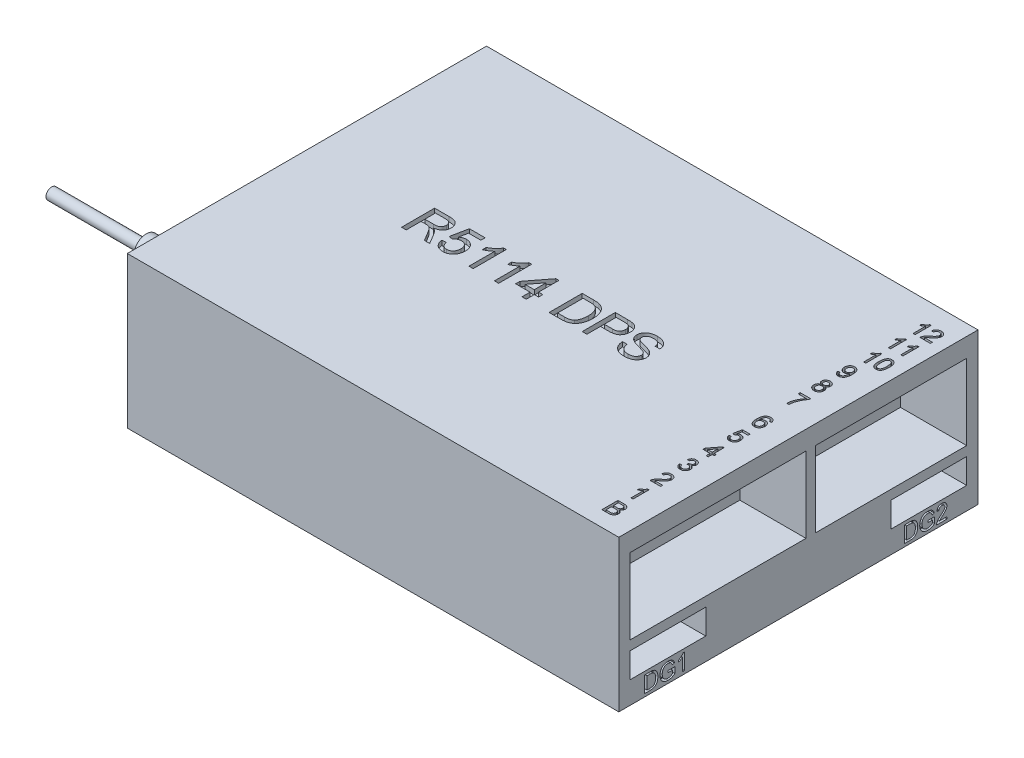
from build123d import *

# Parameters (mm, degrees)
ESQUISSE1_W             = 52
ESQUISSE1_H             = 38
EXTRUSION1_DEPTH        = 16
ESQUISSE2_R             = 3
EXTRUSION2_DEPTH        = 1.5
ESQUISSE3_R             = 1.3
EXTRUSION3_DEPTH        = 5.5
ESQUISSE4_R             = 0.6
EXTRUSION4_DEPTH        = 10
ESQUISSE5_W             = 18.6
ESQUISSE5_H             = 8
ESQUISSE5_W_2           = 16
ESQUISSE5_W_3           = 8
ESQUISSE5_H_2           = 2.65
EXTRUSION5_DEPTH        = 7
ENL_V_MAT_EXTRU_1_DEPTH = 0.5
ENL_V_MAT_EXTRU_2_DEPTH = 0.5
EXTRUSION6_DEPTH        = 0.5
EXTRUSION7_DEPTH        = 0.5
EXTRUSION8_DEPTH        = 0.5


with BuildPart() as part:
    # Esquisse1 → Extrusion1 (new body)
    with BuildSketch(Plane(origin=(0, 0, 0), x_dir=(1, 0, 0), z_dir=(0, 1, 0))):
        with Locations((26, 19)):
            Rectangle(ESQUISSE1_W, ESQUISSE1_H)
    extrude(amount=EXTRUSION1_DEPTH)

    # Esquisse2 → Extrusion2 (add)
    with BuildSketch(Plane.ZY):
        with Locations(Location((-9, 8.5, 0), (0, 0, 180))):
            Circle(ESQUISSE2_R)
    extrude(amount=EXTRUSION2_DEPTH)

    # Esquisse3 → Extrusion3 (add)
    with BuildSketch(Plane.ZY.offset(1.5)):
        with Locations((-9, 8.5)):
            Circle(ESQUISSE3_R)
    extrude(amount=EXTRUSION3_DEPTH)

    # Esquisse4 → Extrusion4 (add)
    with BuildSketch(Plane.ZY.offset(7)):
        with Locations((-9, 8.5)):
            Circle(ESQUISSE4_R)
    extrude(amount=EXTRUSION4_DEPTH)

    # Esquisse5 → Extrusion5 (cut)
    with BuildSketch(Plane(origin=(52, 0, 0), x_dir=(0, 0, -1), z_dir=(1, 0, 0))):
        with Locations((10.5, 10)):
            Rectangle(ESQUISSE5_W, ESQUISSE5_H)
        with Locations((28.8, 10)):
            Rectangle(ESQUISSE5_W_2, ESQUISSE5_H)
        with Locations((5.2, 3.675)):
            Rectangle(ESQUISSE5_W_3, ESQUISSE5_H_2)
        with Locations((32.8, 3.675)):
            Rectangle(ESQUISSE5_W_3, ESQUISSE5_H_2)
    extrude(amount=-EXTRUSION5_DEPTH, mode=Mode.SUBTRACT)

    # Esquisse6 → Enl_v. mat.-Extru.1 (cut)
    # profile 1 of 7: a face of its own
    with BuildSketch(Plane(origin=(0, 16, 0), x_dir=(1, 0, 0), z_dir=(0, 1, 0))):
        with BuildLine():
            Line((49.557685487, 18.592072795), (49.339736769, 18.570277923))
            add(Edge.make_bspline(
                [(49.339736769, 18.570277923), (49.335033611, 18.589022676), (49.32618064, 18.624306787), (49.307616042, 18.672164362), (49.287158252, 18.71264373), (49.269384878, 18.734440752), (49.261070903, 18.744636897)],
                knots=[0, 0, 0, 0, 1.199207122, 2.257322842, 3.184815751, 4, 4, 4, 4], degree=3))
            add(Edge.make_bspline(
                [(49.261070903, 18.744636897), (49.253934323, 18.751591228), (49.239898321, 18.765268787), (49.216856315, 18.783097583), (49.192566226, 18.798203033), (49.166954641, 18.810440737), (49.140159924, 18.820107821), (49.112071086, 18.826870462), (49.082751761, 18.83105692), (49.062774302, 18.831561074), (49.052657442, 18.831816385)],
                knots=[0, 0, 0, 0, 1.028360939, 2.022547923, 3.001693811, 3.976902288, 4.948369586, 5.937776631, 6.955661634, 8, 8, 8, 8], degree=3))
            add(Edge.make_bspline(
                [(49.052657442, 18.831816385), (49.03625627, 18.831288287), (49.003848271, 18.83024479), (48.956299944, 18.82002903), (48.910117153, 18.804739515), (48.881505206, 18.78924044), (48.867060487, 18.781415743)],
                knots=[0, 0, 0, 0, 1.010336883, 1.996381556, 2.988474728, 4, 4, 4, 4], degree=3))
            add(Edge.make_bspline(
                [(48.867060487, 18.781415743), (48.852855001, 18.769646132), (48.823694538, 18.745485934), (48.785639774, 18.700842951), (48.751607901, 18.648865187), (48.72650878, 18.600339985), (48.708844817, 18.556832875), (48.697420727, 18.519545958), (48.687660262, 18.478351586), (48.679529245, 18.433327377), (48.673240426, 18.384436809), (48.667984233, 18.33164883), (48.665077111, 18.274829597), (48.664429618, 18.235638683), (48.664095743, 18.215430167)],
                knots=[0, 0, 0, 0, 1.063306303, 2.18271343, 3.369442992, 4.644240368, 5.329284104, 6.077448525, 6.892756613, 7.771869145, 8.717113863, 9.73749892, 10.833357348, 12, 12, 12, 12], degree=3))
            add(Edge.make_bspline(
                [(48.664095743, 18.215430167), (48.676945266, 18.233483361), (48.70209899, 18.268823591), (48.746472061, 18.315051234), (48.794925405, 18.354128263), (48.847513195, 18.385328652), (48.902863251, 18.409509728), (48.959755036, 18.426910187), (49.018088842, 18.437591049), (49.057380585, 18.438866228), (49.077176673, 18.439508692)],
                knots=[0, 0, 0, 0, 1.083917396, 2.121834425, 3.126226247, 4.123362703, 5.106535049, 6.077135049, 7.031216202, 8, 8, 8, 8], degree=3))
            add(Edge.make_bspline(
                [(49.077176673, 18.439508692), (49.094225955, 18.439049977), (49.127910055, 18.438143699), (49.177513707, 18.430961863), (49.225068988, 18.418400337), (49.270988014, 18.402036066), (49.314388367, 18.379692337), (49.356329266, 18.353579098), (49.395839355, 18.321802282), (49.433418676, 18.286097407), (49.467633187, 18.246401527), (49.497915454, 18.203677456), (49.523150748, 18.15782279), (49.543613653, 18.109144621), (49.559629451, 18.05782008), (49.571266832, 18.00370342), (49.578079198, 17.946687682), (49.579007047, 17.90770944), (49.579480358, 17.887826)],
                knots=[0, 0, 0, 0, 0.981553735, 1.939246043, 2.877808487, 3.810434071, 4.740031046, 5.683044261, 6.650811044, 7.654063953, 8.664382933, 9.663624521, 10.66421212, 11.671863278, 12.699354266, 13.755775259, 14.855184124, 16, 16, 16, 16], degree=3))
            add(Edge.make_bspline(
                [(49.579480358, 17.887826), (49.578632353, 17.861548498), (49.576958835, 17.809690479), (49.563526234, 17.733322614), (49.541881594, 17.659711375), (49.515989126, 17.601417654), (49.492200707, 17.556758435), (49.472001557, 17.525521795), (49.450402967, 17.496167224), (49.427814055, 17.468290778), (49.402596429, 17.443168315), (49.376278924, 17.41961608), (49.34799165, 17.398448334), (49.318566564, 17.378960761), (49.287447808, 17.362063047), (49.255540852, 17.347047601), (49.222583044, 17.334257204), (49.188467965, 17.324214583), (49.153370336, 17.315906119), (49.117173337, 17.310193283), (49.079972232, 17.306670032), (49.054822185, 17.306341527), (49.042100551, 17.306175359)],
                knots=[0, 0, 0, 0, 1.777979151, 3.508799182, 5.232661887, 6.960203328, 7.816385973, 8.656273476, 9.47551652, 10.283326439, 11.082130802, 11.882412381, 12.672407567, 13.471692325, 14.269609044, 15.067192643, 15.857822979, 16.66013129, 17.472860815, 18.297850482, 19.139002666, 20, 20, 20, 20], degree=3))
            add(Edge.make_bspline(
                [(49.042100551, 17.306175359), (49.020616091, 17.306771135), (48.978481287, 17.307939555), (48.916810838, 17.316915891), (48.858252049, 17.33191661), (48.802680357, 17.352889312), (48.749926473, 17.379366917), (48.700510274, 17.412558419), (48.654158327, 17.451479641), (48.610834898, 17.49635631), (48.571553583, 17.548175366), (48.537982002, 17.607990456), (48.509376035, 17.675277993), (48.48596454, 17.750223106), (48.468248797, 17.832904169), (48.455492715, 17.923143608), (48.447647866, 18.020954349), (48.446659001, 18.088732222), (48.446147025, 18.123823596)],
                knots=[0, 0, 0, 0, 0.898506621, 1.76212948, 2.600594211, 3.422599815, 4.24233914, 5.064166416, 5.906856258, 6.769969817, 7.668413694, 8.619051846, 9.63165591, 10.722000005, 11.898403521, 13.164960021, 14.532183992, 16, 16, 16, 16], degree=3))
            add(Edge.make_bspline(
                [(48.446147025, 18.123823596), (48.446231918, 18.143805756), (48.446399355, 18.183217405), (48.449089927, 18.241221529), (48.452176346, 18.297238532), (48.457464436, 18.35104493), (48.463708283, 18.402882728), (48.472087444, 18.452447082), (48.481085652, 18.500123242), (48.492025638, 18.545535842), (48.504221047, 18.589112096), (48.518258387, 18.630373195), (48.533085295, 18.669852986), (48.549906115, 18.706928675), (48.567833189, 18.742204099), (48.587648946, 18.775026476), (48.608430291, 18.806146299), (48.623771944, 18.825335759), (48.631403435, 18.834881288)],
                knots=[0, 0, 0, 0, 1.28053818, 2.525659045, 3.721026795, 4.875695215, 5.990149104, 7.066600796, 8.096771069, 9.099076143, 10.059445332, 10.995815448, 11.891625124, 12.761078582, 13.603822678, 14.426062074, 15.217066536, 16, 16, 16, 16], degree=3))
            add(Edge.make_bspline(
                [(48.631403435, 18.834881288), (48.645132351, 18.850323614), (48.672193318, 18.880761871), (48.718486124, 18.92008089), (48.767815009, 18.95366538), (48.820966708, 18.980798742), (48.877534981, 19.001952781), (48.937555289, 19.017308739), (49.001195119, 19.026214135), (49.044683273, 19.027375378), (49.066960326, 19.027970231)],
                knots=[0, 0, 0, 0, 1.005002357, 1.980952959, 2.948226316, 3.90482984, 4.879026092, 5.883055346, 6.915583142, 8, 8, 8, 8], degree=3))
            add(Edge.make_bspline(
                [(49.066960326, 19.027970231), (49.083548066, 19.027677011), (49.116136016, 19.027100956), (49.16388568, 19.021573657), (49.209304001, 19.012335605), (49.252492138, 18.999874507), (49.293198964, 18.983287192), (49.331893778, 18.96362943), (49.368183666, 18.939982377), (49.401805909, 18.912669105), (49.432843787, 18.882463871), (49.460643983, 18.849113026), (49.485101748, 18.813032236), (49.506408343, 18.774146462), (49.524373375, 18.732639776), (49.53912356, 18.688333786), (49.550334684, 18.64123988), (49.555201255, 18.608688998), (49.557685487, 18.592072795)],
                knots=[0, 0, 0, 0, 1.095988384, 2.15315746, 3.171326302, 4.156539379, 5.119213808, 6.072133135, 7.021027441, 7.975952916, 8.930907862, 9.879001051, 10.840359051, 11.807350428, 12.805278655, 13.825435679, 14.889953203, 16, 16, 16, 16], degree=3))
        make_face()
        with BuildLine():
            add(Edge.make_bspline(
                [(48.664095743, 17.892253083), (48.664701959, 17.875187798), (48.665906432, 17.841281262), (48.675119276, 17.790952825), (48.690164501, 17.74184826), (48.710784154, 17.694512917), (48.736245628, 17.650533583), (48.766487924, 17.611564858), (48.800854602, 17.5781789), (48.83916097, 17.550303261), (48.88131711, 17.528881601), (48.926567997, 17.51336675), (48.974967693, 17.503989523), (49.008344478, 17.502891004), (49.025413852, 17.502329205)],
                knots=[0, 0, 0, 0, 1.034121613, 2.054667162, 3.090870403, 4.141799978, 5.178094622, 6.163726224, 7.122467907, 8.07367165, 9.024701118, 9.977919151, 10.965878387, 12, 12, 12, 12], degree=3))
            add(Edge.make_bspline(
                [(49.025413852, 17.502329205), (49.037577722, 17.502658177), (49.06132052, 17.5033003), (49.096083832, 17.50827611), (49.129251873, 17.515927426), (49.160632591, 17.527232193), (49.190183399, 17.541660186), (49.218057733, 17.55922), (49.244237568, 17.579964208), (49.268406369, 17.603854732), (49.290249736, 17.630425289), (49.309228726, 17.659512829), (49.325988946, 17.690638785), (49.338595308, 17.724568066), (49.348867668, 17.760431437), (49.356419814, 17.798567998), (49.360853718, 17.839021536), (49.361302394, 17.866814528), (49.361531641, 17.881015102)],
                knots=[0, 0, 0, 0, 1.023436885, 1.997658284, 2.950132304, 3.883974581, 4.798406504, 5.712938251, 6.651509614, 7.604127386, 8.56812849, 9.540661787, 10.523651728, 11.536824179, 12.580180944, 13.661349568, 14.805088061, 16, 16, 16, 16], degree=3))
            add(Edge.make_bspline(
                [(49.361531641, 17.881015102), (49.361319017, 17.894651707), (49.360903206, 17.921319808), (49.356224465, 17.960234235), (49.349408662, 17.997022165), (49.338945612, 18.031374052), (49.32610401, 18.063653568), (49.310013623, 18.093619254), (49.291265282, 18.12152579), (49.269283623, 18.146634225), (49.245245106, 18.169509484), (49.218844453, 18.189378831), (49.190398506, 18.206159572), (49.159804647, 18.219897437), (49.127005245, 18.230425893), (49.09206822, 18.237722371), (49.055190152, 18.242815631), (49.029859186, 18.243172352), (49.01690023, 18.243354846)],
                knots=[0, 0, 0, 0, 1.155658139, 2.260035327, 3.319019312, 4.323913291, 5.299809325, 6.260058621, 7.202437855, 8.144128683, 9.083751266, 10.011616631, 10.939332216, 11.87851101, 12.849505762, 13.853846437, 14.90205895, 16, 16, 16, 16], degree=3))
            add(Edge.make_bspline(
                [(49.01690023, 18.243354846), (49.004848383, 18.243166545), (48.981099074, 18.242795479), (48.94627051, 18.237662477), (48.912702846, 18.230351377), (48.880530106, 18.219714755), (48.84974122, 18.206016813), (48.820343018, 18.189354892), (48.792590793, 18.169251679), (48.766231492, 18.146738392), (48.742178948, 18.121729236), (48.721076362, 18.094672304), (48.703864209, 18.065393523), (48.688817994, 18.034609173), (48.677794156, 18.001593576), (48.669950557, 17.966789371), (48.665087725, 17.930190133), (48.664431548, 17.905095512), (48.664095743, 17.892253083)],
                knots=[0, 0, 0, 0, 1.036988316, 2.04348404, 3.025371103, 3.992992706, 4.955812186, 5.923433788, 6.897355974, 7.902569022, 8.905116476, 9.880852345, 10.849905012, 11.825004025, 12.826645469, 13.839294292, 14.894236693, 16, 16, 16, 16], degree=3))
        make_face(mode=Mode.SUBTRACT)
    # profile 2 of 7: a face of its own
    with BuildSketch(Plane(origin=(0, 16, 0), x_dir=(1, 0, 0), z_dir=(0, 1, 0))):
        with BuildLine():
            Line((48.489736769, 15.170277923), (48.707685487, 15.192072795))
            add(Edge.make_bspline(
                [(48.707685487, 15.192072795), (48.709843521, 15.179792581), (48.714041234, 15.155905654), (48.722040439, 15.12132862), (48.73242913, 15.089205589), (48.744101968, 15.059258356), (48.757977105, 15.031803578), (48.773010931, 15.006407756), (48.790740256, 14.983972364), (48.809380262, 14.96332401), (48.829839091, 14.945129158), (48.852314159, 14.92979027), (48.876178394, 14.916408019), (48.901722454, 14.905451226), (48.92898549, 14.897431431), (48.957620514, 14.89108915), (48.987996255, 14.887893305), (49.008721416, 14.887264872), (49.019284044, 14.88694459)],
                knots=[0, 0, 0, 0, 1.237781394, 2.407677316, 3.51963579, 4.58689595, 5.594855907, 6.570874, 7.510833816, 8.428091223, 9.330271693, 10.221190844, 11.124215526, 12.043132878, 12.973586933, 13.941700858, 14.950982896, 16, 16, 16, 16], degree=3))
            add(Edge.make_bspline(
                [(49.019284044, 14.88694459), (49.032242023, 14.887257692), (49.057581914, 14.887869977), (49.094446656, 14.893048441), (49.12926839, 14.901587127), (49.1618805, 14.913536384), (49.1926653, 14.928396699), (49.220601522, 14.947638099), (49.247212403, 14.969267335), (49.270785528, 14.995053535), (49.292243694, 15.023126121), (49.310763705, 15.053768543), (49.326354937, 15.08655071), (49.339481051, 15.121466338), (49.349173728, 15.158714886), (49.356303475, 15.1980982), (49.360880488, 15.239641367), (49.361311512, 15.268115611), (49.361531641, 15.282657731)],
                knots=[0, 0, 0, 0, 1.052816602, 2.058828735, 3.018813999, 3.961574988, 4.877590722, 5.788574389, 6.712363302, 7.658909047, 8.620312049, 9.580784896, 10.562948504, 11.56722449, 12.607883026, 13.686460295, 14.818448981, 16, 16, 16, 16], degree=3))
            add(Edge.make_bspline(
                [(49.361531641, 15.282657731), (49.361281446, 15.296516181), (49.360794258, 15.323501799), (49.356691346, 15.362797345), (49.349769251, 15.39974705), (49.340812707, 15.434758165), (49.328467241, 15.467283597), (49.313824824, 15.497794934), (49.295887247, 15.525644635), (49.275930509, 15.551699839), (49.253137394, 15.575057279), (49.227199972, 15.59477968), (49.199135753, 15.612040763), (49.168379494, 15.626038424), (49.134913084, 15.636438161), (49.099069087, 15.644439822), (49.060475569, 15.648648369), (49.033936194, 15.64938617), (49.020305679, 15.649765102)],
                knots=[0, 0, 0, 0, 1.165854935, 2.270189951, 3.319242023, 4.32700288, 5.306253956, 6.24172124, 7.169108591, 8.088047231, 8.999810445, 9.905349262, 10.822648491, 11.767237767, 12.739852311, 13.766490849, 14.852878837, 16, 16, 16, 16], degree=3))
            add(Edge.make_bspline(
                [(49.020305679, 15.649765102), (49.003356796, 15.649269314), (48.970852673, 15.648318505), (48.924147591, 15.640319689), (48.881630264, 15.627398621), (48.843782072, 15.60814134), (48.809966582, 15.585135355), (48.779481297, 15.559103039), (48.752074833, 15.530061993), (48.737041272, 15.508197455), (48.729480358, 15.497201)],
                knots=[0, 0, 0, 0, 1.182877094, 2.268490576, 3.298955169, 4.273890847, 5.221533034, 6.149304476, 7.069219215, 8, 8, 8, 8], degree=3))
            Line((48.729480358, 15.497201), (48.511531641, 15.518995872))
            Line((48.511531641, 15.518995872), (48.685890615, 16.390790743))
            Line((48.685890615, 16.390790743), (49.492300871, 16.390790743))
            Line((49.492300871, 16.390790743), (49.492300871, 16.172842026))
            Line((49.492300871, 16.172842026), (48.863995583, 16.172842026))
            Line((48.863995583, 16.172842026), (48.777497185, 15.732517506))
            add(Edge.make_bspline(
                [(48.777497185, 15.732517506), (48.789523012, 15.741541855), (48.813139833, 15.759264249), (48.849977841, 15.782469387), (48.887342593, 15.802029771), (48.925016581, 15.818048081), (48.963299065, 15.830526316), (49.00195903, 15.839195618), (49.041128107, 15.845054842), (49.067393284, 15.845630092), (49.080582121, 15.845918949)],
                knots=[0, 0, 0, 0, 1.093835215, 2.148119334, 3.164235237, 4.159999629, 5.123971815, 6.089888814, 7.040853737, 8, 8, 8, 8], degree=3))
            add(Edge.make_bspline(
                [(49.080582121, 15.845918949), (49.097746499, 15.845469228), (49.131547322, 15.84458362), (49.181354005, 15.837307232), (49.228977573, 15.824955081), (49.27479158, 15.808318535), (49.318191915, 15.786263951), (49.359618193, 15.759560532), (49.398903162, 15.727988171), (49.435824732, 15.692142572), (49.469314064, 15.652350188), (49.499288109, 15.609908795), (49.523769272, 15.563968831), (49.54435961, 15.515729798), (49.559889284, 15.464399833), (49.571676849, 15.410707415), (49.577979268, 15.353981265), (49.578972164, 15.315363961), (49.579480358, 15.295598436)],
                knots=[0, 0, 0, 0, 0.991958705, 1.953407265, 2.902004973, 3.832128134, 4.765371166, 5.71007953, 6.676509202, 7.674246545, 8.68000108, 9.679398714, 10.671856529, 11.683459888, 12.706765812, 13.76733029, 14.85725088, 16, 16, 16, 16], degree=3))
            add(Edge.make_bspline(
                [(49.579480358, 15.295598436), (49.579094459, 15.276738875), (49.578332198, 15.239485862), (49.572085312, 15.18458666), (49.561795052, 15.131686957), (49.548019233, 15.080630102), (49.529406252, 15.031706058), (49.506830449, 14.984756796), (49.480787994, 14.939292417), (49.459903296, 14.911266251), (49.449392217, 14.897160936)],
                knots=[0, 0, 0, 0, 1.059692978, 2.093196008, 3.100373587, 4.086253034, 5.061402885, 6.037282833, 7.012182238, 8, 8, 8, 8], degree=3))
            add(Edge.make_bspline(
                [(49.449392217, 14.897160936), (49.436038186, 14.880695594), (49.409769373, 14.848306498), (49.36428521, 14.80626739), (49.31538909, 14.770539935), (49.262790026, 14.741513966), (49.206841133, 14.718189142), (49.146855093, 14.702667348), (49.083556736, 14.692243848), (49.040101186, 14.691281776), (49.017921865, 14.690790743)],
                knots=[0, 0, 0, 0, 1.023140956, 2.012628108, 2.982342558, 3.942221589, 4.908720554, 5.902469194, 6.929439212, 8, 8, 8, 8], degree=3))
            add(Edge.make_bspline(
                [(49.017921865, 14.690790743), (48.999627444, 14.691161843), (48.963839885, 14.691887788), (48.911440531, 14.698198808), (48.861602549, 14.70826266), (48.814310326, 14.722697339), (48.769421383, 14.740936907), (48.727457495, 14.764107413), (48.687690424, 14.790613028), (48.650994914, 14.821270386), (48.617560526, 14.855465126), (48.587602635, 14.892472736), (48.561526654, 14.932317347), (48.539345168, 14.974760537), (48.520857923, 15.019761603), (48.50671445, 15.067627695), (48.495511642, 15.117889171), (48.49168191, 15.152631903), (48.489736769, 15.170277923)],
                knots=[0, 0, 0, 0, 1.108768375, 2.168973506, 3.19473529, 4.187459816, 5.162590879, 6.12651078, 7.088512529, 8.056012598, 9.019588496, 9.983680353, 10.938070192, 11.90157236, 12.88306954, 13.882379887, 14.924449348, 16, 16, 16, 16], degree=3))
        make_face()
    # profile 3 of 7: a face of its own
    with BuildSketch(Plane(origin=(0, 16, 0), x_dir=(1, 0, 0), z_dir=(0, 1, 0))):
        Polygon((49.143582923, 12.097201), (49.143582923, 12.511303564), (48.402557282, 12.511303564), (48.402557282, 12.729252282), (49.208967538, 13.775406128), (49.361531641, 13.775406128), (49.361531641, 12.729252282), (49.579480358, 12.729252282), (49.579480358, 12.511303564), (49.361531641, 12.511303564), (49.361531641, 12.097201), align=None)
        Polygon((49.143582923, 12.729252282), (49.143582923, 13.341551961), (48.67158773, 12.729252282), align=None, mode=Mode.SUBTRACT)
    # profile 4 of 7: a face of its own
    with BuildSketch(Plane(origin=(0, 16, 0), x_dir=(1, 0, 0), z_dir=(0, 1, 0))):
        with BuildLine():
            Line((48.489736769, 9.939508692), (48.707685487, 9.961303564))
            add(Edge.make_bspline(
                [(48.707685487, 9.961303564), (48.710591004, 9.948207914), (48.716212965, 9.922868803), (48.727030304, 9.886567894), (48.738455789, 9.852872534), (48.752619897, 9.822536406), (48.766440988, 9.794318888), (48.782682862, 9.769385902), (48.80003762, 9.747086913), (48.818826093, 9.727504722), (48.839264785, 9.710642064), (48.861081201, 9.695886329), (48.884736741, 9.683563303), (48.91005029, 9.673806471), (48.936808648, 9.665908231), (48.965157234, 9.660108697), (48.99524595, 9.656653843), (49.015869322, 9.656337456), (49.026435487, 9.656175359)],
                knots=[0, 0, 0, 0, 1.321063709, 2.556160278, 3.730472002, 4.821700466, 5.852032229, 6.822994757, 7.746964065, 8.632786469, 9.490489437, 10.352773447, 11.223141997, 12.11199479, 13.021433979, 13.96892724, 14.959401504, 16, 16, 16, 16], degree=3))
            add(Edge.make_bspline(
                [(49.026435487, 9.656175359), (49.038829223, 9.656352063), (49.063034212, 9.656697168), (49.098304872, 9.661875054), (49.131871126, 9.668984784), (49.16325407, 9.680133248), (49.192890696, 9.693758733), (49.220612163, 9.710596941), (49.246608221, 9.730369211), (49.270366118, 9.753210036), (49.291612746, 9.778335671), (49.310535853, 9.804874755), (49.326182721, 9.833053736), (49.339370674, 9.862475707), (49.349105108, 9.893616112), (49.356231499, 9.926086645), (49.360888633, 9.960034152), (49.361314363, 9.983196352), (49.361531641, 9.995017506)],
                knots=[0, 0, 0, 0, 1.111377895, 2.170522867, 3.193923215, 4.186422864, 5.152846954, 6.117443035, 7.091571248, 8.078879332, 9.069127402, 10.041602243, 10.999610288, 11.957618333, 12.930786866, 13.922135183, 14.939532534, 16, 16, 16, 16], degree=3))
            add(Edge.make_bspline(
                [(49.361531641, 9.995017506), (49.361276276, 10.00626714), (49.360776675, 10.02827615), (49.356669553, 10.060580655), (49.349502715, 10.091246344), (49.339567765, 10.12045069), (49.326872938, 10.148150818), (49.311614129, 10.174575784), (49.292951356, 10.199146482), (49.271944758, 10.222126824), (49.249032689, 10.243298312), (49.223958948, 10.261307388), (49.19757195, 10.276849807), (49.169557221, 10.289399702), (49.140031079, 10.299360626), (49.109021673, 10.306519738), (49.076379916, 10.310628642), (49.054144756, 10.31112833), (49.042781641, 10.311383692)],
                knots=[0, 0, 0, 0, 1.072815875, 2.098878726, 3.09954706, 4.07199174, 5.036203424, 6.001873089, 6.97636515, 7.972747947, 8.969130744, 9.945905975, 10.911575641, 11.885646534, 12.868345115, 13.879560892, 14.916365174, 16, 16, 16, 16], degree=3))
            add(Edge.make_bspline(
                [(49.042781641, 10.311383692), (49.032777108, 10.311118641), (49.011545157, 10.310556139), (48.978034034, 10.305589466), (48.940914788, 10.29863496), (48.91526433, 10.291810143), (48.901796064, 10.288226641)],
                knots=[0, 0, 0, 0, 0.837610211, 1.777604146, 2.833088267, 4, 4, 4, 4], degree=3))
            Line((48.901796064, 10.288226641), (48.924272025, 10.484380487))
            add(Edge.make_bspline(
                [(48.924272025, 10.484380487), (48.930169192, 10.483736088), (48.940587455, 10.482597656), (48.951058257, 10.482178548), (48.955602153, 10.481996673)],
                knots=[0, 0, 0, 0, 1.132082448, 2, 2, 2, 2], degree=3))
            add(Edge.make_bspline(
                [(48.955602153, 10.481996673), (48.975646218, 10.482761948), (49.014966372, 10.484263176), (49.072287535, 10.496737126), (49.126611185, 10.516376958), (49.168579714, 10.539810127), (49.199702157, 10.561850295), (49.219327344, 10.581722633), (49.237020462, 10.602811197), (49.250220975, 10.627000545), (49.261625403, 10.652702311), (49.268687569, 10.680928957), (49.273837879, 10.710994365), (49.274177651, 10.731818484), (49.274352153, 10.7425135)],
                knots=[0, 0, 0, 0, 1.557468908, 3.055264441, 4.54122591, 6.035034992, 6.780215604, 7.498173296, 8.201377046, 8.913174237, 9.633083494, 10.382644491, 11.169345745, 12, 12, 12, 12], degree=3))
            add(Edge.make_bspline(
                [(49.274352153, 10.7425135), (49.2741911, 10.751152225), (49.273876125, 10.768047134), (49.270367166, 10.792816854), (49.264563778, 10.816286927), (49.256719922, 10.838707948), (49.24643977, 10.859962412), (49.233691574, 10.8800243), (49.219126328, 10.899300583), (49.20193257, 10.916795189), (49.183519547, 10.933220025), (49.163215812, 10.947053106), (49.141987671, 10.959341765), (49.119086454, 10.968627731), (49.09507754, 10.976262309), (49.069755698, 10.981612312), (49.043111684, 10.985205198), (49.024858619, 10.985507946), (49.015538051, 10.985662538)],
                knots=[0, 0, 0, 0, 1.041493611, 2.036867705, 3.009952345, 3.954088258, 4.897230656, 5.850851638, 6.817653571, 7.805463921, 8.805067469, 9.788883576, 10.763797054, 11.758134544, 12.762883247, 13.799594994, 14.876406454, 16, 16, 16, 16], degree=3))
            add(Edge.make_bspline(
                [(49.015538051, 10.985662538), (48.997297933, 10.984951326), (48.962073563, 10.98357787), (48.911642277, 10.97087055), (48.865942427, 10.950308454), (48.832108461, 10.926194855), (48.80808337, 10.903140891), (48.79167296, 10.883599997), (48.776994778, 10.862021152), (48.764007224, 10.838412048), (48.752885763, 10.812677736), (48.742860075, 10.785137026), (48.735099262, 10.755348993), (48.731385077, 10.734708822), (48.729480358, 10.724124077)],
                knots=[0, 0, 0, 0, 1.533565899, 2.961543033, 4.347411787, 5.731829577, 6.434842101, 7.147085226, 7.87612511, 8.629021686, 9.412189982, 10.234506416, 11.094615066, 12, 12, 12, 12], degree=3))
            Line((48.729480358, 10.724124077), (48.511531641, 10.745918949))
            add(Edge.make_bspline(
                [(48.511531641, 10.745918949), (48.514941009, 10.762770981), (48.521628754, 10.795827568), (48.535253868, 10.843570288), (48.551869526, 10.888387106), (48.571819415, 10.930072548), (48.59416104, 10.969125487), (48.619933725, 11.005082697), (48.648533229, 11.038157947), (48.680010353, 11.068250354), (48.713937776, 11.095126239), (48.750144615, 11.118310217), (48.788333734, 11.137961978), (48.828540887, 11.153804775), (48.870734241, 11.16668737), (48.915033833, 11.17522212), (48.961239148, 11.180995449), (48.992703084, 11.181539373), (49.008727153, 11.181816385)],
                knots=[0, 0, 0, 0, 1.136581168, 2.229493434, 3.279335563, 4.293305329, 5.282068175, 6.250623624, 7.213783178, 8.169396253, 9.125981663, 10.071280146, 11.007896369, 11.961295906, 12.925420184, 13.920544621, 14.940967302, 16, 16, 16, 16], degree=3))
            add(Edge.make_bspline(
                [(49.008727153, 11.181816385), (49.03090828, 11.181097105), (49.074523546, 11.179682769), (49.138584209, 11.168449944), (49.199857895, 11.150016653), (49.25785154, 11.124464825), (49.311567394, 11.093241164), (49.359101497, 11.055821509), (49.399818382, 11.012853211), (49.432927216, 10.964806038), (49.459144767, 10.913650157), (49.478544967, 10.860548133), (49.490136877, 10.805561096), (49.491578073, 10.768334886), (49.492300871, 10.749664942)],
                knots=[0, 0, 0, 0, 1.104647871, 2.172094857, 3.229560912, 4.285649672, 5.322588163, 6.317201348, 7.289435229, 8.260615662, 9.214246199, 10.146367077, 11.070353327, 12, 12, 12, 12], degree=3))
            add(Edge.make_bspline(
                [(49.492300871, 10.749664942), (49.491568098, 10.732016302), (49.490121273, 10.697169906), (49.478982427, 10.646218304), (49.460159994, 10.59794739), (49.434719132, 10.552187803), (49.401728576, 10.509929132), (49.361278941, 10.472272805), (49.314017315, 10.438858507), (49.278598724, 10.421466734), (49.260389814, 10.412525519)],
                knots=[0, 0, 0, 0, 0.975609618, 1.926294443, 2.868398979, 3.832526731, 4.812148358, 5.820404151, 6.879456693, 8, 8, 8, 8], degree=3))
            add(Edge.make_bspline(
                [(49.260389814, 10.412525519), (49.272597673, 10.409443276), (49.296509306, 10.403406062), (49.330851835, 10.390897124), (49.363137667, 10.376252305), (49.393796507, 10.359665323), (49.42193827, 10.340048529), (49.448532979, 10.318599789), (49.472575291, 10.294286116), (49.494761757, 10.267974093), (49.514948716, 10.239939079), (49.53193624, 10.209635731), (49.54659598, 10.177860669), (49.559096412, 10.144383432), (49.568079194, 10.108945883), (49.574502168, 10.071822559), (49.578740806, 10.033142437), (49.579231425, 10.006720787), (49.579480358, 9.993314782)],
                knots=[0, 0, 0, 0, 1.053251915, 2.063013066, 3.05373318, 4.018979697, 4.975584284, 5.920798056, 6.874756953, 7.832116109, 8.799604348, 9.761196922, 10.734637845, 11.72654167, 12.747371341, 13.789206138, 14.878271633, 16, 16, 16, 16], degree=3))
            add(Edge.make_bspline(
                [(49.579480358, 9.993314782), (49.579065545, 9.97501236), (49.578250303, 9.939042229), (49.570521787, 9.886201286), (49.557891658, 9.83557256), (49.540413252, 9.786984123), (49.518265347, 9.740237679), (49.490473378, 9.695992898), (49.457861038, 9.653890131), (49.420938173, 9.614332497), (49.380485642, 9.577977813), (49.33655574, 9.546498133), (49.290017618, 9.519765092), (49.240795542, 9.49796443), (49.18902, 9.480836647), (49.134639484, 9.468558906), (49.077485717, 9.461343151), (49.038488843, 9.460467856), (49.018602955, 9.460021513)],
                knots=[0, 0, 0, 0, 1.016055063, 1.996874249, 2.958724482, 3.910019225, 4.860394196, 5.826121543, 6.806008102, 7.814207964, 8.82789325, 9.821757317, 10.810247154, 11.803791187, 12.806673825, 13.834534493, 14.895752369, 16, 16, 16, 16], degree=3))
            add(Edge.make_bspline(
                [(49.018602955, 9.460021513), (49.00075702, 9.460357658), (48.965624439, 9.461019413), (48.914197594, 9.467913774), (48.864928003, 9.477697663), (48.818205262, 9.492780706), (48.773486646, 9.511174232), (48.731529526, 9.534705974), (48.69157948, 9.561719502), (48.65438652, 9.592986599), (48.6201572, 9.627497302), (48.589620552, 9.664741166), (48.563398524, 9.704635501), (48.540278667, 9.746583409), (48.521591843, 9.791375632), (48.507041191, 9.838627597), (48.495946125, 9.888163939), (48.491829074, 9.922207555), (48.489736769, 9.939508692)],
                knots=[0, 0, 0, 0, 1.08471039, 2.135426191, 3.150939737, 4.135689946, 5.116584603, 6.086901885, 7.055842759, 8.045878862, 9.036901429, 10.008421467, 10.96965771, 11.936653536, 12.917548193, 13.915472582, 14.940632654, 16, 16, 16, 16], degree=3))
        make_face()
    # profile 5 of 7: a face of its own
    with BuildSketch(Plane(origin=(0, 16, 0), x_dir=(1, 0, 0), z_dir=(0, 1, 0))):
        with BuildLine():
            Line((49.557685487, 7.084380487), (49.557685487, 6.866431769))
            Line((49.557685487, 6.866431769), (48.446147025, 6.866431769))
            add(Edge.make_bspline(
                [(48.446147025, 6.866431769), (48.446124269, 6.879385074), (48.446078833, 6.905248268), (48.450455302, 6.94349829), (48.457309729, 6.981240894), (48.465060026, 7.005443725), (48.468963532, 7.017633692)],
                knots=[0, 0, 0, 0, 1.01057331, 2.01775941, 3.001627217, 4, 4, 4, 4], degree=3))
            add(Edge.make_bspline(
                [(48.468963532, 7.017633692), (48.47617591, 7.037550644), (48.490861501, 7.078104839), (48.520614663, 7.136618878), (48.555611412, 7.194779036), (48.589685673, 7.242129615), (48.620890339, 7.279959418), (48.647059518, 7.309556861), (48.676059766, 7.339853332), (48.707867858, 7.370843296), (48.74217766, 7.402727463), (48.779035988, 7.435612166), (48.818878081, 7.468884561), (48.846692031, 7.49093889), (48.860930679, 7.502229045)],
                knots=[0, 0, 0, 0, 1.204657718, 2.452881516, 3.728232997, 5.065887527, 5.768225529, 6.518857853, 7.313994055, 8.154655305, 9.046094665, 9.979688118, 10.965752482, 12, 12, 12, 12], degree=3))
            add(Edge.make_bspline(
                [(48.860930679, 7.502229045), (48.882804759, 7.520640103), (48.924924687, 7.556091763), (48.984404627, 7.608698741), (49.03872987, 7.657547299), (49.087035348, 7.70349361), (49.129716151, 7.746092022), (49.166872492, 7.785246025), (49.198824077, 7.820833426), (49.225180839, 7.854142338), (49.247418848, 7.885595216), (49.266263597, 7.916275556), (49.281968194, 7.946719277), (49.295048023, 7.976830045), (49.305393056, 8.00673663), (49.312444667, 8.036526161), (49.317226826, 8.065903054), (49.317705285, 8.085450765), (49.317941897, 8.095117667)],
                knots=[0, 0, 0, 0, 1.782554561, 3.432421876, 4.950675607, 6.337395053, 7.588547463, 8.709982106, 9.702713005, 10.569305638, 11.356701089, 12.103210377, 12.812277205, 13.490692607, 14.148717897, 14.782152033, 15.397739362, 16, 16, 16, 16], degree=3))
            add(Edge.make_bspline(
                [(49.317941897, 8.095117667), (49.317705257, 8.104671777), (49.317240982, 8.123416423), (49.312835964, 8.150849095), (49.306703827, 8.177267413), (49.296790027, 8.20219579), (49.28498962, 8.226372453), (49.26985275, 8.249033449), (49.252342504, 8.270743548), (49.232294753, 8.290930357), (49.210397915, 8.309868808), (49.185931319, 8.32561126), (49.160501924, 8.339784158), (49.133232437, 8.351179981), (49.104167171, 8.359548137), (49.073517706, 8.365621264), (49.041288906, 8.369471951), (49.019295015, 8.370005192), (49.008046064, 8.370277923)],
                knots=[0, 0, 0, 0, 0.988194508, 1.938783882, 2.870742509, 3.789494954, 4.709148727, 5.651055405, 6.603531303, 7.592354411, 8.592907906, 9.593461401, 10.59787167, 11.603930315, 12.645063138, 13.723588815, 14.835711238, 16, 16, 16, 16], degree=3))
            add(Edge.make_bspline(
                [(49.008046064, 8.370277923), (48.996229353, 8.370006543), (48.973103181, 8.369475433), (48.939298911, 8.365609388), (48.907207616, 8.359702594), (48.876905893, 8.350671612), (48.848430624, 8.339294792), (48.821897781, 8.324974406), (48.796882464, 8.30880928), (48.7741725, 8.289670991), (48.753636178, 8.268450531), (48.735404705, 8.24534787), (48.720466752, 8.219917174), (48.708130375, 8.192717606), (48.698210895, 8.163663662), (48.69100969, 8.13253323), (48.687083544, 8.099416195), (48.686294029, 8.076737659), (48.685890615, 8.065149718)],
                knots=[0, 0, 0, 0, 1.131143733, 2.213731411, 3.253917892, 4.251203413, 5.236093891, 6.184197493, 7.13373276, 8.082770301, 9.020476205, 9.957489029, 10.893177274, 11.836722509, 12.812818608, 13.827831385, 14.890097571, 16, 16, 16, 16], degree=3))
            Line((48.685890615, 8.065149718), (48.467941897, 8.08694459))
            add(Edge.make_bspline(
                [(48.467941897, 8.08694459), (48.470171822, 8.105939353), (48.474509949, 8.14289203), (48.485315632, 8.196411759), (48.500485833, 8.246200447), (48.518638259, 8.292952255), (48.541394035, 8.335871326), (48.567117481, 8.375845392), (48.597457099, 8.411606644), (48.630974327, 8.444282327), (48.668036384, 8.473078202), (48.708295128, 8.498235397), (48.751732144, 8.519277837), (48.798105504, 8.5367001), (48.847521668, 8.54991881), (48.89991073, 8.559397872), (48.95535694, 8.565240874), (48.993388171, 8.56602914), (49.012813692, 8.566431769)],
                knots=[0, 0, 0, 0, 1.130804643, 2.199883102, 3.223565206, 4.205909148, 5.160801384, 6.091796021, 7.01151579, 7.927798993, 8.855738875, 9.7815393, 10.730299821, 11.705391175, 12.706931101, 13.751121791, 14.851322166, 16, 16, 16, 16], degree=3))
            add(Edge.make_bspline(
                [(49.012813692, 8.566431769), (49.032471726, 8.566095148), (49.070765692, 8.565439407), (49.126566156, 8.558729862), (49.179215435, 8.548279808), (49.228906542, 8.533715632), (49.275345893, 8.514617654), (49.318569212, 8.491284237), (49.358775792, 8.463942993), (49.395293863, 8.432265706), (49.428223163, 8.397684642), (49.457080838, 8.360779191), (49.481207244, 8.321707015), (49.501749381, 8.281000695), (49.516986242, 8.237800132), (49.527701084, 8.192692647), (49.534982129, 8.145639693), (49.53558376, 8.113535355), (49.535890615, 8.097160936)],
                knots=[0, 0, 0, 0, 1.195390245, 2.328627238, 3.413424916, 4.457841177, 5.473507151, 6.462241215, 7.441013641, 8.425227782, 9.397253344, 10.342087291, 11.269524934, 12.186751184, 13.110685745, 14.048630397, 15.004728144, 16, 16, 16, 16], degree=3))
            add(Edge.make_bspline(
                [(49.535890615, 8.097160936), (49.535422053, 8.080338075), (49.534483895, 8.046655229), (49.527161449, 7.996309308), (49.514632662, 7.946509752), (49.498022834, 7.896650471), (49.475330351, 7.846533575), (49.446662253, 7.795467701), (49.411096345, 7.743264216), (49.376891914, 7.698885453), (49.345053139, 7.661684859), (49.316831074, 7.631066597), (49.284179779, 7.59853674), (49.248324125, 7.562968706), (49.207801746, 7.525624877), (49.163776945, 7.485386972), (49.115285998, 7.443313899), (49.081623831, 7.414571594), (49.064235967, 7.399725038)],
                knots=[0, 0, 0, 0, 0.927118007, 1.856282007, 2.79721255, 3.754929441, 4.749232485, 5.824981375, 6.979078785, 8.228161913, 8.911614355, 9.677694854, 10.522803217, 11.452009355, 12.461436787, 13.560019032, 14.739651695, 16, 16, 16, 16], degree=3))
            add(Edge.make_bspline(
                [(49.064235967, 7.399725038), (49.049345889, 7.387602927), (49.020952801, 7.364487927), (48.980558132, 7.330977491), (48.944376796, 7.30024933), (48.911562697, 7.273305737), (48.883310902, 7.248843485), (48.858626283, 7.227933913), (48.838405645, 7.209525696), (48.807613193, 7.181563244), (48.768611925, 7.141705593), (48.739874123, 7.102977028), (48.72607491, 7.084380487)],
                knots=[0, 0, 0, 0, 1.241996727, 2.368296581, 3.394949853, 4.3125351, 5.114548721, 5.812230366, 6.404953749, 6.883082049, 8.503329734, 10, 10, 10, 10], degree=3))
            Line((48.72607491, 7.084380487), (49.557685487, 7.084380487))
        make_face()
    # profile 6 of 7: a face of its own
    with BuildSketch(Plane(origin=(0, 16, 0), x_dir=(1, 0, 0), z_dir=(0, 1, 0))):
        with BuildLine():
            Line((49.252557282, 4.251047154), (49.034608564, 4.251047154))
            Line((49.034608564, 4.251047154), (49.034608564, 5.575766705))
            add(Edge.make_bspline(
                [(49.034608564, 5.575766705), (49.022059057, 5.56366425), (48.995976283, 5.538510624), (48.951886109, 5.502911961), (48.902675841, 5.466831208), (48.848984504, 5.43213553), (48.794255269, 5.399473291), (48.741366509, 5.370098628), (48.691201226, 5.345240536), (48.658157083, 5.331648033), (48.642300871, 5.325125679)],
                knots=[0, 0, 0, 0, 0.893362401, 1.856755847, 2.901947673, 4.020460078, 5.132200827, 6.168787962, 7.121294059, 8, 8, 8, 8], degree=3))
            Line((48.642300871, 5.325125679), (48.642300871, 5.526047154))
            add(Edge.make_bspline(
                [(48.642300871, 5.526047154), (48.669535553, 5.540073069), (48.723213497, 5.567717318), (48.799048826, 5.615462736), (48.869849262, 5.667220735), (48.93444278, 5.722979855), (48.992346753, 5.779975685), (49.041143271, 5.837486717), (49.081973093, 5.893404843), (49.102458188, 5.932401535), (49.112252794, 5.951047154)],
                knots=[0, 0, 0, 0, 1.141258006, 2.249351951, 3.335817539, 4.406819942, 5.426913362, 6.360259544, 7.215985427, 8, 8, 8, 8], degree=3))
            Line((49.112252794, 5.951047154), (49.252557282, 5.951047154))
            Line((49.252557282, 5.951047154), (49.252557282, 4.251047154))
        make_face()
    # profile 7 of 7: a face of its own
    with BuildSketch(Plane(origin=(0, 16, 0), x_dir=(1, 0, 0), z_dir=(0, 1, 0))):
        with BuildLine():
            Line((48.576916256, 1.635662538), (48.576916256, 3.335662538))
            Line((48.576916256, 3.335662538), (49.213394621, 3.335662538))
            add(Edge.make_bspline(
                [(49.213394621, 3.335662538), (49.229178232, 3.335601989), (49.259976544, 3.335483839), (49.304948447, 3.332529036), (49.347540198, 3.328487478), (49.387843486, 3.323277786), (49.42568392, 3.31571863), (49.461026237, 3.306561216), (49.494054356, 3.295998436), (49.534426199, 3.2799079), (49.580950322, 3.255141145), (49.630782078, 3.218185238), (49.674137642, 3.173814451), (49.709812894, 3.12294083), (49.739205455, 3.068598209), (49.760044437, 3.011821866), (49.773367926, 2.95384796), (49.774879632, 2.91459215), (49.775634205, 2.894997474)],
                knots=[0, 0, 0, 0, 0.939712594, 1.833646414, 2.682508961, 3.487467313, 4.25240329, 4.978730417, 5.660668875, 6.315918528, 7.564895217, 8.787077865, 9.996481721, 11.241996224, 12.475862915, 13.665015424, 14.834484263, 16, 16, 16, 16], degree=3))
            add(Edge.make_bspline(
                [(49.775634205, 2.894997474), (49.774840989, 2.876767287), (49.773262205, 2.840482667), (49.760696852, 2.787033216), (49.74086488, 2.735134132), (49.71282191, 2.685416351), (49.67697948, 2.63878945), (49.632545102, 2.596831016), (49.580157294, 2.559451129), (49.540840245, 2.53952655), (49.520566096, 2.529252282)],
                knots=[0, 0, 0, 0, 0.926741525, 1.844548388, 2.778836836, 3.746021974, 4.738420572, 5.759761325, 6.844803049, 8, 8, 8, 8], degree=3))
            add(Edge.make_bspline(
                [(49.520566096, 2.529252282), (49.533107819, 2.525326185), (49.55766238, 2.517639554), (49.592962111, 2.503574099), (49.626097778, 2.487558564), (49.657141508, 2.469566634), (49.685883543, 2.449431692), (49.712242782, 2.42712235), (49.73640199, 2.40298384), (49.758318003, 2.377030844), (49.777568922, 2.349430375), (49.794834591, 2.320785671), (49.809091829, 2.290751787), (49.820777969, 2.259406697), (49.829894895, 2.226944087), (49.83644184, 2.193239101), (49.840173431, 2.158370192), (49.840733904, 2.134683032), (49.84101882, 2.122641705)],
                knots=[0, 0, 0, 0, 1.127427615, 2.20731145, 3.257257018, 4.283066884, 5.282973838, 6.264540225, 7.242620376, 8.210460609, 9.17525685, 10.12748095, 11.077310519, 12.023587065, 12.994999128, 13.967387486, 14.966724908, 16, 16, 16, 16], degree=3))
            add(Edge.make_bspline(
                [(49.84101882, 2.122641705), (49.840431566, 2.103309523), (49.839267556, 2.064990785), (49.82991926, 2.008592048), (49.814121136, 1.954341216), (49.792376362, 1.903115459), (49.766466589, 1.855749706), (49.737019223, 1.813484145), (49.704785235, 1.776753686), (49.668856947, 1.745856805), (49.629466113, 1.719634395), (49.585500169, 1.697553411), (49.537299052, 1.678080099), (49.483883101, 1.662524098), (49.42527663, 1.650166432), (49.360684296, 1.642137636), (49.290006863, 1.636390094), (49.240765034, 1.635911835), (49.215097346, 1.635662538)],
                knots=[0, 0, 0, 0, 1.028073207, 2.037766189, 3.031549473, 4.027532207, 4.992436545, 5.898794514, 6.762903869, 7.584966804, 8.412380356, 9.273953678, 10.198004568, 11.174406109, 12.229717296, 13.381036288, 14.634844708, 16, 16, 16, 16], degree=3))
            Line((49.215097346, 1.635662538), (48.576916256, 1.635662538))
        make_face()
        with BuildLine():
            Line((48.816659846, 2.616431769), (49.167080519, 2.616431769))
            add(Edge.make_bspline(
                [(49.167080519, 2.616431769), (49.178547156, 2.616477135), (49.200577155, 2.616564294), (49.232354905, 2.617779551), (49.261684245, 2.618816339), (49.288451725, 2.621418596), (49.312789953, 2.623967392), (49.334601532, 2.627398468), (49.353993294, 2.631264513), (49.365866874, 2.63485056), (49.371407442, 2.636523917)],
                knots=[0, 0, 0, 0, 1.335841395, 2.566453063, 3.705076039, 4.753984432, 5.69893722, 6.555639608, 7.326018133, 8, 8, 8, 8], degree=3))
            add(Edge.make_bspline(
                [(49.371407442, 2.636523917), (49.38442579, 2.641084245), (49.409522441, 2.649875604), (49.443154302, 2.669841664), (49.471798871, 2.693800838), (49.495379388, 2.722176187), (49.513499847, 2.754815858), (49.526935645, 2.791042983), (49.534292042, 2.831363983), (49.535343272, 2.85932518), (49.535890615, 2.873883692)],
                knots=[0, 0, 0, 0, 1.059015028, 2.041559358, 2.989777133, 3.920090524, 4.862499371, 5.848878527, 6.879979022, 8, 8, 8, 8], degree=3))
            add(Edge.make_bspline(
                [(49.535890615, 2.873883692), (49.535450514, 2.887875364), (49.53459281, 2.915143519), (49.527393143, 2.954741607), (49.514934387, 2.991580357), (49.498061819, 3.025651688), (49.476696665, 3.05596303), (49.451196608, 3.082023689), (49.42064934, 3.101724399), (49.392096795, 3.114013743), (49.366416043, 3.121701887), (49.343471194, 3.126250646), (49.31744489, 3.130258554), (49.288251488, 3.133665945), (49.255879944, 3.136310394), (49.220230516, 3.138411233), (49.181388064, 3.139303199), (49.154480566, 3.139438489), (49.140518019, 3.139508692)],
                knots=[0, 0, 0, 0, 1.216168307, 2.37017178, 3.484610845, 4.588286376, 5.664695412, 6.69777344, 7.738183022, 8.803673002, 9.390844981, 10.0665252, 10.835811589, 11.680682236, 12.621801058, 13.660007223, 14.785756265, 16, 16, 16, 16], degree=3))
            Line((49.140518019, 3.139508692), (48.816659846, 3.139508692))
            Line((48.816659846, 3.139508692), (48.816659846, 2.616431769))
        make_face(mode=Mode.SUBTRACT)
        with BuildLine():
            Line((48.816659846, 1.831816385), (49.218843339, 1.831816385))
            add(Edge.make_bspline(
                [(49.218843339, 1.831816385), (49.234849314, 1.832000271), (49.264256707, 1.83233812), (49.304480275, 1.83339797), (49.336993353, 1.835986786), (49.355979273, 1.83877428), (49.364255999, 1.839989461)],
                knots=[0, 0, 0, 0, 1.317581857, 2.420761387, 3.311546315, 4, 4, 4, 4], degree=3))
            add(Edge.make_bspline(
                [(49.364255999, 1.839989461), (49.376122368, 1.842483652), (49.399098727, 1.84731305), (49.431489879, 1.858091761), (49.461188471, 1.87043935), (49.487676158, 1.886131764), (49.51220312, 1.904216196), (49.533518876, 1.926804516), (49.553151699, 1.952468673), (49.570161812, 1.981838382), (49.583916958, 2.014329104), (49.594429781, 2.049438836), (49.600029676, 2.087044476), (49.600854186, 2.11286279), (49.60127523, 2.126047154)],
                knots=[0, 0, 0, 0, 1.067651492, 2.067249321, 3.003744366, 3.895862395, 4.774133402, 5.679610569, 6.621910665, 7.616993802, 8.661192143, 9.724711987, 10.838102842, 12, 12, 12, 12], degree=3))
            add(Edge.make_bspline(
                [(49.60127523, 2.126047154), (49.600806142, 2.141526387), (49.599891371, 2.171712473), (49.59119616, 2.215332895), (49.576833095, 2.25579138), (49.556614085, 2.292527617), (49.531814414, 2.325568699), (49.501809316, 2.353596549), (49.46682315, 2.375838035), (49.42674839, 2.393293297), (49.379909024, 2.405712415), (49.325011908, 2.414138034), (49.261178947, 2.419574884), (49.215564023, 2.420033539), (49.191259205, 2.420277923)],
                knots=[0, 0, 0, 0, 0.96167883, 1.875371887, 2.752872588, 3.621584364, 4.472914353, 5.312011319, 6.159851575, 7.038572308, 8.019870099, 9.164119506, 10.488969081, 12, 12, 12, 12], degree=3))
            Line((49.191259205, 2.420277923), (48.816659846, 2.420277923))
            Line((48.816659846, 2.420277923), (48.816659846, 1.831816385))
        make_face(mode=Mode.SUBTRACT)
    extrude(amount=-ENL_V_MAT_EXTRU_1_DEPTH, mode=Mode.SUBTRACT)

    # Esquisse7 → Enl_v. mat.-Extru.2 (cut)
    # profile 1 of 9: a face of its own
    with BuildSketch(Plane(origin=(0, 16, 0), x_dir=(1, 0, 0), z_dir=(0, 1, 0))):
        with BuildLine():
            Line((49.110365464, 34.240324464), (48.892416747, 34.240324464))
            Line((48.892416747, 34.240324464), (48.892416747, 35.565044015))
            add(Edge.make_bspline(
                [(48.892416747, 35.565044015), (48.87986724, 35.55294156), (48.853784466, 35.527787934), (48.809694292, 35.492189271), (48.760484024, 35.456108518), (48.706792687, 35.42141284), (48.652063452, 35.3887506), (48.599174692, 35.359375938), (48.549009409, 35.334517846), (48.515965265, 35.320925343), (48.500109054, 35.314402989)],
                knots=[0, 0, 0, 0, 0.893362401, 1.856755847, 2.901947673, 4.020460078, 5.132200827, 6.168787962, 7.121294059, 8, 8, 8, 8], degree=3))
            Line((48.500109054, 35.314402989), (48.500109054, 35.515324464))
            add(Edge.make_bspline(
                [(48.500109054, 35.515324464), (48.527343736, 35.529350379), (48.58102168, 35.556994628), (48.656857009, 35.604740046), (48.727657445, 35.656498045), (48.792250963, 35.712257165), (48.850154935, 35.769252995), (48.898951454, 35.826764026), (48.939781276, 35.882682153), (48.960266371, 35.921678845), (48.970060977, 35.940324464)],
                knots=[0, 0, 0, 0, 1.141258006, 2.249351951, 3.335817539, 4.406819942, 5.426913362, 6.360259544, 7.215985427, 8, 8, 8, 8], degree=3))
            Line((48.970060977, 35.940324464), (49.110365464, 35.940324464))
            Line((49.110365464, 35.940324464), (49.110365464, 34.240324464))
        make_face()
    # profile 2 of 9: a face of its own
    with BuildSketch(Plane(origin=(0, 16, 0), x_dir=(1, 0, 0), z_dir=(0, 1, 0))):
        with BuildLine():
            Line((50.723185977, 34.458273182), (50.723185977, 34.240324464))
            Line((50.723185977, 34.240324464), (49.611647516, 34.240324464))
            add(Edge.make_bspline(
                [(49.611647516, 34.240324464), (49.61162476, 34.253277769), (49.611579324, 34.279140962), (49.615955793, 34.317390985), (49.622810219, 34.355133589), (49.630560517, 34.37933642), (49.634464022, 34.391526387)],
                knots=[0, 0, 0, 0, 1.01057331, 2.01775941, 3.001627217, 4, 4, 4, 4], degree=3))
            add(Edge.make_bspline(
                [(49.634464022, 34.391526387), (49.641676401, 34.411443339), (49.656361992, 34.451997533), (49.686115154, 34.510511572), (49.721111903, 34.56867173), (49.755186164, 34.61602231), (49.786390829, 34.653852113), (49.812560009, 34.683449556), (49.841560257, 34.713746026), (49.873368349, 34.74473599), (49.907678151, 34.776620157), (49.944536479, 34.80950486), (49.984378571, 34.842777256), (50.012192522, 34.864831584), (50.02643117, 34.876121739)],
                knots=[0, 0, 0, 0, 1.204657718, 2.452881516, 3.728232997, 5.065887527, 5.768225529, 6.518857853, 7.313994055, 8.154655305, 9.046094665, 9.979688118, 10.965752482, 12, 12, 12, 12], degree=3))
            add(Edge.make_bspline(
                [(50.02643117, 34.876121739), (50.04830525, 34.894532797), (50.090425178, 34.929984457), (50.149905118, 34.982591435), (50.20423036, 35.031439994), (50.252535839, 35.077386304), (50.295216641, 35.119984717), (50.332372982, 35.159138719), (50.364324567, 35.19472612), (50.39068133, 35.228035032), (50.412919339, 35.25948791), (50.431764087, 35.29016825), (50.447468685, 35.320611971), (50.460548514, 35.35072274), (50.470893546, 35.380629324), (50.477945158, 35.410418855), (50.482727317, 35.439795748), (50.483205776, 35.459343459), (50.483442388, 35.469010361)],
                knots=[0, 0, 0, 0, 1.782554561, 3.432421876, 4.950675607, 6.337395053, 7.588547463, 8.709982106, 9.702713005, 10.569305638, 11.356701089, 12.103210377, 12.812277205, 13.490692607, 14.148717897, 14.782152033, 15.397739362, 16, 16, 16, 16], degree=3))
            add(Edge.make_bspline(
                [(50.483442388, 35.469010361), (50.483205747, 35.478564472), (50.482741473, 35.497309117), (50.478336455, 35.524741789), (50.472204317, 35.551160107), (50.462290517, 35.576088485), (50.450490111, 35.600265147), (50.435353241, 35.622926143), (50.417842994, 35.644636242), (50.397795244, 35.664823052), (50.375898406, 35.683761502), (50.351431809, 35.699503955), (50.326002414, 35.713676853), (50.298732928, 35.725072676), (50.269667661, 35.733440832), (50.239018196, 35.739513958), (50.206789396, 35.743364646), (50.184795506, 35.743897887), (50.173546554, 35.744170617)],
                knots=[0, 0, 0, 0, 0.988194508, 1.938783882, 2.870742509, 3.789494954, 4.709148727, 5.651055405, 6.603531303, 7.592354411, 8.592907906, 9.593461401, 10.59787167, 11.603930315, 12.645063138, 13.723588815, 14.835711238, 16, 16, 16, 16], degree=3))
            add(Edge.make_bspline(
                [(50.173546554, 35.744170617), (50.161729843, 35.743899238), (50.138603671, 35.743368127), (50.104799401, 35.739502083), (50.072708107, 35.733595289), (50.042406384, 35.724564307), (50.013931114, 35.713187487), (49.987398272, 35.698867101), (49.962382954, 35.682701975), (49.939672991, 35.663563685), (49.919136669, 35.642343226), (49.900905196, 35.619240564), (49.885967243, 35.593809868), (49.873630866, 35.566610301), (49.863711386, 35.537556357), (49.85651018, 35.506425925), (49.852584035, 35.47330889), (49.85179452, 35.450630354), (49.851391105, 35.439042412)],
                knots=[0, 0, 0, 0, 1.131143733, 2.213731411, 3.253917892, 4.251203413, 5.236093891, 6.184197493, 7.13373276, 8.082770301, 9.020476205, 9.957489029, 10.893177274, 11.836722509, 12.812818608, 13.827831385, 14.890097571, 16, 16, 16, 16], degree=3))
            Line((49.851391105, 35.439042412), (49.633442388, 35.460837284))
            add(Edge.make_bspline(
                [(49.633442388, 35.460837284), (49.635672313, 35.479832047), (49.64001044, 35.516784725), (49.650816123, 35.570304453), (49.665986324, 35.620093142), (49.684138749, 35.66684495), (49.706894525, 35.709764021), (49.732617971, 35.749738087), (49.762957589, 35.785499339), (49.796474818, 35.818175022), (49.833536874, 35.846970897), (49.873795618, 35.872128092), (49.917232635, 35.893170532), (49.963605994, 35.910592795), (50.013022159, 35.923811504), (50.06541122, 35.933290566), (50.120857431, 35.939133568), (50.158888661, 35.939921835), (50.178314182, 35.940324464)],
                knots=[0, 0, 0, 0, 1.130804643, 2.199883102, 3.223565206, 4.205909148, 5.160801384, 6.091796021, 7.01151579, 7.927798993, 8.855738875, 9.7815393, 10.730299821, 11.705391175, 12.706931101, 13.751121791, 14.851322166, 16, 16, 16, 16], degree=3))
            add(Edge.make_bspline(
                [(50.178314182, 35.940324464), (50.197972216, 35.939987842), (50.236266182, 35.939332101), (50.292066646, 35.932622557), (50.344715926, 35.922172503), (50.394407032, 35.907608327), (50.440846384, 35.888510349), (50.484069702, 35.865176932), (50.524276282, 35.837835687), (50.560794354, 35.806158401), (50.593723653, 35.771577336), (50.622581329, 35.734671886), (50.646707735, 35.69559971), (50.667249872, 35.654893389), (50.682486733, 35.611692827), (50.693201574, 35.566585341), (50.70048262, 35.519532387), (50.701084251, 35.48742805), (50.701391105, 35.47105363)],
                knots=[0, 0, 0, 0, 1.195390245, 2.328627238, 3.413424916, 4.457841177, 5.473507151, 6.462241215, 7.441013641, 8.425227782, 9.397253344, 10.342087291, 11.269524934, 12.186751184, 13.110685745, 14.048630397, 15.004728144, 16, 16, 16, 16], degree=3))
            add(Edge.make_bspline(
                [(50.701391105, 35.47105363), (50.700922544, 35.45423077), (50.699984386, 35.420547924), (50.69266194, 35.370202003), (50.680133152, 35.320402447), (50.663523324, 35.270543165), (50.640830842, 35.22042627), (50.612162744, 35.169360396), (50.576596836, 35.11715691), (50.542392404, 35.072778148), (50.51055363, 35.035577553), (50.482331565, 35.004959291), (50.449680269, 34.972429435), (50.413824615, 34.9368614), (50.373302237, 34.899517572), (50.329277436, 34.859279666), (50.280786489, 34.817206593), (50.247124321, 34.788464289), (50.229736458, 34.773617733)],
                knots=[0, 0, 0, 0, 0.927118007, 1.856282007, 2.79721255, 3.754929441, 4.749232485, 5.824981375, 6.979078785, 8.228161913, 8.911614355, 9.677694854, 10.522803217, 11.452009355, 12.461436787, 13.560019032, 14.739651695, 16, 16, 16, 16], degree=3))
            add(Edge.make_bspline(
                [(50.229736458, 34.773617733), (50.214846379, 34.761495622), (50.186453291, 34.738380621), (50.146058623, 34.704870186), (50.109877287, 34.674142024), (50.077063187, 34.647198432), (50.048811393, 34.62273618), (50.024126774, 34.601826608), (50.003906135, 34.583418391), (49.973113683, 34.555455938), (49.934112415, 34.515598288), (49.905374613, 34.476869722), (49.8915754, 34.458273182)],
                knots=[0, 0, 0, 0, 1.241996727, 2.368296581, 3.394949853, 4.3125351, 5.114548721, 5.812230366, 6.404953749, 6.883082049, 8.503329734, 10, 10, 10, 10], degree=3))
            Line((49.8915754, 34.458273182), (50.723185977, 34.458273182))
        make_face()
    # profile 3 of 9: a face of its own
    with BuildSketch(Plane(origin=(0, 16, 0), x_dir=(1, 0, 0), z_dir=(0, 1, 0))):
        with BuildLine():
            Line((49.110365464, 31.624939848), (48.892416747, 31.624939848))
            Line((48.892416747, 31.624939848), (48.892416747, 32.9496594))
            add(Edge.make_bspline(
                [(48.892416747, 32.9496594), (48.87986724, 32.937556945), (48.853784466, 32.912403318), (48.809694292, 32.876804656), (48.760484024, 32.840723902), (48.706792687, 32.806028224), (48.652063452, 32.773365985), (48.599174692, 32.743991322), (48.549009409, 32.719133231), (48.515965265, 32.705540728), (48.500109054, 32.699018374)],
                knots=[0, 0, 0, 0, 0.893362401, 1.856755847, 2.901947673, 4.020460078, 5.132200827, 6.168787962, 7.121294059, 8, 8, 8, 8], degree=3))
            Line((48.500109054, 32.699018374), (48.500109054, 32.899939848))
            add(Edge.make_bspline(
                [(48.500109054, 32.899939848), (48.527343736, 32.913965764), (48.58102168, 32.941610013), (48.656857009, 32.989355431), (48.727657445, 33.041113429), (48.792250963, 33.09687255), (48.850154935, 33.15386838), (48.898951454, 33.211379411), (48.939781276, 33.267297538), (48.960266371, 33.30629423), (48.970060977, 33.324939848)],
                knots=[0, 0, 0, 0, 1.141258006, 2.249351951, 3.335817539, 4.406819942, 5.426913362, 6.360259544, 7.215985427, 8, 8, 8, 8], degree=3))
            Line((48.970060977, 33.324939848), (49.110365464, 33.324939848))
            Line((49.110365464, 33.324939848), (49.110365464, 31.624939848))
        make_face()
    # profile 4 of 9: a face of its own
    with BuildSketch(Plane(origin=(0, 16, 0), x_dir=(1, 0, 0), z_dir=(0, 1, 0))):
        with BuildLine():
            Line((50.418057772, 31.624939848), (50.200109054, 31.624939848))
            Line((50.200109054, 31.624939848), (50.200109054, 32.9496594))
            add(Edge.make_bspline(
                [(50.200109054, 32.9496594), (50.187559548, 32.937556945), (50.161476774, 32.912403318), (50.1173866, 32.876804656), (50.068176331, 32.840723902), (50.014484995, 32.806028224), (49.959755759, 32.773365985), (49.906867, 32.743991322), (49.856701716, 32.719133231), (49.823657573, 32.705540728), (49.807801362, 32.699018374)],
                knots=[0, 0, 0, 0, 0.893362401, 1.856755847, 2.901947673, 4.020460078, 5.132200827, 6.168787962, 7.121294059, 8, 8, 8, 8], degree=3))
            Line((49.807801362, 32.699018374), (49.807801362, 32.899939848))
            add(Edge.make_bspline(
                [(49.807801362, 32.899939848), (49.835036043, 32.913965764), (49.888713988, 32.941610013), (49.964549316, 32.989355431), (50.035349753, 33.041113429), (50.099943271, 33.09687255), (50.157847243, 33.15386838), (50.206643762, 33.211379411), (50.247473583, 33.267297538), (50.267958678, 33.30629423), (50.277753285, 33.324939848)],
                knots=[0, 0, 0, 0, 1.141258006, 2.249351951, 3.335817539, 4.406819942, 5.426913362, 6.360259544, 7.215985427, 8, 8, 8, 8], degree=3))
            Line((50.277753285, 33.324939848), (50.418057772, 33.324939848))
            Line((50.418057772, 33.324939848), (50.418057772, 31.624939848))
        make_face()
    # profile 5 of 9: a face of its own
    with BuildSketch(Plane(origin=(0, 16, 0), x_dir=(1, 0, 0), z_dir=(0, 1, 0))):
        with BuildLine():
            Line((49.110365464, 29.009555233), (48.892416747, 29.009555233))
            Line((48.892416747, 29.009555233), (48.892416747, 30.334274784))
            add(Edge.make_bspline(
                [(48.892416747, 30.334274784), (48.87986724, 30.322172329), (48.853784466, 30.297018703), (48.809694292, 30.26142004), (48.760484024, 30.225339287), (48.706792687, 30.190643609), (48.652063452, 30.15798137), (48.599174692, 30.128606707), (48.549009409, 30.103748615), (48.515965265, 30.090156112), (48.500109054, 30.083633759)],
                knots=[0, 0, 0, 0, 0.893362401, 1.856755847, 2.901947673, 4.020460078, 5.132200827, 6.168787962, 7.121294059, 8, 8, 8, 8], degree=3))
            Line((48.500109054, 30.083633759), (48.500109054, 30.284555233))
            add(Edge.make_bspline(
                [(48.500109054, 30.284555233), (48.527343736, 30.298581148), (48.58102168, 30.326225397), (48.656857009, 30.373970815), (48.727657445, 30.425728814), (48.792250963, 30.481487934), (48.850154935, 30.538483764), (48.898951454, 30.595994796), (48.939781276, 30.651912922), (48.960266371, 30.690909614), (48.970060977, 30.709555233)],
                knots=[0, 0, 0, 0, 1.141258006, 2.249351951, 3.335817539, 4.406819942, 5.426913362, 6.360259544, 7.215985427, 8, 8, 8, 8], degree=3))
            Line((48.970060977, 30.709555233), (49.110365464, 30.709555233))
            Line((49.110365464, 30.709555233), (49.110365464, 29.009555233))
        make_face()
    # profile 6 of 9: a face of its own
    with BuildSketch(Plane(origin=(0, 16, 0), x_dir=(1, 0, 0), z_dir=(0, 1, 0))):
        with BuildLine():
            add(Edge.make_bspline(
                [(49.655237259, 29.847976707), (49.655456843, 29.872271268), (49.655886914, 29.919854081), (49.658554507, 29.989476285), (49.663211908, 30.055593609), (49.670164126, 30.118148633), (49.678396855, 30.177282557), (49.689099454, 30.232910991), (49.701141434, 30.285158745), (49.715589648, 30.33397136), (49.731463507, 30.379768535), (49.749472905, 30.422476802), (49.769735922, 30.462050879), (49.791256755, 30.498901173), (49.815168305, 30.532454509), (49.840027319, 30.563652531), (49.867640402, 30.591351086), (49.896859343, 30.616262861), (49.928114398, 30.63824605), (49.961240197, 30.657214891), (49.99610928, 30.673963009), (50.033386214, 30.686570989), (50.072297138, 30.696849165), (50.113141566, 30.704409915), (50.155964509, 30.708867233), (50.185227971, 30.709323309), (50.200109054, 30.709555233)],
                knots=[0, 0, 0, 0, 1.514747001, 2.966751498, 4.343369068, 5.64627492, 6.890416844, 8.064737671, 9.177176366, 10.232018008, 11.237056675, 12.19799043, 13.119080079, 14.007588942, 14.855863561, 15.685992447, 16.491747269, 17.290132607, 18.077525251, 18.870243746, 19.668095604, 20.485086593, 21.319398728, 22.175900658, 23.072407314, 24, 24, 24, 24], degree=3))
            add(Edge.make_bspline(
                [(50.200109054, 30.709555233), (50.221941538, 30.708913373), (50.264832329, 30.707652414), (50.327453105, 30.697368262), (50.38646915, 30.679775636), (50.441842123, 30.656042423), (50.49262543, 30.625896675), (50.537977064, 30.589249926), (50.577407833, 30.546486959), (50.610487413, 30.497101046), (50.639402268, 30.442454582), (50.66508959, 30.382302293), (50.688310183, 30.316711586), (50.704788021, 30.257998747), (50.71654165, 30.20731574), (50.724321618, 30.16551383), (50.730780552, 30.120409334), (50.735728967, 30.072111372), (50.739789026, 30.020674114), (50.742924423, 29.966065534), (50.744515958, 29.908149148), (50.74482298, 29.868410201), (50.744980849, 29.847976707)],
                knots=[0, 0, 0, 0, 1.134486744, 2.228744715, 3.287356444, 4.328707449, 5.352829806, 6.347195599, 7.349461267, 8.364207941, 9.428085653, 10.559314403, 11.761222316, 13.04268526, 13.726896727, 14.465273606, 15.252205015, 16.094778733, 16.988606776, 17.934225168, 18.937792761, 20, 20, 20, 20], degree=3))
            add(Edge.make_bspline(
                [(50.744980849, 29.847976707), (50.744757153, 29.823796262), (50.744320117, 29.776555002), (50.741724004, 29.707491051), (50.736785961, 29.64187255), (50.73070961, 29.579549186), (50.721517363, 29.520687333), (50.711612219, 29.465036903), (50.699362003, 29.412850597), (50.685068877, 29.364105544), (50.668971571, 29.318543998), (50.651318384, 29.275821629), (50.631765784, 29.23596763), (50.609731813, 29.199370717), (50.586224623, 29.165545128), (50.561072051, 29.134363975), (50.533740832, 29.106276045), (50.504258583, 29.081438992), (50.473222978, 29.059065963), (50.440016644, 29.039909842), (50.404784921, 29.024039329), (50.367763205, 29.010470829), (50.328575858, 29.000528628), (50.287531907, 28.992918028), (50.244480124, 28.988436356), (50.215103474, 28.987988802), (50.200109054, 28.987760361)],
                knots=[0, 0, 0, 0, 1.508974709, 2.94807912, 4.311757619, 5.615040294, 6.854280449, 8.028314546, 9.141715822, 10.197470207, 11.196696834, 12.155719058, 13.080757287, 13.963948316, 14.818758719, 15.649605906, 16.461113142, 17.260189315, 18.052359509, 18.845763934, 19.647754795, 20.461145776, 21.303032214, 22.167241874, 23.064524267, 24, 24, 24, 24], degree=3))
            add(Edge.make_bspline(
                [(50.200109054, 28.987760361), (50.180449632, 28.988321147), (50.142119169, 28.989414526), (50.086140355, 28.996843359), (50.033601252, 29.009918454), (49.984058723, 29.027454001), (49.93806964, 29.050908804), (49.895414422, 29.079446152), (49.855235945, 29.112402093), (49.83210677, 29.138403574), (49.820401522, 29.151562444)],
                knots=[0, 0, 0, 0, 1.10322584, 2.150986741, 3.161425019, 4.136713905, 5.093944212, 6.049774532, 7.013026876, 8, 8, 8, 8], degree=3))
            add(Edge.make_bspline(
                [(49.820401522, 29.151562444), (49.806928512, 29.170997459), (49.779146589, 29.211073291), (49.746630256, 29.279406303), (49.717625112, 29.354631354), (49.694861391, 29.438224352), (49.677031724, 29.529519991), (49.664154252, 29.628697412), (49.656866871, 29.735713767), (49.655792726, 29.80971097), (49.655237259, 29.847976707)],
                knots=[0, 0, 0, 0, 0.779365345, 1.607084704, 2.489375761, 3.438383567, 4.461919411, 5.557722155, 6.737039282, 8, 8, 8, 8], degree=3))
        make_face()
        with BuildLine():
            add(Edge.make_bspline(
                [(49.873185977, 29.848657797), (49.873402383, 29.815960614), (49.873816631, 29.753370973), (49.878144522, 29.663950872), (49.885594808, 29.583281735), (49.895444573, 29.511475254), (49.908450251, 29.448434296), (49.924780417, 29.394319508), (49.943188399, 29.348481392), (49.965967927, 29.311488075), (49.990908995, 29.281333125), (50.016658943, 29.255398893), (50.043823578, 29.233355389), (50.072225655, 29.214975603), (50.102305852, 29.201059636), (50.133735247, 29.190973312), (50.166520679, 29.185168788), (50.188849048, 29.184334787), (50.200109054, 29.183914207)],
                knots=[0, 0, 0, 0, 1.89448813, 3.626469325, 5.185477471, 6.587276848, 7.82441448, 8.910550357, 9.859733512, 10.6775885, 11.416198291, 12.123144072, 12.791880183, 13.439617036, 14.078171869, 14.70637855, 15.347637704, 16, 16, 16, 16], degree=3))
            add(Edge.make_bspline(
                [(50.200109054, 29.183914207), (50.211366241, 29.184343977), (50.233689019, 29.185196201), (50.266550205, 29.19087273), (50.297857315, 29.20147829), (50.327892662, 29.215345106), (50.356501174, 29.233305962), (50.383532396, 29.255432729), (50.409417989, 29.281351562), (50.434247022, 29.311857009), (50.456853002, 29.349021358), (50.475606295, 29.394822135), (50.491681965, 29.449031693), (50.504759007, 29.512040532), (50.514649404, 29.583733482), (50.522054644, 29.664178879), (50.526411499, 29.753483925), (50.526818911, 29.815960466), (50.527032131, 29.848657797)],
                knots=[0, 0, 0, 0, 0.652509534, 1.29391342, 1.924290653, 2.562989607, 3.207355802, 3.876242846, 4.583348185, 5.32723334, 6.150888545, 7.094226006, 8.186903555, 9.424320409, 10.81992305, 12.379283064, 14.105084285, 16, 16, 16, 16], degree=3))
            add(Edge.make_bspline(
                [(50.527032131, 29.848657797), (50.526825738, 29.880674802), (50.526430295, 29.942018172), (50.521961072, 30.029715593), (50.514957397, 30.109030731), (50.505377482, 30.180036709), (50.492645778, 30.242656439), (50.477203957, 30.29702323), (50.458802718, 30.343021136), (50.436923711, 30.381112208), (50.412567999, 30.41235722), (50.387126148, 30.439402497), (50.359962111, 30.462403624), (50.330594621, 30.480855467), (50.299970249, 30.495741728), (50.267385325, 30.505986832), (50.233160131, 30.512281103), (50.209671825, 30.513023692), (50.19772524, 30.513401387)],
                knots=[0, 0, 0, 0, 1.850066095, 3.544656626, 5.0727657, 6.45041401, 7.682899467, 8.762389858, 9.712573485, 10.538438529, 11.291566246, 11.996865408, 12.681389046, 13.341983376, 13.996294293, 14.643563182, 15.31009126, 16, 16, 16, 16], degree=3))
            add(Edge.make_bspline(
                [(50.19772524, 30.513401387), (50.186465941, 30.513105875), (50.164264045, 30.512523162), (50.131757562, 30.506961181), (50.10095155, 30.497660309), (50.071493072, 30.485061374), (50.044117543, 30.468105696), (50.017739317, 30.448308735), (49.993593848, 30.424188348), (49.979044, 30.406156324), (49.971603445, 30.396935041)],
                knots=[0, 0, 0, 0, 1.021318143, 2.013908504, 2.982026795, 3.937174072, 4.91255697, 5.897578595, 6.924855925, 8, 8, 8, 8], degree=3))
            add(Edge.make_bspline(
                [(49.971603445, 30.396935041), (49.963502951, 30.383391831), (49.946396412, 30.354791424), (49.927255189, 30.305082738), (49.91034659, 30.248275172), (49.896425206, 30.1834947), (49.886354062, 30.110852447), (49.878403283, 30.030432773), (49.87427315, 29.942123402), (49.873558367, 29.88067258), (49.873185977, 29.848657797)],
                knots=[0, 0, 0, 0, 0.671104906, 1.417232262, 2.260109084, 3.195198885, 4.23592645, 5.382417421, 6.636286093, 8, 8, 8, 8], degree=3))
        make_face(mode=Mode.SUBTRACT)
    # profile 7 of 9: a face of its own
    with BuildSketch(Plane(origin=(0, 16, 0), x_dir=(1, 0, 0), z_dir=(0, 1, 0))):
        with BuildLine():
            Line((48.369339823, 26.808273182), (48.587288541, 26.830068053))
            add(Edge.make_bspline(
                [(48.587288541, 26.830068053), (48.589258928, 26.818901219), (48.593067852, 26.797314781), (48.601663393, 26.766550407), (48.610381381, 26.737865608), (48.621635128, 26.711899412), (48.633355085, 26.687946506), (48.646627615, 26.666246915), (48.66168919, 26.647236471), (48.682958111, 26.624959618), (48.713135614, 26.601713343), (48.754965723, 26.582882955), (48.800982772, 26.570221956), (48.83341212, 26.569106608), (48.850189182, 26.568529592)],
                knots=[0, 0, 0, 0, 0.994516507, 1.922484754, 2.80151264, 3.623050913, 4.402748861, 5.140924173, 5.850441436, 6.526872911, 7.841975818, 9.161260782, 10.53140107, 12, 12, 12, 12], degree=3))
            add(Edge.make_bspline(
                [(48.850189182, 26.568529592), (48.864869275, 26.569058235), (48.893761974, 26.570098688), (48.935888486, 26.578164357), (48.975950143, 26.591085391), (49.013249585, 26.609624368), (49.047651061, 26.632185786), (49.07769959, 26.658993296), (49.103796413, 26.688892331), (49.125230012, 26.723341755), (49.143524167, 26.76268878), (49.16080971, 26.807433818), (49.177161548, 26.858347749), (49.1916941, 26.914781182), (49.204707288, 26.974673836), (49.213839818, 27.036668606), (49.219458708, 27.099560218), (49.220059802, 27.141881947), (49.220361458, 27.163120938)],
                knots=[0, 0, 0, 0, 0.897794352, 1.766998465, 2.614902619, 3.466100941, 4.308008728, 5.124841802, 5.922729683, 6.728261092, 7.598214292, 8.574707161, 9.662086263, 10.868425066, 12.139522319, 13.41071447, 14.70057738, 16, 16, 16, 16], degree=3))
            add(Edge.make_bspline(
                [(49.220361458, 27.163120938), (49.220258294, 27.168910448), (49.220011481, 27.182761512), (49.219586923, 27.19660833), (49.219339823, 27.204667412)],
                knots=[0, 0, 0, 0, 0.835966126, 2, 2, 2, 2], degree=3))
            add(Edge.make_bspline(
                [(49.219339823, 27.204667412), (49.208832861, 27.188711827), (49.187835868, 27.156826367), (49.149154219, 27.11403222), (49.104901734, 27.076073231), (49.055750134, 27.043244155), (49.002913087, 27.016301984), (48.947309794, 26.996724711), (48.889419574, 26.984636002), (48.850020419, 26.983305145), (48.830097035, 26.982632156)],
                knots=[0, 0, 0, 0, 0.978840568, 1.956103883, 2.947027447, 3.962820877, 4.980997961, 5.980964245, 6.979013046, 8, 8, 8, 8], degree=3))
            add(Edge.make_bspline(
                [(48.830097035, 26.982632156), (48.813494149, 26.983062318), (48.780811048, 26.983909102), (48.732936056, 26.991435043), (48.686889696, 27.002721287), (48.643108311, 27.019809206), (48.600910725, 27.040942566), (48.56074001, 27.066882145), (48.522534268, 27.097592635), (48.486787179, 27.132691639), (48.454164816, 27.171814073), (48.425395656, 27.21400684), (48.401505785, 27.259476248), (48.381628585, 27.307654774), (48.366291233, 27.35900792), (48.355633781, 27.413415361), (48.348466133, 27.470669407), (48.347856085, 27.50988648), (48.347544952, 27.529887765)],
                knots=[0, 0, 0, 0, 0.975490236, 1.920271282, 2.842894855, 3.757591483, 4.67685385, 5.613562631, 6.563069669, 7.554119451, 8.55387214, 9.553424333, 10.550567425, 11.568071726, 12.613215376, 13.695622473, 14.824733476, 16, 16, 16, 16], degree=3))
            add(Edge.make_bspline(
                [(48.347544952, 27.529887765), (48.348010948, 27.550566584), (48.348922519, 27.591017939), (48.355808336, 27.650162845), (48.367200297, 27.706195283), (48.383813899, 27.759008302), (48.404359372, 27.808941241), (48.430266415, 27.855634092), (48.460537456, 27.899286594), (48.49535336, 27.9394779), (48.533615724, 27.975540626), (48.574239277, 28.007727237), (48.617753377, 28.034184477), (48.663323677, 28.056243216), (48.711295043, 28.073290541), (48.761585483, 28.085612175), (48.814334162, 28.092842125), (48.850280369, 28.093722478), (48.868578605, 28.094170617)],
                knots=[0, 0, 0, 0, 1.151671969, 2.252870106, 3.311924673, 4.331900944, 5.332425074, 6.314476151, 7.300265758, 8.286521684, 9.270545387, 10.225535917, 11.167946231, 12.101233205, 13.04124339, 13.998220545, 14.981004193, 16, 16, 16, 16], degree=3))
            add(Edge.make_bspline(
                [(48.868578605, 28.094170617), (48.881868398, 28.093901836), (48.908284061, 28.093367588), (48.947596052, 28.08928878), (48.98597714, 28.08193606), (49.023677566, 28.072654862), (49.060061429, 28.05977186), (49.095830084, 28.044873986), (49.130552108, 28.02665276), (49.164429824, 28.005932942), (49.197250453, 27.983078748), (49.227447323, 27.956821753), (49.256227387, 27.928956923), (49.283005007, 27.898609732), (49.306933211, 27.865311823), (49.329636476, 27.830240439), (49.350020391, 27.792630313), (49.368609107, 27.752430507), (49.385153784, 27.708813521), (49.398956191, 27.660815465), (49.410787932, 27.608270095), (49.420639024, 27.551107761), (49.427943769, 27.489369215), (49.433319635, 27.423146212), (49.436838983, 27.352388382), (49.437135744, 27.303656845), (49.437288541, 27.27856565)],
                knots=[0, 0, 0, 0, 0.850689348, 1.69088598, 2.526071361, 3.350886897, 4.173587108, 4.994166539, 5.82944675, 6.680632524, 7.535501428, 8.385942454, 9.238956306, 10.098905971, 10.972410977, 11.861345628, 12.77184846, 13.708225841, 14.694799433, 15.754852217, 16.902446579, 18.141290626, 19.466225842, 20.880733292, 22.39393263, 24, 24, 24, 24], degree=3))
            add(Edge.make_bspline(
                [(49.437288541, 27.27856565), (49.437134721, 27.252339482), (49.436834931, 27.201225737), (49.433287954, 27.126612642), (49.42791479, 27.056080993), (49.420604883, 26.989584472), (49.410685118, 26.927224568), (49.398894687, 26.869012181), (49.384989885, 26.814839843), (49.368649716, 26.764702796), (49.350074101, 26.718024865), (49.329720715, 26.674231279), (49.30692605, 26.6333868), (49.281946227, 26.595413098), (49.255102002, 26.5602438), (49.225974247, 26.52797312), (49.194553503, 26.498698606), (49.161240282, 26.472090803), (49.126084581, 26.448642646), (49.08956499, 26.427952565), (49.051269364, 26.411003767), (49.011591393, 26.397099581), (48.970601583, 26.38561942), (48.927966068, 26.377884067), (48.883881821, 26.373503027), (48.854058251, 26.372754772), (48.838951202, 26.372375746)],
                knots=[0, 0, 0, 0, 1.538356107, 2.998194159, 4.380716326, 5.687456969, 6.921258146, 8.08355215, 9.170518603, 10.200253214, 11.174652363, 12.115998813, 13.031191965, 13.915860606, 14.780247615, 15.624154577, 16.462764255, 17.29681422, 18.1223677, 18.939254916, 19.756006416, 20.575278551, 21.404021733, 22.250368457, 23.113728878, 24, 24, 24, 24], degree=3))
            add(Edge.make_bspline(
                [(48.838951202, 26.372375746), (48.822927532, 26.372652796), (48.791577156, 26.373194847), (48.745808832, 26.378894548), (48.702208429, 26.38755995), (48.660902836, 26.400352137), (48.621582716, 26.416098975), (48.584919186, 26.436222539), (48.550260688, 26.459439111), (48.518034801, 26.486216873), (48.488618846, 26.51645749), (48.462003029, 26.54941567), (48.438668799, 26.58551828), (48.418738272, 26.624552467), (48.401084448, 26.666189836), (48.387397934, 26.710988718), (48.376278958, 26.758535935), (48.37169022, 26.791426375), (48.369339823, 26.808273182)],
                knots=[0, 0, 0, 0, 1.08199657, 2.11693069, 3.111083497, 4.081436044, 5.034173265, 5.967546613, 6.901297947, 7.84883568, 8.792454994, 9.747011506, 10.706361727, 11.690764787, 12.70483191, 13.757514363, 14.851376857, 16, 16, 16, 16], degree=3))
        make_face()
        with BuildLine():
            add(Edge.make_bspline(
                [(49.219339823, 27.534655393), (49.219094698, 27.548288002), (49.218617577, 27.574823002), (49.21443742, 27.613537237), (49.207711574, 27.649994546), (49.198271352, 27.684404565), (49.185451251, 27.716402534), (49.170600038, 27.74673552), (49.152438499, 27.774562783), (49.131946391, 27.800259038), (49.10937392, 27.823243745), (49.084792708, 27.843284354), (49.058663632, 27.860463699), (49.030359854, 27.873971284), (49.00081181, 27.885101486), (48.969309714, 27.892375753), (48.936287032, 27.897471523), (48.913551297, 27.897832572), (48.901952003, 27.898016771)],
                knots=[0, 0, 0, 0, 1.20361398, 2.342757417, 3.433960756, 4.474970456, 5.487648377, 6.473933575, 7.452701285, 8.415527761, 9.372491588, 10.291530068, 11.211879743, 12.12647906, 13.055739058, 13.994253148, 14.97671008, 16, 16, 16, 16], degree=3))
            add(Edge.make_bspline(
                [(48.901952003, 27.898016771), (48.890021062, 27.897655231), (48.866517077, 27.896942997), (48.832067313, 27.892356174), (48.799395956, 27.883573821), (48.768282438, 27.871924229), (48.738381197, 27.857513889), (48.710779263, 27.838631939), (48.68432057, 27.81723401), (48.660066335, 27.792409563), (48.637910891, 27.765192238), (48.618389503, 27.735837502), (48.601950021, 27.704330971), (48.588808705, 27.670804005), (48.578069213, 27.635548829), (48.570691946, 27.598250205), (48.566152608, 27.558947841), (48.565716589, 27.532057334), (48.56549367, 27.518309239)],
                knots=[0, 0, 0, 0, 1.007165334, 1.984118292, 2.925321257, 3.856078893, 4.785899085, 5.718627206, 6.671847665, 7.654235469, 8.641842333, 9.630378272, 10.624608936, 11.635186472, 12.665777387, 13.731187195, 14.840042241, 16, 16, 16, 16], degree=3))
            add(Edge.make_bspline(
                [(48.56549367, 27.518309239), (48.565699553, 27.50603172), (48.56610321, 27.481960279), (48.570910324, 27.446830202), (48.5773223, 27.413301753), (48.587544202, 27.381717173), (48.599858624, 27.351617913), (48.615863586, 27.323695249), (48.633883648, 27.297114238), (48.65499764, 27.272765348), (48.678339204, 27.250676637), (48.70383293, 27.231423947), (48.731156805, 27.21494331), (48.76056468, 27.201678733), (48.791880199, 27.191463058), (48.825033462, 27.18394226), (48.860168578, 27.179462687), (48.88423058, 27.179014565), (48.896503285, 27.178786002)],
                knots=[0, 0, 0, 0, 1.102204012, 2.160993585, 3.181057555, 4.164839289, 5.138418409, 6.097303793, 7.050641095, 8.019669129, 8.986440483, 9.932879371, 10.884360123, 11.847412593, 12.824617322, 13.839006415, 14.897795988, 16, 16, 16, 16], degree=3))
            add(Edge.make_bspline(
                [(48.896503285, 27.178786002), (48.907982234, 27.179016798), (48.930575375, 27.179471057), (48.963671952, 27.183969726), (48.995119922, 27.191504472), (49.025060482, 27.201748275), (49.053445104, 27.215008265), (49.080082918, 27.231619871), (49.105488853, 27.250652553), (49.128918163, 27.272891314), (49.150331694, 27.297513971), (49.168850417, 27.324763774), (49.184664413, 27.35414586), (49.197111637, 27.386008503), (49.207081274, 27.419959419), (49.21410056, 27.456213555), (49.218697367, 27.49469352), (49.219122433, 27.521133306), (49.219339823, 27.534655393)],
                knots=[0, 0, 0, 0, 1.017004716, 2.00169281, 2.953445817, 3.879374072, 4.80207141, 5.723561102, 6.657273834, 7.611045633, 8.581233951, 9.544037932, 10.525327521, 11.53237926, 12.57032081, 13.657564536, 14.802009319, 16, 16, 16, 16], degree=3))
        make_face(mode=Mode.SUBTRACT)
    # profile 8 of 9: a face of its own
    with BuildSketch(Plane(origin=(0, 16, 0), x_dir=(1, 0, 0), z_dir=(0, 1, 0))):
        with BuildLine():
            add(Edge.make_bspline(
                [(48.67038149, 24.711197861), (48.649702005, 24.719287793), (48.610052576, 24.734798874), (48.556575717, 24.765840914), (48.511316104, 24.801550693), (48.474829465, 24.842789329), (48.447020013, 24.888704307), (48.426996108, 24.938710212), (48.415267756, 24.993085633), (48.413724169, 25.030684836), (48.412929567, 25.050040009)],
                knots=[0, 0, 0, 0, 1.16287356, 2.229614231, 3.228817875, 4.173350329, 5.100165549, 6.029633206, 6.985702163, 8, 8, 8, 8], degree=3))
            add(Edge.make_bspline(
                [(48.412929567, 25.050040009), (48.413303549, 25.064932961), (48.414037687, 25.094168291), (48.42038081, 25.137066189), (48.430540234, 25.178173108), (48.444958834, 25.217373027), (48.463022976, 25.254988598), (48.485816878, 25.290330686), (48.512017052, 25.324398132), (48.542709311, 25.355813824), (48.576531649, 25.384587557), (48.61316652, 25.410193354), (48.652894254, 25.431132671), (48.695052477, 25.448639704), (48.739849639, 25.46234586), (48.787443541, 25.471680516), (48.837666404, 25.477618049), (48.872080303, 25.478390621), (48.889692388, 25.478786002)],
                knots=[0, 0, 0, 0, 0.994101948, 1.951453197, 2.889123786, 3.817215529, 4.736003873, 5.669743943, 6.620499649, 7.601567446, 8.596478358, 9.582687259, 10.579761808, 11.589151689, 12.62747492, 13.702346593, 14.8241243, 16, 16, 16, 16], degree=3))
            add(Edge.make_bspline(
                [(48.889692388, 25.478786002), (48.907416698, 25.478386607), (48.941941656, 25.47760863), (48.992431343, 25.471750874), (49.040325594, 25.461932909), (49.08559621, 25.44800369), (49.128314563, 25.430194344), (49.168199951, 25.40830432), (49.205662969, 25.382694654), (49.239746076, 25.353059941), (49.270757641, 25.320886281), (49.297626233, 25.286417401), (49.320670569, 25.250457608), (49.33971325, 25.21278844), (49.353801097, 25.172980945), (49.3645392, 25.131785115), (49.370767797, 25.088711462), (49.371520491, 25.059481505), (49.371903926, 25.044591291)],
                knots=[0, 0, 0, 0, 1.171211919, 2.281388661, 3.353996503, 4.398126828, 5.406889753, 6.407389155, 7.400009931, 8.40008733, 9.387021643, 10.349004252, 11.283445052, 12.206096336, 13.131640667, 14.068727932, 15.016178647, 16, 16, 16, 16], degree=3))
            add(Edge.make_bspline(
                [(49.371903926, 25.044591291), (49.371281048, 25.025903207), (49.370059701, 24.98925939), (49.357613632, 24.936437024), (49.338215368, 24.887124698), (49.310179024, 24.842262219), (49.274672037, 24.801386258), (49.230610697, 24.765852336), (49.178664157, 24.73485881), (49.140015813, 24.719297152), (49.119900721, 24.711197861)],
                knots=[0, 0, 0, 0, 0.998680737, 1.958225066, 2.887911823, 3.823713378, 4.77537694, 5.772726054, 6.840782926, 8, 8, 8, 8], degree=3))
            add(Edge.make_bspline(
                [(49.119900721, 24.711197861), (49.132592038, 24.70688976), (49.157461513, 24.698447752), (49.192619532, 24.682033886), (49.225719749, 24.664335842), (49.256948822, 24.645177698), (49.285154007, 24.62313471), (49.311276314, 24.599510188), (49.335205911, 24.573971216), (49.356615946, 24.546300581), (49.375730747, 24.517079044), (49.392094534, 24.486235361), (49.405991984, 24.454208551), (49.417869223, 24.420850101), (49.426544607, 24.385925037), (49.432614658, 24.349593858), (49.436465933, 24.312048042), (49.437011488, 24.286547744), (49.437288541, 24.273597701)],
                knots=[0, 0, 0, 0, 1.104208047, 2.163768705, 3.193778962, 4.198696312, 5.179575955, 6.14024585, 7.100368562, 8.060719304, 9.021161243, 9.975749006, 10.935506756, 11.897452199, 12.89163552, 13.897859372, 14.932451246, 16, 16, 16, 16], degree=3))
            add(Edge.make_bspline(
                [(49.437288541, 24.273597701), (49.436855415, 24.255749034), (49.436002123, 24.220585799), (49.428504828, 24.168970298), (49.417161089, 24.119386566), (49.400620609, 24.072044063), (49.379494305, 24.026909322), (49.353360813, 23.984047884), (49.322476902, 23.943503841), (49.287753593, 23.905151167), (49.248932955, 23.87048201), (49.206936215, 23.839930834), (49.161605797, 23.814340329), (49.113491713, 23.793151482), (49.062363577, 23.776730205), (49.00828711, 23.765231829), (48.951280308, 23.758385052), (48.912300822, 23.757461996), (48.892416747, 23.75699113)],
                knots=[0, 0, 0, 0, 1.017598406, 2.004746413, 2.969099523, 3.915171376, 4.859468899, 5.806714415, 6.772805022, 7.762836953, 8.753334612, 9.736396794, 10.719437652, 11.716790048, 12.730404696, 13.776887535, 14.865953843, 16, 16, 16, 16], degree=3))
            add(Edge.make_bspline(
                [(48.892416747, 23.75699113), (48.87253466, 23.757472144), (48.833559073, 23.758415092), (48.776500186, 23.765121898), (48.722501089, 23.777141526), (48.671439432, 23.793579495), (48.623038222, 23.814194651), (48.578012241, 23.840361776), (48.53574118, 23.870874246), (48.496893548, 23.90575784), (48.461881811, 23.944106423), (48.431405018, 23.98524924), (48.405426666, 24.028553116), (48.384047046, 24.074262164), (48.367750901, 24.122376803), (48.356314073, 24.172716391), (48.348803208, 24.225242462), (48.34797028, 24.261084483), (48.347544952, 24.279386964)],
                knots=[0, 0, 0, 0, 1.127066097, 2.209429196, 3.250843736, 4.258219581, 5.246860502, 6.227045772, 7.204057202, 8.19754525, 9.181483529, 10.142920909, 11.095356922, 12.039670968, 12.998174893, 13.969127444, 14.962948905, 16, 16, 16, 16], degree=3))
            add(Edge.make_bspline(
                [(48.347544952, 24.279386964), (48.347840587, 24.293014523), (48.348420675, 24.319754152), (48.351964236, 24.358973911), (48.359026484, 24.396354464), (48.36812311, 24.432116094), (48.379672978, 24.466348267), (48.393921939, 24.498782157), (48.4112096, 24.529339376), (48.430849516, 24.558218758), (48.453089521, 24.585217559), (48.477569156, 24.610099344), (48.504377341, 24.632581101), (48.53291165, 24.653319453), (48.564368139, 24.670847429), (48.597576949, 24.686932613), (48.63310903, 24.700650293), (48.657832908, 24.707646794), (48.67038149, 24.711197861)],
                knots=[0, 0, 0, 0, 1.117345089, 2.192424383, 3.22371675, 4.232639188, 5.215561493, 6.182180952, 7.132172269, 8.089790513, 9.041830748, 9.996006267, 10.94686322, 11.907506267, 12.882866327, 13.894317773, 14.931262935, 16, 16, 16, 16], degree=3))
        make_face()
        with BuildLine():
            add(Edge.make_bspline(
                [(48.630878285, 25.049018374), (48.631525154, 25.031668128), (48.632775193, 24.998139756), (48.646369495, 24.950515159), (48.667627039, 24.907734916), (48.692547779, 24.876711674), (48.71644051, 24.855573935), (48.736382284, 24.841461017), (48.758174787, 24.829479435), (48.781975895, 24.820166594), (48.807209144, 24.811915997), (48.834744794, 24.807304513), (48.863935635, 24.80355565), (48.884115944, 24.803284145), (48.894460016, 24.803144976)],
                knots=[0, 0, 0, 0, 1.528727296, 2.954179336, 4.335216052, 5.725683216, 6.435919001, 7.148062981, 7.879427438, 8.626027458, 9.402978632, 10.2190538, 11.08711833, 12, 12, 12, 12], degree=3))
            add(Edge.make_bspline(
                [(48.894460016, 24.803144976), (48.904575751, 24.803289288), (48.924300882, 24.803570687), (48.952834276, 24.807243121), (48.979798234, 24.812148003), (49.004794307, 24.819580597), (49.028111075, 24.829245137), (49.049369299, 24.841159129), (49.069205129, 24.854851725), (49.09239598, 24.876150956), (49.11728233, 24.906087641), (49.138611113, 24.94695683), (49.151902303, 24.991670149), (49.153258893, 25.022815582), (49.153955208, 25.038802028)],
                knots=[0, 0, 0, 0, 0.922112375, 1.798068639, 2.620552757, 3.419964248, 4.17189205, 4.918165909, 5.639229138, 6.36503528, 7.785020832, 9.165298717, 10.544993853, 12, 12, 12, 12], degree=3))
            add(Edge.make_bspline(
                [(49.153955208, 25.038802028), (49.153116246, 25.055347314), (49.151474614, 25.087722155), (49.13821589, 25.134197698), (49.115893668, 25.17629066), (49.090393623, 25.207030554), (49.066792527, 25.229299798), (49.046600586, 25.243475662), (49.024894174, 25.255540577), (49.001590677, 25.265393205), (48.976656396, 25.273339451), (48.950023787, 25.278552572), (48.921804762, 25.282208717), (48.902418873, 25.28248804), (48.892416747, 25.282632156)],
                knots=[0, 0, 0, 0, 1.480633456, 2.897216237, 4.289382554, 5.720567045, 6.454675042, 7.191244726, 7.924224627, 8.676083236, 9.454506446, 10.26432127, 11.104478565, 12, 12, 12, 12], degree=3))
            add(Edge.make_bspline(
                [(48.892416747, 25.282632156), (48.882413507, 25.282492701), (48.862912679, 25.282220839), (48.834509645, 25.278454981), (48.807624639, 25.273725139), (48.782505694, 25.266134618), (48.759257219, 25.256215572), (48.737636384, 25.244143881), (48.717482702, 25.230330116), (48.693715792, 25.209053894), (48.66882387, 25.17911653), (48.646894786, 25.138900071), (48.633341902, 25.095050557), (48.631709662, 25.064552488), (48.630878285, 25.049018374)],
                knots=[0, 0, 0, 0, 0.914830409, 1.783417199, 2.618873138, 3.411020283, 4.179090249, 4.927874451, 5.674348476, 6.410336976, 7.841713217, 9.213201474, 10.580551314, 12, 12, 12, 12], degree=3))
        make_face(mode=Mode.SUBTRACT)
        with BuildLine():
            add(Edge.make_bspline(
                [(48.56549367, 24.283473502), (48.565870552, 24.269488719), (48.56662531, 24.241482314), (48.57324616, 24.199886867), (48.584480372, 24.159066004), (48.598878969, 24.118981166), (48.619189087, 24.081250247), (48.646122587, 24.047572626), (48.679919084, 24.019258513), (48.718516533, 23.995337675), (48.760636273, 23.976509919), (48.804526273, 23.963367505), (48.849053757, 23.954683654), (48.879095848, 23.953657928), (48.894119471, 23.953144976)],
                knots=[0, 0, 0, 0, 0.957879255, 1.91828174, 2.876792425, 3.856375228, 4.831004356, 5.799187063, 6.79220414, 7.836856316, 8.902268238, 9.943090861, 10.971368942, 12, 12, 12, 12], degree=3))
            add(Edge.make_bspline(
                [(48.894119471, 23.953144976), (48.906508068, 23.95335483), (48.930575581, 23.953762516), (48.96565848, 23.958421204), (48.998714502, 23.965489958), (49.029895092, 23.975182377), (49.058741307, 23.988442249), (49.085722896, 24.003940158), (49.11056387, 24.022670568), (49.133257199, 24.044046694), (49.153571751, 24.067692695), (49.170973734, 24.093201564), (49.18615369, 24.119855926), (49.198547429, 24.148231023), (49.2075101, 24.178385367), (49.214426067, 24.209774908), (49.218598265, 24.242723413), (49.219089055, 24.265185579), (49.219339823, 24.276662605)],
                knots=[0, 0, 0, 0, 1.149387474, 2.232932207, 3.278773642, 4.285224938, 5.256757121, 6.220082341, 7.168479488, 8.137608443, 9.109140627, 10.056190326, 10.999892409, 11.953252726, 12.923240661, 13.915357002, 14.934853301, 16, 16, 16, 16], degree=3))
            add(Edge.make_bspline(
                [(49.219339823, 24.276662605), (49.219081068, 24.288364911), (49.218574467, 24.311276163), (49.214508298, 24.344947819), (49.207204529, 24.376889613), (49.19781185, 24.407584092), (49.185082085, 24.436497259), (49.169801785, 24.464043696), (49.151089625, 24.489497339), (49.130570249, 24.513722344), (49.107349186, 24.535651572), (49.081705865, 24.554561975), (49.054452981, 24.571263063), (49.024766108, 24.584074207), (48.993299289, 24.594336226), (48.95990303, 24.601792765), (48.924441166, 24.606350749), (48.900149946, 24.606773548), (48.887649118, 24.60699113)],
                knots=[0, 0, 0, 0, 1.065858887, 2.086781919, 3.082735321, 4.047496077, 5.006086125, 5.955204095, 6.910833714, 7.878747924, 8.844339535, 9.812198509, 10.776903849, 11.749116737, 12.749729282, 13.788304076, 14.861809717, 16, 16, 16, 16], degree=3))
            add(Edge.make_bspline(
                [(48.887649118, 24.60699113), (48.875487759, 24.606771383), (48.851647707, 24.606340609), (48.817014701, 24.601756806), (48.784227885, 24.594717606), (48.753575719, 24.584414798), (48.724674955, 24.571540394), (48.698054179, 24.555351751), (48.673238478, 24.536561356), (48.650985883, 24.514721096), (48.630908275, 24.490996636), (48.613549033, 24.465564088), (48.598213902, 24.43901341), (48.586576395, 24.410473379), (48.576726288, 24.380866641), (48.570568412, 24.349618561), (48.566190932, 24.317084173), (48.565729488, 24.29484081), (48.56549367, 24.283473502)],
                knots=[0, 0, 0, 0, 1.135239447, 2.225422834, 3.256957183, 4.262780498, 5.240265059, 6.205773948, 7.16638056, 8.141101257, 9.111719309, 10.064571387, 11.014055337, 11.969087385, 12.938082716, 13.92369833, 14.938921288, 16, 16, 16, 16], degree=3))
        make_face(mode=Mode.SUBTRACT)
    # profile 9 of 9: a face of its own
    with BuildSketch(Plane(origin=(0, 16, 0), x_dir=(1, 0, 0), z_dir=(0, 1, 0))):
        with BuildLine():
            Line((48.347544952, 22.623657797), (48.347544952, 22.841606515))
            Line((48.347544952, 22.841606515), (49.437288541, 22.841606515))
            Line((49.437288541, 22.841606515), (49.437288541, 22.665204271))
            add(Edge.make_bspline(
                [(49.437288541, 22.665204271), (49.424459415, 22.650201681), (49.398228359, 22.619526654), (49.360227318, 22.570666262), (49.322028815, 22.518646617), (49.28430427, 22.462967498), (49.246490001, 22.40403525), (49.208738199, 22.341661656), (49.170894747, 22.275998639), (49.121255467, 22.184057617), (49.062033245, 22.066349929), (49.000495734, 21.921312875), (48.945864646, 21.774830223), (48.916792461, 21.675207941), (48.902292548, 21.625520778)],
                knots=[0, 0, 0, 0, 0.603281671, 1.233499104, 1.891379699, 2.575603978, 3.288773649, 4.031381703, 4.80386477, 5.604951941, 7.224880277, 8.828980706, 10.418436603, 12, 12, 12, 12], degree=3))
            add(Edge.make_bspline(
                [(48.902292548, 21.625520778), (48.892888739, 21.589636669), (48.8737579, 21.516635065), (48.852815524, 21.403272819), (48.836623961, 21.285075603), (48.830265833, 21.204421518), (48.827032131, 21.163401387)],
                knots=[0, 0, 0, 0, 0.948866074, 1.930345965, 2.947387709, 4, 4, 4, 4], degree=3))
            Line((48.827032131, 21.163401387), (48.609083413, 21.163401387))
            add(Edge.make_bspline(
                [(48.609083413, 21.163401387), (48.609606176, 21.180324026), (48.610681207, 21.215124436), (48.615435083, 21.268598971), (48.62176681, 21.324730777), (48.630709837, 21.383330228), (48.64207716, 21.444516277), (48.655622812, 21.50835373), (48.671800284, 21.574710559), (48.695725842, 21.666709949), (48.731259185, 21.78239159), (48.782993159, 21.919174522), (48.842488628, 22.053610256), (48.899272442, 22.162630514), (48.947695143, 22.247526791), (48.98444126, 22.309125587), (49.022232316, 22.367822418), (49.060367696, 22.424039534), (49.098854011, 22.477824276), (49.138475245, 22.528673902), (49.178063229, 22.577609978), (49.205702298, 22.60844389), (49.219339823, 22.623657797)],
                knots=[0, 0, 0, 0, 0.630312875, 1.296201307, 1.998242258, 2.7335219, 3.502880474, 4.315318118, 5.163159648, 6.045885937, 7.85484959, 9.666009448, 11.488277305, 13.325849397, 14.240191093, 15.127469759, 15.996293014, 16.839220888, 17.656853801, 18.458354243, 19.239329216, 20, 20, 20, 20], degree=3))
            Line((49.219339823, 22.623657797), (48.347544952, 22.623657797))
        make_face()
    extrude(amount=-ENL_V_MAT_EXTRU_2_DEPTH, mode=Mode.SUBTRACT)

    # Esquisse8 → Extrusion6 (cut)
    # profile 1 of 3: a face of its own
    with BuildSketch(Plane(origin=(52, 0, 0), x_dir=(0, 0, -1), z_dir=(1, 0, 0))):
        with BuildLine():
            Line((2.738452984, 0.31206701), (2.738452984, 2.01206701))
            Line((2.738452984, 2.01206701), (3.31976308, 2.01206701))
            add(Edge.make_bspline(
                [(3.31976308, 2.01206701), (3.335655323, 2.011995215), (3.366535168, 2.011855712), (3.41139128, 2.010966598), (3.453393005, 2.008822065), (3.492346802, 2.00620974), (3.528449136, 2.002731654), (3.561653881, 1.998842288), (3.591986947, 1.993769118), (3.611057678, 1.989552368), (3.620123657, 1.987547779)],
                knots=[0, 0, 0, 0, 1.263127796, 2.454354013, 3.565393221, 4.605443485, 5.557051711, 6.447822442, 7.26211484, 8, 8, 8, 8], degree=3))
            add(Edge.make_bspline(
                [(3.620123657, 1.987547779), (3.643569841, 1.981396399), (3.689632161, 1.969311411), (3.75465397, 1.942127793), (3.81434682, 1.908030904), (3.849748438, 1.879944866), (3.867359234, 1.86597326)],
                knots=[0, 0, 0, 0, 1.04477941, 2.052571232, 3.03123721, 4, 4, 4, 4], degree=3))
            add(Edge.make_bspline(
                [(3.867359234, 1.86597326), (3.878293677, 1.856371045), (3.900212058, 1.837123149), (3.930316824, 1.805410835), (3.958244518, 1.771769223), (3.984829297, 1.736777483), (4.008370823, 1.699159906), (4.030437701, 1.659999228), (4.049685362, 1.618509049), (4.067402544, 1.575367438), (4.083187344, 1.530406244), (4.096157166, 1.4836545), (4.108072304, 1.435600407), (4.1169344, 1.385718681), (4.124670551, 1.334432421), (4.129581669, 1.281448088), (4.132768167, 1.226923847), (4.133137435, 1.189996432), (4.133324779, 1.171261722)],
                knots=[0, 0, 0, 0, 0.908997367, 1.822109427, 2.728529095, 3.640759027, 4.565643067, 5.499218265, 6.448003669, 7.421473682, 8.413047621, 9.423472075, 10.452328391, 11.505545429, 12.587978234, 13.692612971, 14.829372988, 16, 16, 16, 16], degree=3))
            add(Edge.make_bspline(
                [(4.133324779, 1.171261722), (4.132868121, 1.13990955), (4.131979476, 1.078898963), (4.123191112, 0.990160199), (4.109591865, 0.906748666), (4.089800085, 0.829165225), (4.065424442, 0.757840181), (4.038832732, 0.692191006), (4.008223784, 0.633348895), (3.974646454, 0.580816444), (3.938669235, 0.534261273), (3.900978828, 0.492984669), (3.861463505, 0.456968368), (3.820323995, 0.425267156), (3.775423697, 0.399017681), (3.727233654, 0.375447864), (3.674190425, 0.356509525), (3.617292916, 0.339943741), (3.555872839, 0.327533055), (3.490262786, 0.318413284), (3.420204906, 0.312898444), (3.372103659, 0.312349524), (3.347347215, 0.31206701)],
                knots=[0, 0, 0, 0, 1.410753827, 2.745293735, 4.009435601, 5.211453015, 6.344066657, 7.400119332, 8.396481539, 9.324811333, 10.202671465, 11.041621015, 11.837259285, 12.606727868, 13.374311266, 14.17412185, 15.017911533, 15.905707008, 16.839601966, 17.835295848, 18.885883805, 20, 20, 20, 20], degree=3))
            Line((3.347347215, 0.31206701), (2.738452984, 0.31206701))
        make_face()
        with BuildLine():
            Line((2.978196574, 0.508220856), (3.328617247, 0.508220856))
            add(Edge.make_bspline(
                [(3.328617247, 0.508220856), (3.354169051, 0.508603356), (3.402507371, 0.509326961), (3.470705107, 0.514884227), (3.530226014, 0.524469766), (3.581730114, 0.538107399), (3.626417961, 0.555742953), (3.665765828, 0.576592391), (3.700766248, 0.600251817), (3.720481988, 0.619180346), (3.730119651, 0.628433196)],
                knots=[0, 0, 0, 0, 1.423649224, 2.693227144, 3.808972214, 4.778671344, 5.656058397, 6.479437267, 7.256702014, 8, 8, 8, 8], degree=3))
            add(Edge.make_bspline(
                [(3.730119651, 0.628433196), (3.742661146, 0.642773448), (3.768425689, 0.672233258), (3.800509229, 0.723697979), (3.828487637, 0.781605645), (3.851875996, 0.846572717), (3.871053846, 0.918379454), (3.88384474, 0.997669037), (3.892207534, 1.083902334), (3.893111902, 1.143883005), (3.893581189, 1.175007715)],
                knots=[0, 0, 0, 0, 0.782184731, 1.606876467, 2.483531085, 3.422528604, 4.441347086, 5.534669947, 6.720709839, 8, 8, 8, 8], degree=3))
            add(Edge.make_bspline(
                [(3.893581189, 1.175007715), (3.893290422, 1.196692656), (3.892725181, 1.238847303), (3.889201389, 1.300259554), (3.882244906, 1.357735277), (3.873348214, 1.411373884), (3.861201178, 1.461004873), (3.847310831, 1.507103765), (3.829836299, 1.549067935), (3.809895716, 1.587221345), (3.788020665, 1.621817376), (3.765226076, 1.653599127), (3.741395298, 1.682462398), (3.716023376, 1.707996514), (3.689873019, 1.730956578), (3.662456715, 1.750872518), (3.633851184, 1.767738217), (3.613750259, 1.776493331), (3.603777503, 1.780837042)],
                knots=[0, 0, 0, 0, 1.460126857, 2.838427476, 4.139102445, 5.35666337, 6.496721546, 7.577303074, 8.594995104, 9.55219858, 10.472533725, 11.348579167, 12.184287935, 12.989560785, 13.769667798, 14.524891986, 15.268148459, 16, 16, 16, 16], degree=3))
            add(Edge.make_bspline(
                [(3.603777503, 1.780837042), (3.595985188, 1.783688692), (3.579473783, 1.789731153), (3.552525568, 1.796570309), (3.522451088, 1.802864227), (3.488953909, 1.807281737), (3.452203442, 1.811575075), (3.411971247, 1.814184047), (3.368468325, 1.815366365), (3.338380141, 1.815726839), (3.322827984, 1.815913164)],
                knots=[0, 0, 0, 0, 0.699400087, 1.48198292, 2.341906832, 3.289648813, 4.329964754, 5.462247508, 6.688271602, 8, 8, 8, 8], degree=3))
            Line((3.322827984, 1.815913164), (2.978196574, 1.815913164))
            Line((2.978196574, 1.815913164), (2.978196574, 0.508220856))
        make_face(mode=Mode.SUBTRACT)
    # profile 2 of 3: a face of its own
    with BuildSketch(Plane(origin=(52, 0, 0), x_dir=(0, 0, -1), z_dir=(1, 0, 0))):
        with BuildLine():
            Line((5.223068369, 0.987708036), (5.223068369, 1.183861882))
            Line((5.223068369, 1.183861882), (5.920504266, 1.183861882))
            Line((5.920504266, 1.183861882), (5.920504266, 0.554875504))
            add(Edge.make_bspline(
                [(5.920504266, 0.554875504), (5.892986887, 0.533917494), (5.83882927, 0.492669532), (5.75389409, 0.438876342), (5.667565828, 0.393253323), (5.580083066, 0.355588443), (5.491145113, 0.326518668), (5.401135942, 0.305711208), (5.309957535, 0.292531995), (5.248653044, 0.291026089), (5.217960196, 0.290272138)],
                knots=[0, 0, 0, 0, 1.08433114, 2.134098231, 3.14842993, 4.143565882, 5.117308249, 6.078377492, 7.037916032, 8, 8, 8, 8], degree=3))
            add(Edge.make_bspline(
                [(5.217960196, 0.290272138), (5.197402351, 0.290587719), (5.156563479, 0.291214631), (5.096099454, 0.296577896), (5.037047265, 0.304546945), (4.979518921, 0.316265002), (4.923311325, 0.331183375), (4.868532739, 0.349619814), (4.815160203, 0.371133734), (4.763491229, 0.395798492), (4.714302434, 0.424057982), (4.667729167, 0.455042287), (4.624358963, 0.489218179), (4.584125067, 0.526306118), (4.547172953, 0.566526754), (4.512955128, 0.609345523), (4.482389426, 0.655547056), (4.454800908, 0.704281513), (4.430440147, 0.755180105), (4.409169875, 0.807808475), (4.391587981, 0.862040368), (4.376924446, 0.917635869), (4.365263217, 0.974574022), (4.35711821, 1.033033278), (4.352323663, 1.092968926), (4.351625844, 1.133452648), (4.351273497, 1.153893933)],
                knots=[0, 0, 0, 0, 1.072770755, 2.131096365, 3.165876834, 4.181397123, 5.193125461, 6.199217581, 7.195986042, 8.195005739, 9.184865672, 10.154356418, 11.112044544, 12.063776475, 13.007136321, 13.960176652, 14.921449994, 15.895149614, 16.88092309, 17.86448639, 18.855604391, 19.854360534, 20.864074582, 21.88711945, 22.933151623, 24, 24, 24, 24], degree=3))
            add(Edge.make_bspline(
                [(4.351273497, 1.153893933), (4.351626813, 1.1742217), (4.352328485, 1.214591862), (4.357163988, 1.274749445), (4.365338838, 1.33385373), (4.376624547, 1.391938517), (4.390867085, 1.448953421), (4.408610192, 1.504909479), (4.42983832, 1.559755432), (4.4538806, 1.613375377), (4.48065783, 1.665002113), (4.511408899, 1.712985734), (4.543739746, 1.758447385), (4.580317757, 1.799410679), (4.618597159, 1.837990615), (4.660450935, 1.87232752), (4.704824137, 1.903455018), (4.75190868, 1.931038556), (4.801427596, 1.955110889), (4.852789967, 1.976311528), (4.906112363, 1.993904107), (4.961089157, 2.008746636), (5.018024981, 2.019774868), (5.07677308, 2.028070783), (5.137399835, 2.032809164), (5.17844912, 2.033508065), (5.199230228, 2.033861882)],
                knots=[0, 0, 0, 0, 1.059979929, 2.105079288, 3.144800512, 4.169876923, 5.189194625, 6.207600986, 7.228841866, 8.254191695, 9.270945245, 10.257936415, 11.22408152, 12.176290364, 13.118065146, 14.055588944, 14.994904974, 15.942096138, 16.897776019, 17.864011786, 18.837383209, 19.823806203, 20.831455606, 21.859450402, 22.916351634, 24, 24, 24, 24], degree=3))
            add(Edge.make_bspline(
                [(5.199230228, 2.033861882), (5.229229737, 2.033140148), (5.28784482, 2.031729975), (5.373661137, 2.020762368), (5.454822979, 2.001995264), (5.519143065, 1.980433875), (5.567452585, 1.959421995), (5.60160037, 1.94244016), (5.63369864, 1.923896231), (5.664116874, 1.904392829), (5.69217584, 1.882650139), (5.718244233, 1.859690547), (5.742390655, 1.835238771), (5.772118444, 1.800341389), (5.806125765, 1.751865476), (5.84024771, 1.686037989), (5.870134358, 1.612658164), (5.884926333, 1.560108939), (5.892579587, 1.532920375)],
                knots=[0, 0, 0, 0, 1.539867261, 3.008697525, 4.432261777, 5.810773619, 6.484177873, 7.135742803, 7.767512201, 8.386601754, 8.989234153, 9.587908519, 10.168964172, 10.7517707, 11.940093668, 13.199243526, 14.550910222, 16, 16, 16, 16], degree=3))
            Line((5.892579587, 1.532920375), (5.673268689, 1.477752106))
            add(Edge.make_bspline(
                [(5.673268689, 1.477752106), (5.666938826, 1.497926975), (5.654815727, 1.536566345), (5.633462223, 1.590570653), (5.608587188, 1.63720294), (5.581989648, 1.678249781), (5.550302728, 1.713559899), (5.513512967, 1.744847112), (5.470518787, 1.772019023), (5.422266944, 1.795283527), (5.369808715, 1.814280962), (5.313975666, 1.827818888), (5.255336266, 1.836238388), (5.215264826, 1.837211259), (5.194803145, 1.837708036)],
                knots=[0, 0, 0, 0, 1.164883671, 2.23101188, 3.193404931, 4.072828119, 4.918883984, 5.797350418, 6.725503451, 7.712871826, 8.743577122, 9.793233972, 10.87315899, 12, 12, 12, 12], degree=3))
            add(Edge.make_bspline(
                [(5.194803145, 1.837708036), (5.170599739, 1.837097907), (5.123738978, 1.835916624), (5.055831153, 1.827448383), (4.992989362, 1.813002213), (4.935424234, 1.79241764), (4.883377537, 1.767114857), (4.836104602, 1.738503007), (4.794406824, 1.705747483), (4.758125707, 1.669266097), (4.726573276, 1.630239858), (4.698437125, 1.589560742), (4.67396909, 1.546900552), (4.660900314, 1.516932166), (4.654358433, 1.501930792)],
                knots=[0, 0, 0, 0, 1.282088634, 2.482280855, 3.618640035, 4.691464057, 5.71354971, 6.679981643, 7.61357903, 8.515091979, 9.399860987, 10.268958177, 11.133486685, 12, 12, 12, 12], degree=3))
            add(Edge.make_bspline(
                [(4.654358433, 1.501930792), (4.644589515, 1.475546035), (4.624926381, 1.422438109), (4.605717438, 1.338738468), (4.593317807, 1.25189093), (4.591791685, 1.192760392), (4.591017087, 1.1627481)],
                knots=[0, 0, 0, 0, 0.971932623, 1.956331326, 2.96271565, 4, 4, 4, 4], degree=3))
            add(Edge.make_bspline(
                [(4.591017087, 1.1627481), (4.591134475, 1.144349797), (4.591364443, 1.108306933), (4.595486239, 1.05538584), (4.600875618, 1.004619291), (4.609622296, 0.956256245), (4.620021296, 0.910152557), (4.632919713, 0.866283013), (4.648686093, 0.824866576), (4.666296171, 0.78549768), (4.686445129, 0.748601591), (4.708883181, 0.714217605), (4.733527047, 0.68236406), (4.760292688, 0.653005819), (4.788783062, 0.625553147), (4.819890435, 0.601053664), (4.853265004, 0.579151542), (4.90008817, 0.553068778), (4.961825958, 0.526737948), (5.038354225, 0.503245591), (5.11744713, 0.489292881), (5.170911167, 0.487386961), (5.197868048, 0.486425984)],
                knots=[0, 0, 0, 0, 1.070760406, 2.097653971, 3.088708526, 4.041547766, 4.95691435, 5.839291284, 6.700934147, 7.534993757, 8.348268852, 9.145600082, 9.922850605, 10.690119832, 11.456705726, 12.223547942, 12.991528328, 13.778467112, 15.341275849, 16.888285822, 18.431055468, 20, 20, 20, 20], degree=3))
            add(Edge.make_bspline(
                [(5.197868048, 0.486425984), (5.221515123, 0.487204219), (5.268700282, 0.4887571), (5.338949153, 0.499532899), (5.40809363, 0.517830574), (5.474945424, 0.542534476), (5.537480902, 0.57083074), (5.592835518, 0.601150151), (5.640903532, 0.631403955), (5.667941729, 0.654569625), (5.680760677, 0.665552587)],
                knots=[0, 0, 0, 0, 1.08078364, 2.156585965, 3.240205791, 4.344938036, 5.41078367, 6.374425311, 7.229306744, 8, 8, 8, 8], degree=3))
            Line((5.680760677, 0.665552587), (5.680760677, 0.987708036))
            Line((5.680760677, 0.987708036), (5.223068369, 0.987708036))
        make_face()
    # profile 3 of 3: a face of its own
    with BuildSketch(Plane(origin=(52, 0, 0), x_dir=(0, 0, -1), z_dir=(1, 0, 0))):
        with BuildLine():
            Line((6.944863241, 0.31206701), (6.726914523, 0.31206701))
            Line((6.726914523, 0.31206701), (6.726914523, 1.636786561))
            add(Edge.make_bspline(
                [(6.726914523, 1.636786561), (6.714365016, 1.624684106), (6.688282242, 1.59953048), (6.644192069, 1.563931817), (6.5949818, 1.527851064), (6.541290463, 1.493155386), (6.486561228, 1.460493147), (6.433672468, 1.431118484), (6.383507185, 1.406260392), (6.350463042, 1.39266789), (6.33460683, 1.386145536)],
                knots=[0, 0, 0, 0, 0.893362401, 1.856755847, 2.901947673, 4.020460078, 5.132200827, 6.168787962, 7.121294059, 8, 8, 8, 8], degree=3))
            Line((6.33460683, 1.386145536), (6.33460683, 1.58706701))
            add(Edge.make_bspline(
                [(6.33460683, 1.58706701), (6.361841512, 1.601092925), (6.415519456, 1.628737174), (6.491354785, 1.676482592), (6.562155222, 1.728240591), (6.626748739, 1.783999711), (6.684652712, 1.840995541), (6.73344923, 1.898506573), (6.774279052, 1.954424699), (6.794764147, 1.993421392), (6.804558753, 2.01206701)],
                knots=[0, 0, 0, 0, 1.141258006, 2.249351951, 3.335817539, 4.406819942, 5.426913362, 6.360259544, 7.215985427, 8, 8, 8, 8], degree=3))
            Line((6.804558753, 2.01206701), (6.944863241, 2.01206701))
            Line((6.944863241, 2.01206701), (6.944863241, 0.31206701))
        make_face()
    extrude(amount=-EXTRUSION6_DEPTH, mode=Mode.SUBTRACT)

    # Esquisse9 → Extrusion7 (cut)
    # profile 1 of 3: a face of its own
    with BuildSketch(Plane(origin=(52, 0, 0), x_dir=(0, 0, -1), z_dir=(1, 0, 0))):
        with BuildLine():
            Line((30.221662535, 0.31206701), (30.221662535, 2.01206701))
            Line((30.221662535, 2.01206701), (30.802972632, 2.01206701))
            add(Edge.make_bspline(
                [(30.802972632, 2.01206701), (30.818864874, 2.011995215), (30.849744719, 2.011855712), (30.894600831, 2.010966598), (30.936602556, 2.008822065), (30.975556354, 2.00620974), (31.011658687, 2.002731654), (31.044863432, 1.998842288), (31.075196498, 1.993769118), (31.094267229, 1.989552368), (31.103333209, 1.987547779)],
                knots=[0, 0, 0, 0, 1.263127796, 2.454354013, 3.565393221, 4.605443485, 5.557051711, 6.447822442, 7.26211484, 8, 8, 8, 8], degree=3))
            add(Edge.make_bspline(
                [(31.103333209, 1.987547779), (31.126779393, 1.981396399), (31.172841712, 1.969311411), (31.237863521, 1.942127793), (31.297556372, 1.908030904), (31.33295799, 1.879944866), (31.350568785, 1.86597326)],
                knots=[0, 0, 0, 0, 1.04477941, 2.052571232, 3.03123721, 4, 4, 4, 4], degree=3))
            add(Edge.make_bspline(
                [(31.350568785, 1.86597326), (31.361503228, 1.856371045), (31.383421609, 1.837123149), (31.413526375, 1.805410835), (31.441454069, 1.771769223), (31.468038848, 1.736777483), (31.491580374, 1.699159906), (31.513647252, 1.659999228), (31.532894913, 1.618509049), (31.550612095, 1.575367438), (31.566396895, 1.530406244), (31.579366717, 1.4836545), (31.591281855, 1.435600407), (31.600143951, 1.385718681), (31.607880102, 1.334432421), (31.61279122, 1.281448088), (31.615977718, 1.226923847), (31.616346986, 1.189996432), (31.61653433, 1.171261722)],
                knots=[0, 0, 0, 0, 0.908997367, 1.822109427, 2.728529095, 3.640759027, 4.565643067, 5.499218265, 6.448003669, 7.421473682, 8.413047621, 9.423472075, 10.452328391, 11.505545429, 12.587978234, 13.692612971, 14.829372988, 16, 16, 16, 16], degree=3))
            add(Edge.make_bspline(
                [(31.61653433, 1.171261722), (31.616077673, 1.13990955), (31.615189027, 1.078898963), (31.606400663, 0.990160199), (31.592801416, 0.906748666), (31.573009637, 0.829165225), (31.548633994, 0.757840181), (31.522042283, 0.692191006), (31.491433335, 0.633348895), (31.457856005, 0.580816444), (31.421878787, 0.534261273), (31.384188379, 0.492984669), (31.344673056, 0.456968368), (31.303533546, 0.425267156), (31.258633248, 0.399017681), (31.210443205, 0.375447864), (31.157399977, 0.356509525), (31.100502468, 0.339943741), (31.03908239, 0.327533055), (30.973472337, 0.318413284), (30.903414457, 0.312898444), (30.85531321, 0.312349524), (30.830556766, 0.31206701)],
                knots=[0, 0, 0, 0, 1.410753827, 2.745293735, 4.009435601, 5.211453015, 6.344066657, 7.400119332, 8.396481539, 9.324811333, 10.202671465, 11.041621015, 11.837259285, 12.606727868, 13.374311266, 14.17412185, 15.017911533, 15.905707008, 16.839601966, 17.835295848, 18.885883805, 20, 20, 20, 20], degree=3))
            Line((30.830556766, 0.31206701), (30.221662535, 0.31206701))
        make_face()
        with BuildLine():
            Line((30.461406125, 0.508220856), (30.811826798, 0.508220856))
            add(Edge.make_bspline(
                [(30.811826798, 0.508220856), (30.837378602, 0.508603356), (30.885716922, 0.509326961), (30.953914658, 0.514884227), (31.013435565, 0.524469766), (31.064939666, 0.538107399), (31.109627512, 0.555742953), (31.148975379, 0.576592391), (31.183975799, 0.600251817), (31.20369154, 0.619180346), (31.213329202, 0.628433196)],
                knots=[0, 0, 0, 0, 1.423649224, 2.693227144, 3.808972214, 4.778671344, 5.656058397, 6.479437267, 7.256702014, 8, 8, 8, 8], degree=3))
            add(Edge.make_bspline(
                [(31.213329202, 0.628433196), (31.225870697, 0.642773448), (31.251635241, 0.672233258), (31.28371878, 0.723697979), (31.311697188, 0.781605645), (31.335085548, 0.846572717), (31.354263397, 0.918379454), (31.367054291, 0.997669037), (31.375417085, 1.083902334), (31.376321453, 1.143883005), (31.376790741, 1.175007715)],
                knots=[0, 0, 0, 0, 0.782184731, 1.606876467, 2.483531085, 3.422528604, 4.441347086, 5.534669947, 6.720709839, 8, 8, 8, 8], degree=3))
            add(Edge.make_bspline(
                [(31.376790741, 1.175007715), (31.376499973, 1.196692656), (31.375934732, 1.238847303), (31.37241094, 1.300259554), (31.365454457, 1.357735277), (31.356557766, 1.411373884), (31.344410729, 1.461004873), (31.330520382, 1.507103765), (31.31304585, 1.549067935), (31.293105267, 1.587221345), (31.271230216, 1.621817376), (31.248435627, 1.653599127), (31.224604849, 1.682462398), (31.199232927, 1.707996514), (31.173082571, 1.730956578), (31.145666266, 1.750872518), (31.117060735, 1.767738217), (31.096959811, 1.776493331), (31.086987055, 1.780837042)],
                knots=[0, 0, 0, 0, 1.460126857, 2.838427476, 4.139102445, 5.35666337, 6.496721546, 7.577303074, 8.594995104, 9.55219858, 10.472533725, 11.348579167, 12.184287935, 12.989560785, 13.769667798, 14.524891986, 15.268148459, 16, 16, 16, 16], degree=3))
            add(Edge.make_bspline(
                [(31.086987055, 1.780837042), (31.079194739, 1.783688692), (31.062683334, 1.789731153), (31.035735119, 1.796570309), (31.005660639, 1.802864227), (30.97216346, 1.807281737), (30.935412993, 1.811575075), (30.895180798, 1.814184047), (30.851677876, 1.815366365), (30.821589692, 1.815726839), (30.806037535, 1.815913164)],
                knots=[0, 0, 0, 0, 0.699400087, 1.48198292, 2.341906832, 3.289648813, 4.329964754, 5.462247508, 6.688271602, 8, 8, 8, 8], degree=3))
            Line((30.806037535, 1.815913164), (30.461406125, 1.815913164))
            Line((30.461406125, 1.815913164), (30.461406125, 0.508220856))
        make_face(mode=Mode.SUBTRACT)
    # profile 2 of 3: a face of its own
    with BuildSketch(Plane(origin=(52, 0, 0), x_dir=(0, 0, -1), z_dir=(1, 0, 0))):
        with BuildLine():
            Line((32.70627792, 0.987708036), (32.70627792, 1.183861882))
            Line((32.70627792, 1.183861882), (33.403713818, 1.183861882))
            Line((33.403713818, 1.183861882), (33.403713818, 0.554875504))
            add(Edge.make_bspline(
                [(33.403713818, 0.554875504), (33.376196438, 0.533917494), (33.322038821, 0.492669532), (33.237103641, 0.438876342), (33.150775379, 0.393253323), (33.063292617, 0.355588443), (32.974354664, 0.326518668), (32.884345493, 0.305711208), (32.793167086, 0.292531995), (32.731862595, 0.291026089), (32.701169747, 0.290272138)],
                knots=[0, 0, 0, 0, 1.08433114, 2.134098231, 3.14842993, 4.143565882, 5.117308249, 6.078377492, 7.037916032, 8, 8, 8, 8], degree=3))
            add(Edge.make_bspline(
                [(32.701169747, 0.290272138), (32.680611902, 0.290587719), (32.63977303, 0.291214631), (32.579309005, 0.296577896), (32.520256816, 0.304546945), (32.462728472, 0.316265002), (32.406520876, 0.331183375), (32.351742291, 0.349619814), (32.298369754, 0.371133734), (32.24670078, 0.395798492), (32.197511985, 0.424057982), (32.150938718, 0.455042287), (32.107568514, 0.489218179), (32.067334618, 0.526306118), (32.030382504, 0.566526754), (31.996164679, 0.609345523), (31.965598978, 0.655547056), (31.938010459, 0.704281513), (31.913649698, 0.755180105), (31.892379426, 0.807808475), (31.874797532, 0.862040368), (31.860133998, 0.917635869), (31.848472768, 0.974574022), (31.840327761, 1.033033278), (31.835533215, 1.092968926), (31.834835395, 1.133452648), (31.834483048, 1.153893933)],
                knots=[0, 0, 0, 0, 1.072770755, 2.131096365, 3.165876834, 4.181397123, 5.193125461, 6.199217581, 7.195986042, 8.195005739, 9.184865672, 10.154356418, 11.112044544, 12.063776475, 13.007136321, 13.960176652, 14.921449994, 15.895149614, 16.88092309, 17.86448639, 18.855604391, 19.854360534, 20.864074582, 21.88711945, 22.933151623, 24, 24, 24, 24], degree=3))
            add(Edge.make_bspline(
                [(31.834483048, 1.153893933), (31.834836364, 1.1742217), (31.835538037, 1.214591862), (31.840373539, 1.274749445), (31.84854839, 1.33385373), (31.859834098, 1.391938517), (31.874076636, 1.448953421), (31.891819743, 1.504909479), (31.913047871, 1.559755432), (31.937090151, 1.613375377), (31.963867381, 1.665002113), (31.99461845, 1.712985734), (32.026949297, 1.758447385), (32.063527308, 1.799410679), (32.10180671, 1.837990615), (32.143660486, 1.87232752), (32.188033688, 1.903455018), (32.235118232, 1.931038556), (32.284637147, 1.955110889), (32.335999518, 1.976311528), (32.389321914, 1.993904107), (32.444298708, 2.008746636), (32.501234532, 2.019774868), (32.559982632, 2.028070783), (32.620609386, 2.032809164), (32.661658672, 2.033508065), (32.682439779, 2.033861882)],
                knots=[0, 0, 0, 0, 1.059979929, 2.105079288, 3.144800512, 4.169876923, 5.189194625, 6.207600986, 7.228841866, 8.254191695, 9.270945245, 10.257936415, 11.22408152, 12.176290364, 13.118065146, 14.055588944, 14.994904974, 15.942096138, 16.897776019, 17.864011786, 18.837383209, 19.823806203, 20.831455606, 21.859450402, 22.916351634, 24, 24, 24, 24], degree=3))
            add(Edge.make_bspline(
                [(32.682439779, 2.033861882), (32.712439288, 2.033140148), (32.771054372, 2.031729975), (32.856870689, 2.020762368), (32.93803253, 2.001995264), (33.002352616, 1.980433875), (33.050662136, 1.959421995), (33.084809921, 1.94244016), (33.116908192, 1.923896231), (33.147326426, 1.904392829), (33.175385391, 1.882650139), (33.201453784, 1.859690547), (33.225600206, 1.835238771), (33.255327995, 1.800341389), (33.289335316, 1.751865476), (33.323457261, 1.686037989), (33.353343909, 1.612658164), (33.368135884, 1.560108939), (33.375789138, 1.532920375)],
                knots=[0, 0, 0, 0, 1.539867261, 3.008697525, 4.432261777, 5.810773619, 6.484177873, 7.135742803, 7.767512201, 8.386601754, 8.989234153, 9.587908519, 10.168964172, 10.7517707, 11.940093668, 13.199243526, 14.550910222, 16, 16, 16, 16], degree=3))
            Line((33.375789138, 1.532920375), (33.156478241, 1.477752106))
            add(Edge.make_bspline(
                [(33.156478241, 1.477752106), (33.150148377, 1.497926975), (33.138025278, 1.536566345), (33.116671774, 1.590570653), (33.09179674, 1.63720294), (33.065199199, 1.678249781), (33.033512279, 1.713559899), (32.996722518, 1.744847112), (32.953728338, 1.772019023), (32.905476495, 1.795283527), (32.853018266, 1.814280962), (32.797185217, 1.827818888), (32.738545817, 1.836238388), (32.698474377, 1.837211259), (32.678012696, 1.837708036)],
                knots=[0, 0, 0, 0, 1.164883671, 2.23101188, 3.193404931, 4.072828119, 4.918883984, 5.797350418, 6.725503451, 7.712871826, 8.743577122, 9.793233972, 10.87315899, 12, 12, 12, 12], degree=3))
            add(Edge.make_bspline(
                [(32.678012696, 1.837708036), (32.65380929, 1.837097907), (32.606948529, 1.835916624), (32.539040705, 1.827448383), (32.476198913, 1.813002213), (32.418633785, 1.79241764), (32.366587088, 1.767114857), (32.319314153, 1.738503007), (32.277616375, 1.705747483), (32.241335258, 1.669266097), (32.209782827, 1.630239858), (32.181646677, 1.589560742), (32.157178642, 1.546900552), (32.144109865, 1.516932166), (32.137567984, 1.501930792)],
                knots=[0, 0, 0, 0, 1.282088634, 2.482280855, 3.618640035, 4.691464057, 5.71354971, 6.679981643, 7.61357903, 8.515091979, 9.399860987, 10.268958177, 11.133486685, 12, 12, 12, 12], degree=3))
            add(Edge.make_bspline(
                [(32.137567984, 1.501930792), (32.127799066, 1.475546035), (32.108135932, 1.422438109), (32.088926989, 1.338738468), (32.076527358, 1.25189093), (32.075001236, 1.192760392), (32.074226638, 1.1627481)],
                knots=[0, 0, 0, 0, 0.971932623, 1.956331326, 2.96271565, 4, 4, 4, 4], degree=3))
            add(Edge.make_bspline(
                [(32.074226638, 1.1627481), (32.074344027, 1.144349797), (32.074573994, 1.108306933), (32.07869579, 1.05538584), (32.08408517, 1.004619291), (32.092831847, 0.956256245), (32.103230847, 0.910152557), (32.116129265, 0.866283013), (32.131895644, 0.824866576), (32.149505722, 0.78549768), (32.16965468, 0.748601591), (32.192092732, 0.714217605), (32.216736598, 0.68236406), (32.243502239, 0.653005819), (32.271992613, 0.625553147), (32.303099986, 0.601053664), (32.336474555, 0.579151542), (32.383297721, 0.553068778), (32.445035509, 0.526737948), (32.521563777, 0.503245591), (32.600656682, 0.489292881), (32.654120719, 0.487386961), (32.6810776, 0.486425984)],
                knots=[0, 0, 0, 0, 1.070760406, 2.097653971, 3.088708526, 4.041547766, 4.95691435, 5.839291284, 6.700934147, 7.534993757, 8.348268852, 9.145600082, 9.922850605, 10.690119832, 11.456705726, 12.223547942, 12.991528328, 13.778467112, 15.341275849, 16.888285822, 18.431055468, 20, 20, 20, 20], degree=3))
            add(Edge.make_bspline(
                [(32.6810776, 0.486425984), (32.704724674, 0.487204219), (32.751909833, 0.4887571), (32.822158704, 0.499532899), (32.891303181, 0.517830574), (32.958154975, 0.542534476), (33.020690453, 0.57083074), (33.076045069, 0.601150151), (33.124113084, 0.631403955), (33.151151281, 0.654569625), (33.163970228, 0.665552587)],
                knots=[0, 0, 0, 0, 1.08078364, 2.156585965, 3.240205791, 4.344938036, 5.41078367, 6.374425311, 7.229306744, 8, 8, 8, 8], degree=3))
            Line((33.163970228, 0.665552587), (33.163970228, 0.987708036))
            Line((33.163970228, 0.987708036), (32.70627792, 0.987708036))
        make_face()
    # profile 3 of 3: a face of its own
    with BuildSketch(Plane(origin=(52, 0, 0), x_dir=(0, 0, -1), z_dir=(1, 0, 0))):
        with BuildLine():
            Line((34.733200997, 0.530015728), (34.733200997, 0.31206701))
            Line((34.733200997, 0.31206701), (33.621662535, 0.31206701))
            add(Edge.make_bspline(
                [(33.621662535, 0.31206701), (33.621639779, 0.325020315), (33.621594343, 0.350883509), (33.625970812, 0.389133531), (33.632825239, 0.426876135), (33.640575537, 0.451078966), (33.644479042, 0.463268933)],
                knots=[0, 0, 0, 0, 1.01057331, 2.01775941, 3.001627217, 4, 4, 4, 4], degree=3))
            add(Edge.make_bspline(
                [(33.644479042, 0.463268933), (33.651691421, 0.483185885), (33.666377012, 0.523740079), (33.696130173, 0.582254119), (33.731126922, 0.640414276), (33.765201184, 0.687764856), (33.796405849, 0.725594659), (33.822575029, 0.755192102), (33.851575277, 0.785488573), (33.883383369, 0.816478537), (33.917693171, 0.848362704), (33.954551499, 0.881247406), (33.994393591, 0.914519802), (34.022207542, 0.936574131), (34.036446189, 0.947864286)],
                knots=[0, 0, 0, 0, 1.204657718, 2.452881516, 3.728232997, 5.065887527, 5.768225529, 6.518857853, 7.313994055, 8.154655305, 9.046094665, 9.979688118, 10.965752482, 12, 12, 12, 12], degree=3))
            add(Edge.make_bspline(
                [(34.036446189, 0.947864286), (34.058320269, 0.966275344), (34.100440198, 1.001727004), (34.159920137, 1.054333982), (34.21424538, 1.10318254), (34.262550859, 1.149128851), (34.305231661, 1.191727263), (34.342388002, 1.230881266), (34.374339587, 1.266468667), (34.400696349, 1.299777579), (34.422934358, 1.331230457), (34.441779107, 1.361910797), (34.457483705, 1.392354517), (34.470563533, 1.422465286), (34.480908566, 1.45237187), (34.487960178, 1.482161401), (34.492742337, 1.511538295), (34.493220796, 1.531086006), (34.493457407, 1.540752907)],
                knots=[0, 0, 0, 0, 1.782554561, 3.432421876, 4.950675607, 6.337395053, 7.588547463, 8.709982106, 9.702713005, 10.569305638, 11.356701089, 12.103210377, 12.812277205, 13.490692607, 14.148717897, 14.782152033, 15.397739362, 16, 16, 16, 16], degree=3))
            add(Edge.make_bspline(
                [(34.493457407, 1.540752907), (34.493220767, 1.550307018), (34.492756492, 1.569051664), (34.488351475, 1.596484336), (34.482219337, 1.622902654), (34.472305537, 1.647831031), (34.46050513, 1.672007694), (34.445368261, 1.69466869), (34.427858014, 1.716378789), (34.407810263, 1.736565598), (34.385913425, 1.755504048), (34.361446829, 1.771246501), (34.336017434, 1.785419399), (34.308747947, 1.796815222), (34.279682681, 1.805183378), (34.249033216, 1.811256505), (34.216804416, 1.815107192), (34.194810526, 1.815640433), (34.183561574, 1.815913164)],
                knots=[0, 0, 0, 0, 0.988194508, 1.938783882, 2.870742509, 3.789494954, 4.709148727, 5.651055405, 6.603531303, 7.592354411, 8.592907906, 9.593461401, 10.59787167, 11.603930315, 12.645063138, 13.723588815, 14.835711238, 16, 16, 16, 16], degree=3))
            add(Edge.make_bspline(
                [(34.183561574, 1.815913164), (34.171744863, 1.815641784), (34.148618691, 1.815110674), (34.114814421, 1.811244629), (34.082723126, 1.805337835), (34.052421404, 1.796306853), (34.023946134, 1.784930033), (33.997413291, 1.770609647), (33.972397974, 1.754444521), (33.94968801, 1.735306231), (33.929151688, 1.714085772), (33.910920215, 1.690983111), (33.895982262, 1.665552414), (33.883645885, 1.638352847), (33.873726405, 1.609298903), (33.8665252, 1.578168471), (33.862599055, 1.545051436), (33.86180954, 1.5223729), (33.861406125, 1.510784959)],
                knots=[0, 0, 0, 0, 1.131143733, 2.213731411, 3.253917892, 4.251203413, 5.236093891, 6.184197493, 7.13373276, 8.082770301, 9.020476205, 9.957489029, 10.893177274, 11.836722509, 12.812818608, 13.827831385, 14.890097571, 16, 16, 16, 16], degree=3))
            Line((33.861406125, 1.510784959), (33.643457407, 1.53257983))
            add(Edge.make_bspline(
                [(33.643457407, 1.53257983), (33.645687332, 1.551574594), (33.650025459, 1.588527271), (33.660831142, 1.642046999), (33.676001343, 1.691835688), (33.694153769, 1.738587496), (33.716909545, 1.781506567), (33.742632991, 1.821480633), (33.772972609, 1.857241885), (33.806489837, 1.889917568), (33.843551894, 1.918713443), (33.883810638, 1.943870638), (33.927247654, 1.964913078), (33.973621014, 1.982335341), (34.023037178, 1.995554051), (34.07542624, 2.005033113), (34.13087245, 2.010876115), (34.168903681, 2.011664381), (34.188329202, 2.01206701)],
                knots=[0, 0, 0, 0, 1.130804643, 2.199883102, 3.223565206, 4.205909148, 5.160801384, 6.091796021, 7.01151579, 7.927798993, 8.855738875, 9.7815393, 10.730299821, 11.705391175, 12.706931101, 13.751121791, 14.851322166, 16, 16, 16, 16], degree=3))
            add(Edge.make_bspline(
                [(34.188329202, 2.01206701), (34.207987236, 2.011730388), (34.246281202, 2.011074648), (34.302081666, 2.004365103), (34.354730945, 1.993915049), (34.404422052, 1.979350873), (34.450861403, 1.960252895), (34.494084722, 1.936919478), (34.534291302, 1.909578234), (34.570809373, 1.877900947), (34.603738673, 1.843319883), (34.632596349, 1.806414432), (34.656722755, 1.767342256), (34.677264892, 1.726635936), (34.692501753, 1.683435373), (34.703216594, 1.638327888), (34.71049764, 1.591274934), (34.711099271, 1.559170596), (34.711406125, 1.542796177)],
                knots=[0, 0, 0, 0, 1.195390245, 2.328627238, 3.413424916, 4.457841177, 5.473507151, 6.462241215, 7.441013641, 8.425227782, 9.397253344, 10.342087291, 11.269524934, 12.186751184, 13.110685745, 14.048630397, 15.004728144, 16, 16, 16, 16], degree=3))
            add(Edge.make_bspline(
                [(34.711406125, 1.542796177), (34.710937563, 1.525973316), (34.709999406, 1.49229047), (34.702676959, 1.441944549), (34.690148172, 1.392144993), (34.673538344, 1.342285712), (34.650845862, 1.292168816), (34.622177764, 1.241102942), (34.586611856, 1.188899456), (34.552407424, 1.144520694), (34.520568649, 1.1073201), (34.492346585, 1.076701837), (34.459695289, 1.044171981), (34.423839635, 1.008603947), (34.383317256, 0.971260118), (34.339292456, 0.931022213), (34.290801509, 0.888949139), (34.257139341, 0.860206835), (34.239751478, 0.845360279)],
                knots=[0, 0, 0, 0, 0.927118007, 1.856282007, 2.79721255, 3.754929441, 4.749232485, 5.824981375, 6.979078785, 8.228161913, 8.911614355, 9.677694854, 10.522803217, 11.452009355, 12.461436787, 13.560019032, 14.739651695, 16, 16, 16, 16], degree=3))
            add(Edge.make_bspline(
                [(34.239751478, 0.845360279), (34.224861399, 0.833238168), (34.196468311, 0.810123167), (34.156073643, 0.776612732), (34.119892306, 0.745884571), (34.087078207, 0.718940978), (34.058826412, 0.694478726), (34.034141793, 0.673569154), (34.013921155, 0.655160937), (33.983128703, 0.627198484), (33.944127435, 0.587340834), (33.915389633, 0.548612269), (33.90159042, 0.530015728)],
                knots=[0, 0, 0, 0, 1.241996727, 2.368296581, 3.394949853, 4.3125351, 5.114548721, 5.812230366, 6.404953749, 6.883082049, 8.503329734, 10, 10, 10, 10], degree=3))
            Line((33.90159042, 0.530015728), (34.733200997, 0.530015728))
        make_face()
    extrude(amount=-EXTRUSION7_DEPTH, mode=Mode.SUBTRACT)

    # Esquisse10 → Extrusion8 (cut)
    # profile 1 of 8: a face of its own
    with BuildSketch(Plane(origin=(0, 16, 0), x_dir=(1, 0, 0), z_dir=(0, 1, 0))):
        with BuildLine():
            Line((12.102539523, 16.910589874), (12.102539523, 20.410589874))
            Line((12.102539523, 20.410589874), (13.621169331, 20.410589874))
            add(Edge.make_bspline(
                [(13.621169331, 20.410589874), (13.656928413, 20.410309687), (13.72613593, 20.409767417), (13.826501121, 20.405928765), (13.920181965, 20.397653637), (14.007350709, 20.38870524), (14.087991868, 20.374970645), (14.162022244, 20.359217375), (14.229556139, 20.340470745), (14.290895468, 20.318329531), (14.34780499, 20.293280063), (14.400555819, 20.262373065), (14.451340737, 20.228505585), (14.498274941, 20.18871635), (14.542596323, 20.14515082), (14.584263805, 20.097217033), (14.622660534, 20.044499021), (14.670018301, 19.969048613), (14.72082353, 19.868564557), (14.763152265, 19.739966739), (14.790445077, 19.605448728), (14.793365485, 19.51352125), (14.794847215, 19.466879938)],
                knots=[0, 0, 0, 0, 1.242255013, 2.404239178, 3.487702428, 4.508875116, 5.447164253, 6.327763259, 7.137389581, 7.87956647, 8.591787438, 9.293660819, 10.000726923, 10.709654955, 11.427269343, 12.158170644, 12.913245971, 13.690346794, 15.251572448, 16.809945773, 18.381459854, 20, 20, 20, 20], degree=3))
            add(Edge.make_bspline(
                [(14.794847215, 19.466879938), (14.794162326, 19.436940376), (14.792809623, 19.377807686), (14.782447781, 19.290866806), (14.763698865, 19.20779829), (14.739657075, 19.12787464), (14.706751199, 19.052228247), (14.66863117, 18.97931401), (14.621405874, 18.911135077), (14.568531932, 18.845875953), (14.507899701, 18.784934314), (14.438975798, 18.730508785), (14.362443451, 18.681552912), (14.277942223, 18.639417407), (14.186444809, 18.600903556), (14.086803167, 18.569890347), (13.979419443, 18.544565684), (13.904976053, 18.532302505), (13.866561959, 18.525974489)],
                knots=[0, 0, 0, 0, 0.982609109, 1.940720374, 2.867584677, 3.775009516, 4.675469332, 5.571146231, 6.471115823, 7.392408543, 8.32534739, 9.286126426, 10.269214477, 11.301811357, 12.381622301, 13.524260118, 14.722474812, 16, 16, 16, 16], degree=3))
            add(Edge.make_bspline(
                [(13.866561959, 18.525974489), (13.894740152, 18.511739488), (13.948251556, 18.484706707), (14.022338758, 18.442319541), (14.085139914, 18.399010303), (14.121523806, 18.368034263), (14.138597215, 18.353498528)],
                knots=[0, 0, 0, 0, 1.172304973, 2.226249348, 3.167654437, 4, 4, 4, 4], degree=3))
            add(Edge.make_bspline(
                [(14.138597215, 18.353498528), (14.171660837, 18.321086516), (14.239575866, 18.254509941), (14.333165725, 18.141110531), (14.423904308, 18.014879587), (14.479034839, 17.923652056), (14.50738728, 17.876735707)],
                knots=[0, 0, 0, 0, 0.918110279, 1.885863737, 2.912745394, 4, 4, 4, 4], degree=3))
            Line((14.50738728, 17.876735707), (15.08160603, 16.910589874))
            Line((15.08160603, 16.910589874), (14.515800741, 16.910589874))
            Line((14.515800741, 16.910589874), (14.079702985, 17.649572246))
            add(Edge.make_bspline(
                [(14.079702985, 17.649572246), (14.0640231, 17.67550033), (14.033638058, 17.725744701), (13.989747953, 17.799124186), (13.946715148, 17.866681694), (13.906802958, 17.930348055), (13.868391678, 17.988967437), (13.831852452, 18.042743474), (13.798190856, 18.092381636), (13.756496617, 18.150173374), (13.707971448, 18.214120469), (13.651345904, 18.279973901), (13.597421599, 18.332477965), (13.531012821, 18.383963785), (13.448755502, 18.432120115), (13.378835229, 18.454246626), (13.344927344, 18.464976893)],
                knots=[0, 0, 0, 0, 1.130940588, 2.191577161, 3.191089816, 4.120344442, 4.99615009, 5.80661983, 6.546979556, 7.234477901, 8.466216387, 9.541989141, 10.473533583, 11.269175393, 12.675684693, 14, 14, 14, 14], degree=3))
            add(Edge.make_bspline(
                [(13.344927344, 18.464976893), (13.330700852, 18.467542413), (13.298221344, 18.473399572), (13.24307122, 18.477224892), (13.17625008, 18.481284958), (13.127823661, 18.481166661), (13.101638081, 18.481102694)],
                knots=[0, 0, 0, 0, 0.709978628, 1.620902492, 2.713552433, 4, 4, 4, 4], degree=3))
            Line((13.101638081, 18.481102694), (12.596129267, 18.481102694))
            Line((12.596129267, 18.481102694), (12.596129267, 16.910589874))
            Line((12.596129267, 16.910589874), (12.102539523, 16.910589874))
        make_face()
        with BuildLine():
            Line((12.596129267, 18.884948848), (13.533529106, 18.884948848))
            add(Edge.make_bspline(
                [(13.533529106, 18.884948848), (13.580533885, 18.885684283), (13.66840491, 18.887059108), (13.791278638, 18.898798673), (13.895994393, 18.91745334), (13.984622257, 18.944663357), (14.059083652, 18.982439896), (14.123844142, 19.028477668), (14.177660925, 19.086144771), (14.222430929, 19.151209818), (14.257231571, 19.222810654), (14.282335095, 19.298016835), (14.298765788, 19.376196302), (14.300419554, 19.429404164), (14.301257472, 19.456363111)],
                knots=[0, 0, 0, 0, 1.546323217, 2.890706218, 4.056530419, 5.041445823, 5.928701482, 6.793137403, 7.641659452, 8.509781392, 9.383301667, 10.251423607, 11.114044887, 12, 12, 12, 12], degree=3))
            add(Edge.make_bspline(
                [(14.301257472, 19.456363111), (14.300606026, 19.476009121), (14.299330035, 19.514489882), (14.292640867, 19.570968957), (14.279635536, 19.624637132), (14.262462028, 19.675778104), (14.239514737, 19.724017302), (14.212254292, 19.769728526), (14.179724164, 19.812658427), (14.142462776, 19.852937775), (14.09967993, 19.889588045), (14.050811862, 19.921209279), (13.996243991, 19.948080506), (13.935912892, 19.969407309), (13.870008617, 19.986465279), (13.79815599, 19.997813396), (13.720683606, 20.006024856), (13.666999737, 20.006499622), (13.639398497, 20.00674372)],
                knots=[0, 0, 0, 0, 0.965208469, 1.890559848, 2.786986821, 3.67262109, 4.535197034, 5.405224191, 6.282113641, 7.175449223, 8.095446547, 9.040936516, 10.026471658, 11.075712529, 12.17809725, 13.364958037, 14.645208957, 16, 16, 16, 16], degree=3))
            Line((13.639398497, 20.00674372), (12.596129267, 20.00674372))
            Line((12.596129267, 20.00674372), (12.596129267, 18.884948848))
        make_face(mode=Mode.SUBTRACT)
    # profile 2 of 8: a face of its own
    with BuildSketch(Plane(origin=(0, 16, 0), x_dir=(1, 0, 0), z_dir=(0, 1, 0))):
        with BuildLine():
            Line((15.423052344, 17.852897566), (15.871770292, 17.897769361))
            add(Edge.make_bspline(
                [(15.871770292, 17.897769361), (15.876213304, 17.872486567), (15.884855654, 17.823307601), (15.901324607, 17.75211959), (15.922713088, 17.685983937), (15.946745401, 17.62432787), (15.97531186, 17.567803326), (16.006263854, 17.515517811), (16.042765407, 17.469327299), (16.081141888, 17.42681598), (16.123263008, 17.389355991), (16.169535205, 17.357775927), (16.218667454, 17.330224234), (16.271258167, 17.307666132), (16.327387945, 17.291154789), (16.386342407, 17.278097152), (16.448880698, 17.27151747), (16.491550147, 17.270223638), (16.513296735, 17.269564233)],
                knots=[0, 0, 0, 0, 1.237781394, 2.407677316, 3.51963579, 4.58689595, 5.594855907, 6.570874, 7.510833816, 8.428091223, 9.330271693, 10.221190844, 11.124215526, 12.043132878, 12.973586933, 13.941700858, 14.950982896, 16, 16, 16, 16], degree=3))
            add(Edge.make_bspline(
                [(16.513296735, 17.269564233), (16.539974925, 17.270208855), (16.59214529, 17.271469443), (16.668043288, 17.282130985), (16.739735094, 17.299710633), (16.806877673, 17.324312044), (16.870258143, 17.35490681), (16.927773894, 17.394521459), (16.982561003, 17.439052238), (17.031093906, 17.492141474), (17.075272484, 17.549937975), (17.113401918, 17.613025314), (17.145501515, 17.680518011), (17.172525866, 17.752403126), (17.192481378, 17.829091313), (17.207160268, 17.910174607), (17.21658353, 17.995704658), (17.217470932, 18.0543281), (17.217924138, 18.084267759)],
                knots=[0, 0, 0, 0, 1.052816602, 2.058828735, 3.018813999, 3.961574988, 4.877590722, 5.788574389, 6.712363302, 7.658909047, 8.620312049, 9.580784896, 10.562948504, 11.56722449, 12.607883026, 13.686460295, 14.818448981, 16, 16, 16, 16], degree=3))
            add(Edge.make_bspline(
                [(17.217924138, 18.084267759), (17.217409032, 18.112799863), (17.216405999, 18.168358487), (17.207958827, 18.249261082), (17.193707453, 18.325334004), (17.17526751, 18.397415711), (17.149850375, 18.464379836), (17.119704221, 18.527197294), (17.082773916, 18.584534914), (17.041686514, 18.638177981), (16.994759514, 18.68626683), (16.94135894, 18.726871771), (16.883579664, 18.762409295), (16.820257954, 18.79122801), (16.751356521, 18.812639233), (16.677560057, 18.829113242), (16.598102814, 18.837777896), (16.543462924, 18.839296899), (16.5154001, 18.840077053)],
                knots=[0, 0, 0, 0, 1.165854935, 2.270189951, 3.319242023, 4.32700288, 5.306253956, 6.24172124, 7.169108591, 8.088047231, 8.999810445, 9.905349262, 10.822648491, 11.767237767, 12.739852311, 13.766490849, 14.852878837, 16, 16, 16, 16], degree=3))
            add(Edge.make_bspline(
                [(16.5154001, 18.840077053), (16.48050534, 18.839056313), (16.413585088, 18.837098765), (16.317427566, 18.820630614), (16.229891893, 18.794028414), (16.151969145, 18.754381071), (16.082349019, 18.707015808), (16.019585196, 18.653419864), (15.963160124, 18.593629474), (15.932208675, 18.548614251), (15.916642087, 18.525974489)],
                knots=[0, 0, 0, 0, 1.182877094, 2.268490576, 3.298955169, 4.273890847, 5.221533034, 6.149304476, 7.069219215, 8, 8, 8, 8], degree=3))
            Line((15.916642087, 18.525974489), (15.467924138, 18.570846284))
            Line((15.467924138, 18.570846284), (15.826898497, 20.365718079))
            Line((15.826898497, 20.365718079), (17.487154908, 20.365718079))
            Line((17.487154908, 20.365718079), (17.487154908, 19.91700013))
            Line((17.487154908, 19.91700013), (16.193585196, 19.91700013))
            Line((16.193585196, 19.91700013), (16.01550026, 19.01044965))
            add(Edge.make_bspline(
                [(16.01550026, 19.01044965), (16.040259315, 19.029029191), (16.088882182, 19.065516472), (16.164725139, 19.113291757), (16.241652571, 19.153563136), (16.319216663, 19.18654201), (16.398033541, 19.212232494), (16.477627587, 19.230081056), (16.558269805, 19.242144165), (16.612345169, 19.243328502), (16.639498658, 19.243923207)],
                knots=[0, 0, 0, 0, 1.093835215, 2.148119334, 3.164235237, 4.159999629, 5.123971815, 6.089888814, 7.040853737, 8, 8, 8, 8], degree=3))
            add(Edge.make_bspline(
                [(16.639498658, 19.243923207), (16.674837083, 19.242997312), (16.744427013, 19.241174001), (16.846970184, 19.226193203), (16.945018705, 19.200762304), (17.03934166, 19.166510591), (17.128695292, 19.121104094), (17.213984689, 19.066126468), (17.294865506, 19.001124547), (17.370880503, 18.927324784), (17.439829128, 18.845399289), (17.501540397, 18.758019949), (17.551942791, 18.663437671), (17.594334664, 18.564122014), (17.626307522, 18.458442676), (17.650576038, 18.347899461), (17.663551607, 18.231110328), (17.665595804, 18.151604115), (17.666642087, 18.110910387)],
                knots=[0, 0, 0, 0, 0.991958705, 1.953407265, 2.902004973, 3.832128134, 4.765371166, 5.71007953, 6.676509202, 7.674246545, 8.68000108, 9.679398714, 10.671856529, 11.683459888, 12.706765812, 13.76733029, 14.85725088, 16, 16, 16, 16], degree=3))
            add(Edge.make_bspline(
                [(17.666642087, 18.110910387), (17.665847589, 18.07208188), (17.664278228, 17.995384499), (17.651416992, 17.88235673), (17.630231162, 17.773445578), (17.601869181, 17.668328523), (17.563548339, 17.56760255), (17.517068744, 17.470942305), (17.463451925, 17.377339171), (17.420454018, 17.319638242), (17.398813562, 17.290597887)],
                knots=[0, 0, 0, 0, 1.059692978, 2.093196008, 3.100373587, 4.086253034, 5.061402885, 6.037282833, 7.012182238, 8, 8, 8, 8], degree=3))
            add(Edge.make_bspline(
                [(17.398813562, 17.290597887), (17.371319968, 17.256698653), (17.317237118, 17.190015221), (17.223593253, 17.103464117), (17.12292477, 17.02990759), (17.014632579, 16.970148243), (16.899443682, 16.922126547), (16.775943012, 16.890169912), (16.645622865, 16.868709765), (16.556155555, 16.866729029), (16.510492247, 16.865718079)],
                knots=[0, 0, 0, 0, 1.023140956, 2.012628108, 2.982342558, 3.942221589, 4.908720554, 5.902469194, 6.929439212, 8, 8, 8, 8], degree=3))
            add(Edge.make_bspline(
                [(16.510492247, 16.865718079), (16.472827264, 16.866482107), (16.399146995, 16.867976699), (16.291265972, 16.880969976), (16.188658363, 16.901689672), (16.091292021, 16.931408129), (15.998873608, 16.96896018), (15.912477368, 17.016664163), (15.830603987, 17.071234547), (15.755054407, 17.134352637), (15.686218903, 17.204753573), (15.624540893, 17.28094571), (15.570855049, 17.362978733), (15.525187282, 17.450361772), (15.487125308, 17.543011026), (15.458006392, 17.641558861), (15.434941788, 17.745038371), (15.427057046, 17.816567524), (15.423052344, 17.852897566)],
                knots=[0, 0, 0, 0, 1.108768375, 2.168973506, 3.19473529, 4.187459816, 5.162590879, 6.12651078, 7.088512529, 8.056012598, 9.019588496, 9.983680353, 10.938070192, 11.90157236, 12.88306954, 13.882379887, 14.924449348, 16, 16, 16, 16], degree=3))
        make_face()
    # profile 3 of 8: a face of its own
    with BuildSketch(Plane(origin=(0, 16, 0), x_dir=(1, 0, 0), z_dir=(0, 1, 0))):
        with BuildLine():
            Line((19.685872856, 16.910589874), (19.237154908, 16.910589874))
            Line((19.237154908, 16.910589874), (19.237154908, 19.637953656))
            add(Edge.make_bspline(
                [(19.237154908, 19.637953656), (19.211317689, 19.613036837), (19.15761786, 19.561249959), (19.066843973, 19.487958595), (18.965528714, 19.413674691), (18.854987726, 19.342242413), (18.742309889, 19.274996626), (18.633421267, 19.21451938), (18.5301398, 19.163340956), (18.462107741, 19.135356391), (18.4294626, 19.121928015)],
                knots=[0, 0, 0, 0, 0.893362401, 1.856755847, 2.901947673, 4.020460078, 5.132200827, 6.168787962, 7.121294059, 8, 8, 8, 8], degree=3))
            Line((18.4294626, 19.121928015), (18.4294626, 19.535589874))
            add(Edge.make_bspline(
                [(18.4294626, 19.535589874), (18.485534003, 19.564466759), (18.596047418, 19.621381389), (18.752178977, 19.719680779), (18.897944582, 19.826241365), (19.030931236, 19.941039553), (19.150145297, 20.058383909), (19.250608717, 20.176788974), (19.334670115, 20.291914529), (19.37684531, 20.372201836), (19.397010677, 20.410589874)],
                knots=[0, 0, 0, 0, 1.141258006, 2.249351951, 3.335817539, 4.406819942, 5.426913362, 6.360259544, 7.215985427, 8, 8, 8, 8], degree=3))
            Line((19.397010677, 20.410589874), (19.685872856, 20.410589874))
            Line((19.685872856, 20.410589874), (19.685872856, 16.910589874))
        make_face()
    # profile 4 of 8: a face of its own
    with BuildSketch(Plane(origin=(0, 16, 0), x_dir=(1, 0, 0), z_dir=(0, 1, 0))):
        with BuildLine():
            Line((22.378180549, 16.910589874), (21.9294626, 16.910589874))
            Line((21.9294626, 16.910589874), (21.9294626, 19.637953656))
            add(Edge.make_bspline(
                [(21.9294626, 19.637953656), (21.903625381, 19.613036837), (21.849925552, 19.561249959), (21.759151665, 19.487958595), (21.657836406, 19.413674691), (21.547295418, 19.342242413), (21.434617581, 19.274996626), (21.325728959, 19.21451938), (21.222447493, 19.163340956), (21.154415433, 19.135356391), (21.121770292, 19.121928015)],
                knots=[0, 0, 0, 0, 0.893362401, 1.856755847, 2.901947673, 4.020460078, 5.132200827, 6.168787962, 7.121294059, 8, 8, 8, 8], degree=3))
            Line((21.121770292, 19.121928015), (21.121770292, 19.535589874))
            add(Edge.make_bspline(
                [(21.121770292, 19.535589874), (21.177841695, 19.564466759), (21.288355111, 19.621381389), (21.444486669, 19.719680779), (21.590252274, 19.826241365), (21.723238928, 19.941039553), (21.842452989, 20.058383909), (21.942916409, 20.176788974), (22.026977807, 20.291914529), (22.069153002, 20.372201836), (22.089318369, 20.410589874)],
                knots=[0, 0, 0, 0, 1.141258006, 2.249351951, 3.335817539, 4.406819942, 5.426913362, 6.360259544, 7.215985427, 8, 8, 8, 8], degree=3))
            Line((22.089318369, 20.410589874), (22.378180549, 20.410589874))
            Line((22.378180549, 20.410589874), (22.378180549, 16.910589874))
        make_face()
    # profile 5 of 8: a face of its own
    with BuildSketch(Plane(origin=(0, 16, 0), x_dir=(1, 0, 0), z_dir=(0, 1, 0))):
        Polygon((24.846129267, 16.910589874), (24.846129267, 17.763153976), (23.320488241, 17.763153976), (23.320488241, 18.211871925), (24.980744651, 20.365718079), (25.294847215, 20.365718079), (25.294847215, 18.211871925), (25.743565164, 18.211871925), (25.743565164, 17.763153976), (25.294847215, 17.763153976), (25.294847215, 16.910589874), align=None)
        Polygon((24.846129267, 18.211871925), (24.846129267, 19.472488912), (23.874374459, 18.211871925), align=None, mode=Mode.SUBTRACT)
    # profile 6 of 8: a face of its own
    with BuildSketch(Plane(origin=(0, 16, 0), x_dir=(1, 0, 0), z_dir=(0, 1, 0))):
        with BuildLine():
            Line((27.717924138, 16.910589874), (27.717924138, 20.410589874))
            Line((27.717924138, 20.410589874), (28.914739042, 20.410589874))
            add(Edge.make_bspline(
                [(28.914739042, 20.410589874), (28.947458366, 20.410442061), (29.011034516, 20.410154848), (29.103385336, 20.40832432), (29.189859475, 20.403909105), (29.27005847, 20.398530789), (29.344386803, 20.391370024), (29.412749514, 20.383362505), (29.475199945, 20.372917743), (29.514463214, 20.364236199), (29.533128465, 20.360109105)],
                knots=[0, 0, 0, 0, 1.263127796, 2.454354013, 3.565393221, 4.605443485, 5.557051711, 6.447822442, 7.26211484, 8, 8, 8, 8], degree=3))
            add(Edge.make_bspline(
                [(29.533128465, 20.360109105), (29.581400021, 20.347444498), (29.676234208, 20.32256364), (29.810102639, 20.266597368), (29.932999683, 20.196397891), (30.005885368, 20.138573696), (30.042142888, 20.109808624)],
                knots=[0, 0, 0, 0, 1.04477941, 2.052571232, 3.03123721, 4, 4, 4, 4], degree=3))
            add(Edge.make_bspline(
                [(30.042142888, 20.109808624), (30.064654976, 20.090039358), (30.109781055, 20.050411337), (30.171761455, 19.985121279), (30.229259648, 19.915859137), (30.283993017, 19.843817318), (30.332460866, 19.766369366), (30.377892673, 19.68574444), (30.41752021, 19.600323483), (30.453996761, 19.511502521), (30.486494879, 19.418935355), (30.513197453, 19.322681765), (30.53772862, 19.223746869), (30.555974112, 19.121049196), (30.571901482, 19.015459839), (30.582012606, 18.906374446), (30.588573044, 18.794118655), (30.589333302, 18.718091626), (30.58971901, 18.679520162)],
                knots=[0, 0, 0, 0, 0.908997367, 1.822109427, 2.728529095, 3.640759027, 4.565643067, 5.499218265, 6.448003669, 7.421473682, 8.413047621, 9.423472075, 10.452328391, 11.505545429, 12.587978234, 13.692612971, 14.829372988, 16, 16, 16, 16], degree=3))
            add(Edge.make_bspline(
                [(30.58971901, 18.679520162), (30.588778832, 18.614971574), (30.586949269, 18.489361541), (30.568855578, 18.306664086), (30.540857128, 18.134934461), (30.500109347, 17.975203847), (30.449924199, 17.828358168), (30.395176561, 17.693198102), (30.332158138, 17.572052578), (30.263028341, 17.463897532), (30.188957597, 17.368048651), (30.111359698, 17.283067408), (30.030004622, 17.208916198), (29.945305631, 17.143648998), (29.852863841, 17.089605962), (29.753649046, 17.041079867), (29.6444424, 17.002089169), (29.527300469, 16.967983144), (29.400847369, 16.942431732), (29.265767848, 16.923655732), (29.121531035, 16.912301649), (29.022499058, 16.911171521), (28.971529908, 16.910589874)],
                knots=[0, 0, 0, 0, 1.410753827, 2.745293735, 4.009435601, 5.211453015, 6.344066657, 7.400119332, 8.396481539, 9.324811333, 10.202671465, 11.041621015, 11.837259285, 12.606727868, 13.374311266, 14.17412185, 15.017911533, 15.905707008, 16.839601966, 17.835295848, 18.885883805, 20, 20, 20, 20], degree=3))
            Line((28.971529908, 16.910589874), (27.717924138, 16.910589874))
        make_face()
        with BuildLine():
            Line((28.211513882, 17.314436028), (28.932968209, 17.314436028))
            add(Edge.make_bspline(
                [(28.932968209, 17.314436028), (28.985574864, 17.315223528), (29.085094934, 17.316713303), (29.225502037, 17.328154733), (29.348045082, 17.347889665), (29.454082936, 17.375967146), (29.546087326, 17.41227564), (29.627097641, 17.455200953), (29.699157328, 17.503911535), (29.739748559, 17.542882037), (29.759590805, 17.561932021)],
                knots=[0, 0, 0, 0, 1.423649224, 2.693227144, 3.808972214, 4.778671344, 5.656058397, 6.479437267, 7.256702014, 8, 8, 8, 8], degree=3))
            add(Edge.make_bspline(
                [(29.759590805, 17.561932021), (29.78541153, 17.59145607), (29.838456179, 17.65210862), (29.904510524, 17.758065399), (29.962113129, 17.877287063), (30.010265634, 18.011042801), (30.049749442, 18.1588802), (30.076083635, 18.322123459), (30.093301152, 18.4996626), (30.095163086, 18.623152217), (30.096129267, 18.687232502)],
                knots=[0, 0, 0, 0, 0.782184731, 1.606876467, 2.483531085, 3.422528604, 4.441347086, 5.534669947, 6.720709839, 8, 8, 8, 8], degree=3))
            add(Edge.make_bspline(
                [(30.096129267, 18.687232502), (30.095530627, 18.731877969), (30.094366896, 18.818666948), (30.087112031, 18.945103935), (30.072789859, 19.063436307), (30.054473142, 19.173868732), (30.029464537, 19.27605018), (30.000866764, 19.370959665), (29.964889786, 19.457356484), (29.923835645, 19.535907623), (29.878798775, 19.607134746), (29.831868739, 19.672567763), (29.782805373, 19.731992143), (29.730569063, 19.784562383), (29.676730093, 19.831833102), (29.620284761, 19.872836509), (29.561391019, 19.907560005), (29.520006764, 19.92558524), (29.499474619, 19.934528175)],
                knots=[0, 0, 0, 0, 1.460126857, 2.838427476, 4.139102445, 5.35666337, 6.496721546, 7.577303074, 8.594995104, 9.55219858, 10.472533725, 11.348579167, 12.184287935, 12.989560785, 13.769667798, 14.524891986, 15.268148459, 16, 16, 16, 16], degree=3))
            add(Edge.make_bspline(
                [(29.499474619, 19.934528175), (29.483431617, 19.94039922), (29.449437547, 19.95283958), (29.393955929, 19.966920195), (29.332037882, 19.979878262), (29.263073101, 19.988973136), (29.187410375, 19.99781236), (29.104579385, 20.003183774), (29.015014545, 20.005617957), (28.953068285, 20.006360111), (28.921049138, 20.00674372)],
                knots=[0, 0, 0, 0, 0.699400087, 1.48198292, 2.341906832, 3.289648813, 4.329964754, 5.462247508, 6.688271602, 8, 8, 8, 8], degree=3))
            Line((28.921049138, 20.00674372), (28.211513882, 20.00674372))
            Line((28.211513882, 20.00674372), (28.211513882, 17.314436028))
        make_face(mode=Mode.SUBTRACT)
    # profile 7 of 8: a face of its own
    with BuildSketch(Plane(origin=(0, 16, 0), x_dir=(1, 0, 0), z_dir=(0, 1, 0))):
        with BuildLine():
            Line((31.217924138, 16.910589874), (31.217924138, 20.410589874))
            Line((31.217924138, 20.410589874), (32.50378151, 20.410589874))
            add(Edge.make_bspline(
                [(32.50378151, 20.410589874), (32.557079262, 20.410286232), (32.657172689, 20.409715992), (32.796951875, 20.403037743), (32.916982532, 20.394775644), (32.989481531, 20.383012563), (33.022611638, 20.37763715)],
                knots=[0, 0, 0, 0, 1.22865052, 2.30741144, 3.226532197, 4, 4, 4, 4], degree=3))
            add(Edge.make_bspline(
                [(33.022611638, 20.37763715), (33.063022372, 20.369860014), (33.141349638, 20.354785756), (33.252248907, 20.318444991), (33.353284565, 20.273221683), (33.444298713, 20.216878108), (33.526803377, 20.150688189), (33.599622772, 20.071377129), (33.66417167, 19.980715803), (33.71905795, 19.878775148), (33.764742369, 19.769087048), (33.796739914, 19.652231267), (33.817234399, 19.530238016), (33.81939158, 19.446865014), (33.820488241, 19.404480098)],
                knots=[0, 0, 0, 0, 1.070909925, 2.075721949, 3.031861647, 3.947440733, 4.85625699, 5.777986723, 6.742441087, 7.747548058, 8.78749499, 9.830146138, 10.896896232, 12, 12, 12, 12], degree=3))
            add(Edge.make_bspline(
                [(33.820488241, 19.404480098), (33.819715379, 19.36821558), (33.81819473, 19.296863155), (33.805137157, 19.192036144), (33.784542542, 19.091188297), (33.753822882, 18.995009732), (33.716267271, 18.902376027), (33.668938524, 18.814849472), (33.613671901, 18.731241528), (33.550263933, 18.651779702), (33.475615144, 18.578076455), (33.385803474, 18.515553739), (33.282560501, 18.463052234), (33.165862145, 18.420631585), (33.035991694, 18.38725337), (32.892523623, 18.362797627), (32.735178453, 18.349296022), (32.625802, 18.347447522), (32.568985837, 18.34648731)],
                knots=[0, 0, 0, 0, 0.928769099, 1.82740408, 2.702266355, 3.562020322, 4.410419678, 5.259600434, 6.10654066, 6.975254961, 7.860221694, 8.783881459, 9.766664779, 10.81996744, 11.958551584, 13.197863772, 14.544415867, 16, 16, 16, 16], degree=3))
            Line((32.568985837, 18.34648731), (31.711513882, 18.34648731))
            Line((31.711513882, 18.34648731), (31.711513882, 16.910589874))
            Line((31.711513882, 16.910589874), (31.217924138, 16.910589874))
        make_face()
        with BuildLine():
            Line((31.711513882, 18.750333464), (32.555664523, 18.750333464))
            add(Edge.make_bspline(
                [(32.555664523, 18.750333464), (32.589332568, 18.750896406), (32.654190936, 18.751980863), (32.747908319, 18.75954879), (32.833917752, 18.772648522), (32.912457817, 18.790918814), (32.98362852, 18.813628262), (33.047302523, 18.842349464), (33.103151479, 18.876802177), (33.151545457, 18.916635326), (33.193086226, 18.96125817), (33.229080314, 19.009939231), (33.259662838, 19.063026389), (33.283635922, 19.120741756), (33.303944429, 19.181962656), (33.316620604, 19.24795759), (33.325434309, 19.317769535), (33.326403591, 19.365888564), (33.326898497, 19.390457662)],
                knots=[0, 0, 0, 0, 1.403696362, 2.704090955, 3.91683431, 5.027708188, 6.063065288, 7.026749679, 7.932587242, 8.790956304, 9.632005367, 10.468072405, 11.310475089, 12.179234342, 13.069796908, 13.994719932, 14.976123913, 16, 16, 16, 16], degree=3))
            add(Edge.make_bspline(
                [(33.326898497, 19.390457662), (33.325852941, 19.426086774), (33.323827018, 19.495123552), (33.303415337, 19.59446535), (33.271414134, 19.686258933), (33.225597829, 19.768766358), (33.170146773, 19.841147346), (33.104965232, 19.900366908), (33.032142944, 19.947710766), (32.97777036, 19.966456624), (32.950396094, 19.975894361)],
                knots=[0, 0, 0, 0, 1.143156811, 2.215038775, 3.243253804, 4.254666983, 5.233799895, 6.158487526, 7.072877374, 8, 8, 8, 8], degree=3))
            add(Edge.make_bspline(
                [(32.950396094, 19.975894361), (32.94037076, 19.978345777), (32.918585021, 19.983672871), (32.882497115, 19.989719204), (32.840673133, 19.995444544), (32.792909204, 19.99924304), (32.739640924, 20.003015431), (32.680705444, 20.004754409), (32.615968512, 20.00625639), (32.570856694, 20.006576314), (32.547251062, 20.00674372)],
                knots=[0, 0, 0, 0, 0.611063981, 1.327884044, 2.165719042, 3.110592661, 4.16481496, 5.328235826, 6.601947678, 8, 8, 8, 8], degree=3))
            Line((32.547251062, 20.00674372), (31.711513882, 20.00674372))
            Line((31.711513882, 20.00674372), (31.711513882, 18.750333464))
        make_face(mode=Mode.SUBTRACT)
    # profile 8 of 8: a face of its own
    with BuildSketch(Plane(origin=(0, 16, 0), x_dir=(1, 0, 0), z_dir=(0, 1, 0))):
        with BuildLine():
            Line((34.26920619, 18.122128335), (34.762795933, 18.122128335))
            add(Edge.make_bspline(
                [(34.762795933, 18.122128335), (34.768225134, 18.077810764), (34.778654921, 17.992674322), (34.807817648, 17.872006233), (34.845351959, 17.763513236), (34.892118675, 17.665755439), (34.953638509, 17.579904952), (35.027759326, 17.502469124), (35.117775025, 17.435414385), (35.219382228, 17.375740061), (35.332544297, 17.328886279), (35.453354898, 17.294152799), (35.58123787, 17.273572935), (35.668804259, 17.270919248), (35.713517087, 17.269564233)],
                knots=[0, 0, 0, 0, 1.125557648, 2.162256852, 3.1243583, 4.018160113, 4.88511607, 5.777380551, 6.711250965, 7.707237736, 8.743031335, 9.791730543, 10.872421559, 12, 12, 12, 12], degree=3))
            add(Edge.make_bspline(
                [(35.713517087, 17.269564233), (35.753084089, 17.270296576), (35.830232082, 17.271724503), (35.941835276, 17.288877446), (36.046854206, 17.313208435), (36.14333436, 17.350012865), (36.230919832, 17.394704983), (36.306978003, 17.448761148), (36.371912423, 17.509721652), (36.422760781, 17.579192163), (36.462706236, 17.65198564), (36.492010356, 17.726809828), (36.50946622, 17.803249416), (36.511690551, 17.854681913), (36.512795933, 17.880241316)],
                knots=[0, 0, 0, 0, 1.267006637, 2.470417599, 3.611360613, 4.716023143, 5.771382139, 6.754486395, 7.697536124, 8.612899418, 9.501261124, 10.352596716, 11.181322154, 12, 12, 12, 12], degree=3))
            add(Edge.make_bspline(
                [(36.512795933, 17.880241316), (36.511614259, 17.905541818), (36.509304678, 17.954991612), (36.494253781, 18.026984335), (36.465647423, 18.092878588), (36.428527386, 18.155363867), (36.376887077, 18.212493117), (36.311645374, 18.265132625), (36.231364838, 18.312856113), (36.171447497, 18.338992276), (36.139799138, 18.352797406)],
                knots=[0, 0, 0, 0, 0.942140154, 1.841411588, 2.718743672, 3.605002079, 4.535543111, 5.568170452, 6.715506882, 8, 8, 8, 8], degree=3))
            add(Edge.make_bspline(
                [(36.139799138, 18.352797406), (36.12746847, 18.357857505), (36.09961125, 18.369289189), (36.051865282, 18.38442277), (35.995208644, 18.403992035), (35.928280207, 18.424145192), (35.851438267, 18.445464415), (35.764810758, 18.469594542), (35.668446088, 18.495255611), (35.565077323, 18.522569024), (35.46070637, 18.550342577), (35.360992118, 18.578142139), (35.269250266, 18.606362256), (35.184729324, 18.633534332), (35.107865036, 18.660818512), (35.038439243, 18.687467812), (34.976365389, 18.712941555), (34.938453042, 18.731672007), (34.920548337, 18.740517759)],
                knots=[0, 0, 0, 0, 0.499201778, 1.127787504, 1.87543728, 2.745208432, 3.745951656, 4.863402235, 6.114490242, 7.482339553, 8.869366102, 10.161191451, 11.360587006, 12.46547846, 13.487450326, 14.41601931, 15.251940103, 16, 16, 16, 16], degree=3))
            add(Edge.make_bspline(
                [(34.920548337, 18.740517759), (34.879354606, 18.762771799), (34.799839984, 18.805727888), (34.692822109, 18.882533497), (34.602648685, 18.967763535), (34.529700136, 19.061294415), (34.472533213, 19.161544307), (34.43396294, 19.268683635), (34.407545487, 19.380767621), (34.405076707, 19.457842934), (34.403821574, 19.497028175)],
                knots=[0, 0, 0, 0, 1.158441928, 2.236094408, 3.251151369, 4.220012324, 5.163146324, 6.095083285, 7.031536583, 8, 8, 8, 8], degree=3))
            add(Edge.make_bspline(
                [(34.403821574, 19.497028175), (34.405487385, 19.540419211), (34.40880067, 19.626723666), (34.438191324, 19.753370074), (34.48506998, 19.875237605), (34.538432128, 19.971990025), (34.590472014, 20.045153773), (34.633613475, 20.097844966), (34.682005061, 20.14655089), (34.73415648, 20.191951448), (34.79099999, 20.233368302), (34.8511253, 20.272503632), (34.916708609, 20.306141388), (35.008862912, 20.348954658), (35.132143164, 20.391707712), (35.287337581, 20.428961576), (35.45067461, 20.450899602), (35.562008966, 20.45391947), (35.618865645, 20.455461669)],
                knots=[0, 0, 0, 0, 1.199927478, 2.386647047, 3.578628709, 4.806592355, 5.433127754, 6.062729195, 6.689531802, 7.331674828, 7.974827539, 8.635320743, 9.315455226, 10.01318112, 11.447700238, 12.918145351, 14.426146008, 16, 16, 16, 16], degree=3))
            add(Edge.make_bspline(
                [(35.618865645, 20.455461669), (35.681099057, 20.454035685), (35.802279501, 20.45125902), (35.978358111, 20.428157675), (36.142591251, 20.388486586), (36.271388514, 20.344078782), (36.366606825, 20.299121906), (36.434252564, 20.264042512), (36.497041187, 20.223484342), (36.555537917, 20.179594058), (36.610286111, 20.132391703), (36.659878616, 20.080754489), (36.706468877, 20.026444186), (36.761218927, 19.948471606), (36.820251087, 19.845275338), (36.871292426, 19.711580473), (36.90635842, 19.570476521), (36.913179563, 19.472927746), (36.916642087, 19.423410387)],
                knots=[0, 0, 0, 0, 1.607600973, 3.130308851, 4.577334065, 5.967726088, 6.640410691, 7.296826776, 7.935019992, 8.569057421, 9.185393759, 9.8003086, 10.417295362, 11.032210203, 12.259799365, 13.477607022, 14.719591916, 16, 16, 16, 16], degree=3))
            Line((36.916642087, 19.423410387), (36.423052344, 19.423410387))
            add(Edge.make_bspline(
                [(36.423052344, 19.423410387), (36.419916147, 19.44847257), (36.41377954, 19.497511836), (36.398555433, 19.56850355), (36.377214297, 19.634437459), (36.352217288, 19.695928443), (36.321915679, 19.752336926), (36.286592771, 19.804204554), (36.245818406, 19.850920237), (36.200641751, 19.893718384), (36.149688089, 19.930983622), (36.093219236, 19.963330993), (36.031139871, 19.990657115), (35.963504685, 20.0130381), (35.890300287, 20.03039144), (35.811360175, 20.043156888), (35.726714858, 20.049694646), (35.668420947, 20.050963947), (35.638497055, 20.051615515)],
                knots=[0, 0, 0, 0, 1.074487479, 2.102453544, 3.083708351, 4.020042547, 4.923259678, 5.803182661, 6.684453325, 7.556870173, 8.445961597, 9.363679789, 10.320905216, 11.327237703, 12.390948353, 13.519046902, 14.726457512, 16, 16, 16, 16], degree=3))
            add(Edge.make_bspline(
                [(35.638497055, 20.051615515), (35.607392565, 20.051381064), (35.547181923, 20.050927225), (35.46014061, 20.0426543), (35.379464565, 20.031303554), (35.305292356, 20.014560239), (35.237866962, 19.992643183), (35.176187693, 19.967334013), (35.12198071, 19.935260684), (35.073982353, 19.899535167), (35.032577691, 19.860006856), (34.996893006, 19.818353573), (34.965332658, 19.775799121), (34.940809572, 19.730017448), (34.920844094, 19.682742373), (34.907964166, 19.63308528), (34.898844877, 19.581964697), (34.897895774, 19.547084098), (34.897411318, 19.529279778)],
                knots=[0, 0, 0, 0, 1.464176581, 2.834285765, 4.113735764, 5.29917439, 6.409476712, 7.449999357, 8.431575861, 9.367089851, 10.262376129, 11.120706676, 11.948504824, 12.751342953, 13.560717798, 14.359016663, 15.162382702, 16, 16, 16, 16], degree=3))
            add(Edge.make_bspline(
                [(34.897411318, 19.529279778), (34.89868687, 19.499167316), (34.901162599, 19.440721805), (34.926443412, 19.357688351), (34.965325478, 19.281997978), (35.003630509, 19.240815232), (35.022912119, 19.220085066)],
                knots=[0, 0, 0, 0, 1.050964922, 2.039826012, 3.013306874, 4, 4, 4, 4], degree=3))
            add(Edge.make_bspline(
                [(35.022912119, 19.220085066), (35.035067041, 19.209725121), (35.061946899, 19.186814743), (35.111961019, 19.156495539), (35.17397111, 19.125861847), (35.248391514, 19.095409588), (35.335094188, 19.064769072), (35.433939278, 19.033220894), (35.545303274, 19.001887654), (35.665792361, 18.971692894), (35.787514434, 18.941376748), (35.903191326, 18.911176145), (36.009402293, 18.882554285), (36.105978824, 18.854638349), (36.193020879, 18.827507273), (36.270225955, 18.800592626), (36.338218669, 18.775837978), (36.37987224, 18.758421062), (36.399214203, 18.750333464)],
                knots=[0, 0, 0, 0, 0.523891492, 1.158553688, 1.913783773, 2.794766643, 3.797521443, 4.933638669, 6.202080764, 7.596537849, 9.013317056, 10.322179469, 11.523240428, 12.626146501, 13.623953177, 14.517289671, 15.311498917, 16, 16, 16, 16], degree=3))
            add(Edge.make_bspline(
                [(36.399214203, 18.750333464), (36.424379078, 18.73873084), (36.473773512, 18.715956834), (36.543747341, 18.677073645), (36.609040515, 18.636695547), (36.669125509, 18.593735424), (36.723808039, 18.548102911), (36.773699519, 18.500320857), (36.819101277, 18.450657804), (36.858181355, 18.397524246), (36.893271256, 18.34306808), (36.923977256, 18.286528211), (36.948701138, 18.227572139), (36.970385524, 18.166910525), (36.985982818, 18.103868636), (36.998214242, 18.039083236), (37.005348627, 17.972249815), (37.006037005, 17.926999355), (37.006385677, 17.904079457)],
                knots=[0, 0, 0, 0, 1.198900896, 2.353241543, 3.461831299, 4.520043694, 5.547003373, 6.541368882, 7.508191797, 8.454912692, 9.392021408, 10.310662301, 11.235020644, 12.156274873, 13.095836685, 14.042125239, 15.00831306, 16, 16, 16, 16], degree=3))
            add(Edge.make_bspline(
                [(37.006385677, 17.904079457), (37.004559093, 17.85833757), (37.000932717, 17.767524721), (36.969708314, 17.633662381), (36.920656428, 17.503950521), (36.863130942, 17.401017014), (36.80875197, 17.322390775), (36.763071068, 17.265877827), (36.712413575, 17.213622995), (36.658026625, 17.163989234), (36.599487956, 17.117989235), (36.536304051, 17.075607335), (36.469141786, 17.036402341), (36.37323576, 16.98862876), (36.245856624, 16.938653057), (36.083601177, 16.897034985), (35.912603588, 16.870036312), (35.795186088, 16.867177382), (35.735251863, 16.865718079)],
                knots=[0, 0, 0, 0, 1.197055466, 2.376552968, 3.581957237, 4.820753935, 5.454298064, 6.085440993, 6.72202542, 7.359198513, 8.013298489, 8.67051481, 9.351020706, 10.049282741, 11.476266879, 12.925760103, 14.430794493, 16, 16, 16, 16], degree=3))
            add(Edge.make_bspline(
                [(35.735251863, 16.865718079), (35.697144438, 16.866032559), (35.622497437, 16.86664858), (35.512812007, 16.87410879), (35.407698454, 16.88490035), (35.307259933, 16.900974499), (35.21181141, 16.92206291), (35.121010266, 16.947386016), (35.034641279, 16.976550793), (34.953006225, 17.010848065), (34.876318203, 17.050697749), (34.803198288, 17.093685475), (34.734841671, 17.142414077), (34.671104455, 17.196117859), (34.610371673, 17.253245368), (34.555160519, 17.316129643), (34.503593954, 17.382931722), (34.45685026, 17.454263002), (34.415091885, 17.529190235), (34.37753921, 17.606455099), (34.345900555, 17.686618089), (34.32040281, 17.769274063), (34.298804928, 17.853869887), (34.283827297, 17.941111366), (34.272815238, 18.030724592), (34.270416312, 18.091480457), (34.26920619, 18.122128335)],
                knots=[0, 0, 0, 0, 1.259822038, 2.467811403, 3.633536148, 4.752793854, 5.829021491, 6.863980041, 7.868367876, 8.841470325, 9.788447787, 10.724101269, 11.643985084, 12.560193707, 13.478453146, 14.398077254, 15.323914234, 16.266973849, 17.21495974, 18.158525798, 19.105629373, 20.061269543, 21.017128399, 21.990322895, 22.986232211, 24, 24, 24, 24], degree=3))
        make_face()
    extrude(amount=-EXTRUSION8_DEPTH, mode=Mode.SUBTRACT)


solid = part.part
